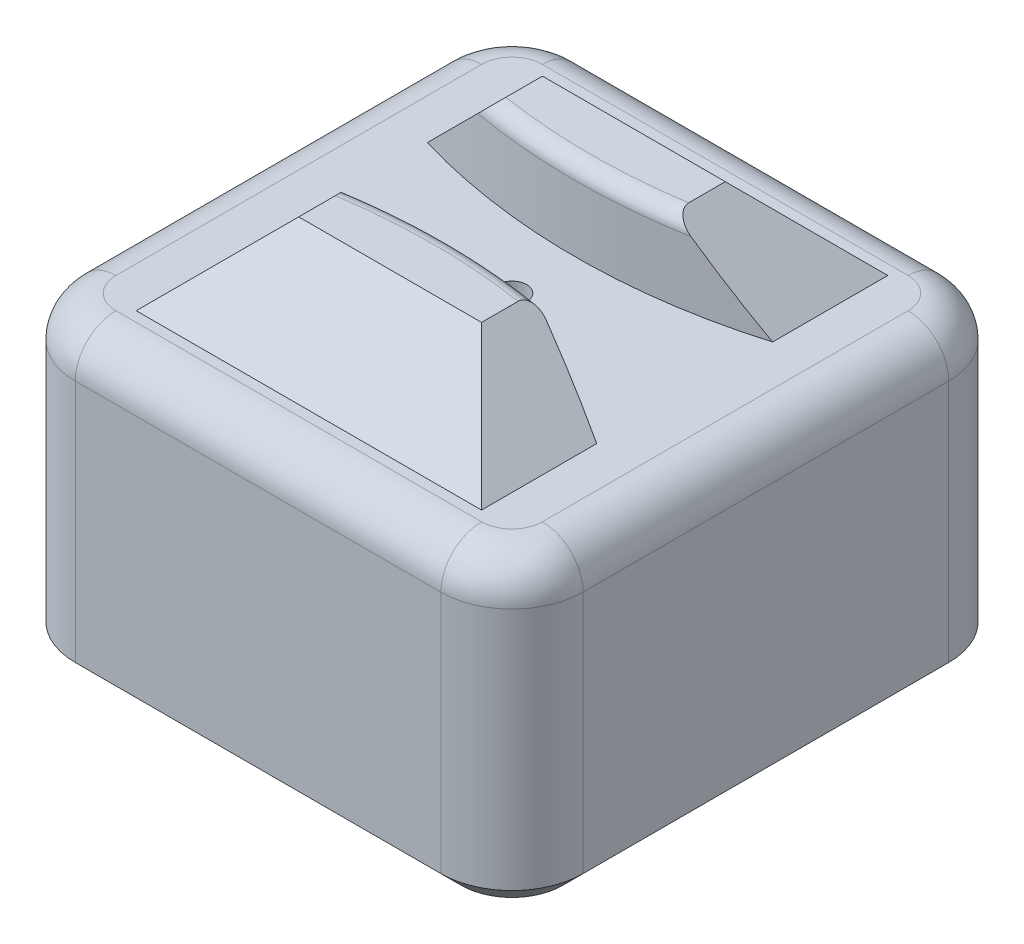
ISO-10303-21;
HEADER;
FILE_DESCRIPTION(('STEP AP214'),'2;1');
FILE_NAME('part.step','',(''),(''),'','','');
FILE_SCHEMA(('AUTOMOTIVE_DESIGN { 1 0 10303 214 1 1 1 1 }'));
ENDSEC;
DATA;
#1=APPLICATION_CONTEXT('core data for automotive mechanical design processes');
#2=APPLICATION_PROTOCOL_DEFINITION('international standard','automotive_design',2000,#1);
#3=PRODUCT_CONTEXT('',#1,'mechanical');
#4=PRODUCT('Part','Part','',(#3));
#5=PRODUCT_RELATED_PRODUCT_CATEGORY('part','',(#4));
#6=PRODUCT_DEFINITION_FORMATION('','',#4);
#7=PRODUCT_DEFINITION_CONTEXT('part definition',#1,'design');
#8=PRODUCT_DEFINITION('design','',#6,#7);
#9=PRODUCT_DEFINITION_SHAPE('','',#8);
#10=(LENGTH_UNIT() NAMED_UNIT(*) SI_UNIT(.MILLI.,.METRE.));
#11=(NAMED_UNIT(*) PLANE_ANGLE_UNIT() SI_UNIT($,.RADIAN.));
#12=(NAMED_UNIT(*) SI_UNIT($,.STERADIAN.) SOLID_ANGLE_UNIT());
#13=UNCERTAINTY_MEASURE_WITH_UNIT(LENGTH_MEASURE(1.E-05),#10,'distance_accuracy_value','');
#14=(GEOMETRIC_REPRESENTATION_CONTEXT(3) GLOBAL_UNCERTAINTY_ASSIGNED_CONTEXT((#13)) GLOBAL_UNIT_ASSIGNED_CONTEXT((#10,
#11,#12)) REPRESENTATION_CONTEXT('',''));
#15=CARTESIAN_POINT('',(0.,0.,0.));
#16=DIRECTION('',(0.,0.,1.));
#17=DIRECTION('',(1.,0.,0.));
#18=AXIS2_PLACEMENT_3D('',#15,#16,#17);
#19=CARTESIAN_POINT('',(0.,10.,0.));
#20=DIRECTION('',(0.,1.,0.));
#21=DIRECTION('',(0.,0.,1.));
#22=AXIS2_PLACEMENT_3D('',#19,#20,#21);
#23=PLANE('',#22);
#24=DIRECTION('',(-1.,0.,0.));
#25=VECTOR('',#24,1.);
#26=CARTESIAN_POINT('',(0.,10.,-21.));
#27=LINE('',#26,#25);
#28=CARTESIAN_POINT('',(18.,10.,-21.));
#29=VERTEX_POINT('',#28);
#30=CARTESIAN_POINT('',(-18.,10.,-21.));
#31=VERTEX_POINT('',#30);
#32=EDGE_CURVE('E1614',#29,#31,#27,.T.);
#33=ORIENTED_EDGE('',*,*,#32,.T.);
#34=CARTESIAN_POINT('',(-18.,10.,-18.));
#35=DIRECTION('',(0.,1.,0.));
#36=DIRECTION('',(0.,0.,1.));
#37=AXIS2_PLACEMENT_3D('',#34,#35,#36);
#38=CIRCLE('',#37,3.);
#39=CARTESIAN_POINT('',(-21.,10.,-18.));
#40=VERTEX_POINT('',#39);
#41=EDGE_CURVE('E1616',#31,#40,#38,.T.);
#42=ORIENTED_EDGE('',*,*,#41,.T.);
#43=DIRECTION('',(0.,0.,1.));
#44=VECTOR('',#43,1.);
#45=CARTESIAN_POINT('',(-21.,10.,0.));
#46=LINE('',#45,#44);
#47=CARTESIAN_POINT('',(-21.,10.,18.));
#48=VERTEX_POINT('',#47);
#49=EDGE_CURVE('E1487',#40,#48,#46,.T.);
#50=ORIENTED_EDGE('',*,*,#49,.T.);
#51=CARTESIAN_POINT('',(-18.,10.,18.));
#52=DIRECTION('',(0.,1.,0.));
#53=DIRECTION('',(0.,0.,1.));
#54=AXIS2_PLACEMENT_3D('',#51,#52,#53);
#55=CIRCLE('',#54,3.);
#56=CARTESIAN_POINT('',(-18.,10.,21.));
#57=VERTEX_POINT('',#56);
#58=EDGE_CURVE('E1605',#48,#57,#55,.T.);
#59=ORIENTED_EDGE('',*,*,#58,.T.);
#60=DIRECTION('',(1.,0.,0.));
#61=VECTOR('',#60,1.);
#62=CARTESIAN_POINT('',(0.,10.,21.));
#63=LINE('',#62,#61);
#64=CARTESIAN_POINT('',(18.,10.,21.));
#65=VERTEX_POINT('',#64);
#66=EDGE_CURVE('E1607',#57,#65,#63,.T.);
#67=ORIENTED_EDGE('',*,*,#66,.T.);
#68=CARTESIAN_POINT('',(18.,10.,18.));
#69=DIRECTION('',(0.,1.,0.));
#70=DIRECTION('',(0.,0.,1.));
#71=AXIS2_PLACEMENT_3D('',#68,#69,#70);
#72=CIRCLE('',#71,3.);
#73=CARTESIAN_POINT('',(21.,10.,18.));
#74=VERTEX_POINT('',#73);
#75=EDGE_CURVE('E993',#65,#74,#72,.T.);
#76=ORIENTED_EDGE('',*,*,#75,.T.);
#77=DIRECTION('',(0.,0.,-1.));
#78=VECTOR('',#77,1.);
#79=CARTESIAN_POINT('',(21.,10.,0.));
#80=LINE('',#79,#78);
#81=CARTESIAN_POINT('',(21.,10.,-18.));
#82=VERTEX_POINT('',#81);
#83=EDGE_CURVE('E1610',#74,#82,#80,.T.);
#84=ORIENTED_EDGE('',*,*,#83,.T.);
#85=CARTESIAN_POINT('',(18.,10.,-18.));
#86=DIRECTION('',(0.,1.,0.));
#87=DIRECTION('',(0.,0.,1.));
#88=AXIS2_PLACEMENT_3D('',#85,#86,#87);
#89=CIRCLE('',#88,3.);
#90=EDGE_CURVE('E1612',#82,#29,#89,.T.);
#91=ORIENTED_EDGE('',*,*,#90,.T.);
#92=EDGE_LOOP('',(#33,#42,#50,#59,#67,#76,#84,#91));
#93=FACE_BOUND('',#92,.T.);
#94=CARTESIAN_POINT('',(0.,10.,0.));
#95=DIRECTION('',(0.,1.,0.));
#96=DIRECTION('',(0.,0.,1.));
#97=AXIS2_PLACEMENT_3D('',#94,#95,#96);
#98=CIRCLE('',#97,1.45);
#99=CARTESIAN_POINT('',(0.,10.,1.45));
#100=VERTEX_POINT('',#99);
#101=EDGE_CURVE('E1145',#100,#100,#98,.T.);
#102=ORIENTED_EDGE('',*,*,#101,.F.);
#103=EDGE_LOOP('',(#102));
#104=FACE_BOUND('',#103,.T.);
#105=DIRECTION('',(0.,0.,1.));
#106=VECTOR('',#105,1.);
#107=CARTESIAN_POINT('',(-17.,10.,8.65871047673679));
#108=LINE('',#107,#106);
#109=CARTESIAN_POINT('',(-17.,10.,8.65871047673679));
#110=VERTEX_POINT('',#109);
#111=CARTESIAN_POINT('',(-17.,10.,20.));
#112=VERTEX_POINT('',#111);
#113=EDGE_CURVE('E1044',#110,#112,#108,.T.);
#114=ORIENTED_EDGE('',*,*,#113,.F.);
#115=CARTESIAN_POINT('',(0.,10.,66.2));
#116=DIRECTION('',(0.,1.,0.));
#117=DIRECTION('',(0.,0.,-1.));
#118=AXIS2_PLACEMENT_3D('',#115,#116,#117);
#119=CIRCLE('',#118,60.);
#120=CARTESIAN_POINT('',(17.,10.,8.65871047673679));
#121=VERTEX_POINT('',#120);
#122=EDGE_CURVE('E1042',#121,#110,#119,.T.);
#123=ORIENTED_EDGE('',*,*,#122,.F.);
#124=DIRECTION('',(0.,0.,-1.));
#125=VECTOR('',#124,1.);
#126=CARTESIAN_POINT('',(17.,10.,20.));
#127=LINE('',#126,#125);
#128=CARTESIAN_POINT('',(17.,10.,20.));
#129=VERTEX_POINT('',#128);
#130=EDGE_CURVE('E1018',#129,#121,#127,.T.);
#131=ORIENTED_EDGE('',*,*,#130,.F.);
#132=DIRECTION('',(1.,0.,0.));
#133=VECTOR('',#132,1.);
#134=CARTESIAN_POINT('',(-17.,10.,20.));
#135=LINE('',#134,#133);
#136=EDGE_CURVE('E1050',#112,#129,#135,.T.);
#137=ORIENTED_EDGE('',*,*,#136,.F.);
#138=EDGE_LOOP('',(#114,#123,#131,#137));
#139=FACE_BOUND('',#138,.T.);
#140=DIRECTION('',(0.,0.,-1.));
#141=VECTOR('',#140,1.);
#142=CARTESIAN_POINT('',(17.,10.,-20.));
#143=LINE('',#142,#141);
#144=CARTESIAN_POINT('',(17.,10.,-8.65871047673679));
#145=VERTEX_POINT('',#144);
#146=CARTESIAN_POINT('',(17.,10.,-20.));
#147=VERTEX_POINT('',#146);
#148=EDGE_CURVE('E558',#145,#147,#143,.T.);
#149=ORIENTED_EDGE('',*,*,#148,.F.);
#150=CARTESIAN_POINT('',(0.,10.,-66.2));
#151=DIRECTION('',(0.,1.,0.));
#152=DIRECTION('',(0.,0.,1.));
#153=AXIS2_PLACEMENT_3D('',#150,#151,#152);
#154=CIRCLE('',#153,60.);
#155=CARTESIAN_POINT('',(-17.,10.,-8.65871047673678));
#156=VERTEX_POINT('',#155);
#157=EDGE_CURVE('E548',#156,#145,#154,.T.);
#158=ORIENTED_EDGE('',*,*,#157,.F.);
#159=DIRECTION('',(0.,0.,1.));
#160=VECTOR('',#159,1.);
#161=CARTESIAN_POINT('',(-17.,10.,-8.65871047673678));
#162=LINE('',#161,#160);
#163=CARTESIAN_POINT('',(-17.,10.,-20.));
#164=VERTEX_POINT('',#163);
#165=EDGE_CURVE('E1040',#164,#156,#162,.T.);
#166=ORIENTED_EDGE('',*,*,#165,.F.);
#167=DIRECTION('',(-1.,0.,0.));
#168=VECTOR('',#167,1.);
#169=CARTESIAN_POINT('',(-17.,10.,-20.));
#170=LINE('',#169,#168);
#171=EDGE_CURVE('E563',#147,#164,#170,.T.);
#172=ORIENTED_EDGE('',*,*,#171,.F.);
#173=EDGE_LOOP('',(#149,#158,#166,#172));
#174=FACE_BOUND('',#173,.T.);
#175=ADVANCED_FACE('F35',(#93,#104,#139,#174),#23,.T.);
#176=CARTESIAN_POINT('',(0.,-20.,0.));
#177=DIRECTION('',(0.,1.,0.));
#178=DIRECTION('',(0.,0.,1.));
#179=AXIS2_PLACEMENT_3D('',#176,#177,#178);
#180=CYLINDRICAL_SURFACE('',#179,1.45);
#181=ORIENTED_EDGE('',*,*,#101,.T.);
#182=EDGE_LOOP('',(#181));
#183=FACE_BOUND('',#182,.T.);
#184=CARTESIAN_POINT('',(0.,0.,0.));
#185=DIRECTION('',(0.,-1.,0.));
#186=DIRECTION('',(0.,0.,-1.));
#187=AXIS2_PLACEMENT_3D('',#184,#185,#186);
#188=CIRCLE('',#187,1.45);
#189=CARTESIAN_POINT('',(0.,0.,-1.45));
#190=VERTEX_POINT('',#189);
#191=EDGE_CURVE('E1131',#190,#190,#188,.F.);
#192=ORIENTED_EDGE('',*,*,#191,.F.);
#193=EDGE_LOOP('',(#192));
#194=FACE_BOUND('',#193,.T.);
#195=ADVANCED_FACE('F644',(#183,#194),#180,.F.);
#196=CARTESIAN_POINT('',(-25.,-20.,-25.));
#197=DIRECTION('',(0.,0.,-1.));
#198=DIRECTION('',(-1.,0.,0.));
#199=AXIS2_PLACEMENT_3D('',#196,#197,#198);
#200=PLANE('',#199);
#201=DIRECTION('',(0.,1.,0.));
#202=VECTOR('',#201,1.);
#203=CARTESIAN_POINT('',(-18.,-20.,-25.));
#204=LINE('',#203,#202);
#205=CARTESIAN_POINT('',(-18.,-18.,-25.));
#206=VERTEX_POINT('',#205);
#207=CARTESIAN_POINT('',(-18.,6.,-25.));
#208=VERTEX_POINT('',#207);
#209=EDGE_CURVE('E1155',#206,#208,#204,.T.);
#210=ORIENTED_EDGE('',*,*,#209,.T.);
#211=DIRECTION('',(-1.,0.,0.));
#212=VECTOR('',#211,1.);
#213=CARTESIAN_POINT('',(-25.,6.,-25.));
#214=LINE('',#213,#212);
#215=CARTESIAN_POINT('',(18.,6.,-25.));
#216=VERTEX_POINT('',#215);
#217=EDGE_CURVE('E1622',#208,#216,#214,.F.);
#218=ORIENTED_EDGE('',*,*,#217,.T.);
#219=DIRECTION('',(0.,1.,0.));
#220=VECTOR('',#219,1.);
#221=CARTESIAN_POINT('',(18.,-20.,-25.));
#222=LINE('',#221,#220);
#223=CARTESIAN_POINT('',(18.,-18.,-25.));
#224=VERTEX_POINT('',#223);
#225=EDGE_CURVE('E1158',#216,#224,#222,.F.);
#226=ORIENTED_EDGE('',*,*,#225,.T.);
#227=DIRECTION('',(-1.,0.,0.));
#228=VECTOR('',#227,1.);
#229=CARTESIAN_POINT('',(-18.,-18.,-25.));
#230=LINE('',#229,#228);
#231=EDGE_CURVE('E1309',#224,#206,#230,.T.);
#232=ORIENTED_EDGE('',*,*,#231,.T.);
#233=EDGE_LOOP('',(#210,#218,#226,#232));
#234=FACE_BOUND('',#233,.T.);
#235=ADVANCED_FACE('F650',(#234),#200,.T.);
#236=CARTESIAN_POINT('',(25.,-20.,25.));
#237=DIRECTION('',(1.,0.,0.));
#238=DIRECTION('',(0.,0.,-1.));
#239=AXIS2_PLACEMENT_3D('',#236,#237,#238);
#240=PLANE('',#239);
#241=DIRECTION('',(0.,1.,0.));
#242=VECTOR('',#241,1.);
#243=CARTESIAN_POINT('',(25.,-20.,-18.));
#244=LINE('',#243,#242);
#245=CARTESIAN_POINT('',(25.,-18.,-18.));
#246=VERTEX_POINT('',#245);
#247=CARTESIAN_POINT('',(25.,6.,-18.));
#248=VERTEX_POINT('',#247);
#249=EDGE_CURVE('E1152',#246,#248,#244,.T.);
#250=ORIENTED_EDGE('',*,*,#249,.T.);
#251=DIRECTION('',(0.,0.,-1.));
#252=VECTOR('',#251,1.);
#253=CARTESIAN_POINT('',(25.,6.,25.));
#254=LINE('',#253,#252);
#255=CARTESIAN_POINT('',(25.,6.,18.));
#256=VERTEX_POINT('',#255);
#257=EDGE_CURVE('E1009',#248,#256,#254,.F.);
#258=ORIENTED_EDGE('',*,*,#257,.T.);
#259=DIRECTION('',(0.,1.,0.));
#260=VECTOR('',#259,1.);
#261=CARTESIAN_POINT('',(25.,-20.,18.));
#262=LINE('',#261,#260);
#263=CARTESIAN_POINT('',(25.,-18.,18.));
#264=VERTEX_POINT('',#263);
#265=EDGE_CURVE('E1148',#256,#264,#262,.F.);
#266=ORIENTED_EDGE('',*,*,#265,.T.);
#267=DIRECTION('',(0.,0.,-1.));
#268=VECTOR('',#267,1.);
#269=CARTESIAN_POINT('',(25.,-18.,-18.));
#270=LINE('',#269,#268);
#271=EDGE_CURVE('E1317',#264,#246,#270,.T.);
#272=ORIENTED_EDGE('',*,*,#271,.T.);
#273=EDGE_LOOP('',(#250,#258,#266,#272));
#274=FACE_BOUND('',#273,.T.);
#275=ADVANCED_FACE('F664',(#274),#240,.T.);
#276=CARTESIAN_POINT('',(-25.,-20.,25.));
#277=DIRECTION('',(0.,0.,1.));
#278=DIRECTION('',(1.,0.,0.));
#279=AXIS2_PLACEMENT_3D('',#276,#277,#278);
#280=PLANE('',#279);
#281=DIRECTION('',(0.,1.,0.));
#282=VECTOR('',#281,1.);
#283=CARTESIAN_POINT('',(18.,-20.,25.));
#284=LINE('',#283,#282);
#285=CARTESIAN_POINT('',(18.,-18.,25.));
#286=VERTEX_POINT('',#285);
#287=CARTESIAN_POINT('',(18.,6.,25.));
#288=VERTEX_POINT('',#287);
#289=EDGE_CURVE('E1165',#286,#288,#284,.T.);
#290=ORIENTED_EDGE('',*,*,#289,.T.);
#291=DIRECTION('',(1.,0.,0.));
#292=VECTOR('',#291,1.);
#293=CARTESIAN_POINT('',(-25.,6.,25.));
#294=LINE('',#293,#292);
#295=CARTESIAN_POINT('',(-18.,6.,25.));
#296=VERTEX_POINT('',#295);
#297=EDGE_CURVE('E999',#288,#296,#294,.F.);
#298=ORIENTED_EDGE('',*,*,#297,.T.);
#299=DIRECTION('',(0.,1.,0.));
#300=VECTOR('',#299,1.);
#301=CARTESIAN_POINT('',(-18.,-20.,25.));
#302=LINE('',#301,#300);
#303=CARTESIAN_POINT('',(-18.,-18.,25.));
#304=VERTEX_POINT('',#303);
#305=EDGE_CURVE('E1167',#296,#304,#302,.F.);
#306=ORIENTED_EDGE('',*,*,#305,.T.);
#307=DIRECTION('',(1.,0.,0.));
#308=VECTOR('',#307,1.);
#309=CARTESIAN_POINT('',(18.,-18.,25.));
#310=LINE('',#309,#308);
#311=EDGE_CURVE('E1307',#304,#286,#310,.T.);
#312=ORIENTED_EDGE('',*,*,#311,.T.);
#313=EDGE_LOOP('',(#290,#298,#306,#312));
#314=FACE_BOUND('',#313,.T.);
#315=ADVANCED_FACE('F667',(#314),#280,.T.);
#316=CARTESIAN_POINT('',(-25.,-20.,25.));
#317=DIRECTION('',(-1.,0.,0.));
#318=DIRECTION('',(0.,0.,1.));
#319=AXIS2_PLACEMENT_3D('',#316,#317,#318);
#320=PLANE('',#319);
#321=DIRECTION('',(0.,1.,0.));
#322=VECTOR('',#321,1.);
#323=CARTESIAN_POINT('',(-25.,-20.,18.));
#324=LINE('',#323,#322);
#325=CARTESIAN_POINT('',(-25.,-18.,18.));
#326=VERTEX_POINT('',#325);
#327=CARTESIAN_POINT('',(-25.,6.,18.));
#328=VERTEX_POINT('',#327);
#329=EDGE_CURVE('E1160',#326,#328,#324,.T.);
#330=ORIENTED_EDGE('',*,*,#329,.T.);
#331=DIRECTION('',(0.,0.,1.));
#332=VECTOR('',#331,1.);
#333=CARTESIAN_POINT('',(-25.,6.,25.));
#334=LINE('',#333,#332);
#335=CARTESIAN_POINT('',(-25.,6.,-18.));
#336=VERTEX_POINT('',#335);
#337=EDGE_CURVE('E1007',#328,#336,#334,.F.);
#338=ORIENTED_EDGE('',*,*,#337,.T.);
#339=DIRECTION('',(0.,1.,0.));
#340=VECTOR('',#339,1.);
#341=CARTESIAN_POINT('',(-25.,-20.,-18.));
#342=LINE('',#341,#340);
#343=CARTESIAN_POINT('',(-25.,-18.,-18.));
#344=VERTEX_POINT('',#343);
#345=EDGE_CURVE('E1163',#336,#344,#342,.F.);
#346=ORIENTED_EDGE('',*,*,#345,.T.);
#347=DIRECTION('',(0.,0.,1.));
#348=VECTOR('',#347,1.);
#349=CARTESIAN_POINT('',(-25.,-18.,18.));
#350=LINE('',#349,#348);
#351=EDGE_CURVE('E1281',#344,#326,#350,.T.);
#352=ORIENTED_EDGE('',*,*,#351,.T.);
#353=EDGE_LOOP('',(#330,#338,#346,#352));
#354=FACE_BOUND('',#353,.T.);
#355=ADVANCED_FACE('F662',(#354),#320,.T.);
#356=CARTESIAN_POINT('',(0.,-20.,0.));
#357=DIRECTION('',(0.,1.,0.));
#358=DIRECTION('',(0.,0.,1.));
#359=AXIS2_PLACEMENT_3D('',#356,#357,#358);
#360=PLANE('',#359);
#361=CARTESIAN_POINT('',(-18.9999999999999,-20.,5.05));
#362=DIRECTION('',(0.,1.,0.));
#363=DIRECTION('',(0.,0.,1.));
#364=AXIS2_PLACEMENT_3D('',#361,#362,#363);
#365=CIRCLE('',#364,2.);
#366=CARTESIAN_POINT('',(-18.9999999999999,-20.,3.05));
#367=VERTEX_POINT('',#366);
#368=CARTESIAN_POINT('',(-21.,-20.,5.05));
#369=VERTEX_POINT('',#368);
#370=EDGE_CURVE('E1399',#367,#369,#365,.T.);
#371=ORIENTED_EDGE('',*,*,#370,.T.);
#372=DIRECTION('',(0.,0.,1.));
#373=VECTOR('',#372,1.);
#374=CARTESIAN_POINT('',(-21.,-20.,0.));
#375=LINE('',#374,#373);
#376=CARTESIAN_POINT('',(-21.,-20.,16.));
#377=VERTEX_POINT('',#376);
#378=EDGE_CURVE('E1403',#369,#377,#375,.T.);
#379=ORIENTED_EDGE('',*,*,#378,.T.);
#380=CARTESIAN_POINT('',(-16.,-20.,16.));
#381=DIRECTION('',(0.,1.,0.));
#382=DIRECTION('',(0.,0.,1.));
#383=AXIS2_PLACEMENT_3D('',#380,#381,#382);
#384=CIRCLE('',#383,4.99999999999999);
#385=CARTESIAN_POINT('',(-16.,-20.,21.));
#386=VERTEX_POINT('',#385);
#387=EDGE_CURVE('E1401',#377,#386,#384,.T.);
#388=ORIENTED_EDGE('',*,*,#387,.T.);
#389=DIRECTION('',(1.,0.,0.));
#390=VECTOR('',#389,1.);
#391=CARTESIAN_POINT('',(0.,-20.,21.));
#392=LINE('',#391,#390);
#393=CARTESIAN_POINT('',(-5.04999999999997,-20.,21.));
#394=VERTEX_POINT('',#393);
#395=EDGE_CURVE('E1397',#386,#394,#392,.T.);
#396=ORIENTED_EDGE('',*,*,#395,.T.);
#397=CARTESIAN_POINT('',(-5.04999999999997,-20.,19.));
#398=DIRECTION('',(0.,1.,0.));
#399=DIRECTION('',(0.,0.,1.));
#400=AXIS2_PLACEMENT_3D('',#397,#398,#399);
#401=CIRCLE('',#400,2.);
#402=CARTESIAN_POINT('',(-3.04999999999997,-20.,19.));
#403=VERTEX_POINT('',#402);
#404=EDGE_CURVE('E1393',#394,#403,#401,.T.);
#405=ORIENTED_EDGE('',*,*,#404,.T.);
#406=DIRECTION('',(0.,0.,-1.));
#407=VECTOR('',#406,1.);
#408=CARTESIAN_POINT('',(-3.04999999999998,-20.,0.));
#409=LINE('',#408,#407);
#410=CARTESIAN_POINT('',(-3.04999999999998,-20.,16.));
#411=VERTEX_POINT('',#410);
#412=EDGE_CURVE('E1391',#403,#411,#409,.T.);
#413=ORIENTED_EDGE('',*,*,#412,.T.);
#414=DIRECTION('',(1.,0.,0.));
#415=VECTOR('',#414,1.);
#416=CARTESIAN_POINT('',(0.,-20.,16.));
#417=LINE('',#416,#415);
#418=CARTESIAN_POINT('',(3.05000000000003,-20.,16.));
#419=VERTEX_POINT('',#418);
#420=EDGE_CURVE('E1387',#411,#419,#417,.T.);
#421=ORIENTED_EDGE('',*,*,#420,.T.);
#422=DIRECTION('',(0.,0.,1.));
#423=VECTOR('',#422,1.);
#424=CARTESIAN_POINT('',(3.05000000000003,-20.,0.));
#425=LINE('',#424,#423);
#426=CARTESIAN_POINT('',(3.05000000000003,-20.,19.));
#427=VERTEX_POINT('',#426);
#428=EDGE_CURVE('E1381',#419,#427,#425,.T.);
#429=ORIENTED_EDGE('',*,*,#428,.T.);
#430=CARTESIAN_POINT('',(5.05000000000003,-20.,19.));
#431=DIRECTION('',(0.,1.,0.));
#432=DIRECTION('',(0.,0.,1.));
#433=AXIS2_PLACEMENT_3D('',#430,#431,#432);
#434=CIRCLE('',#433,2.);
#435=CARTESIAN_POINT('',(5.05000000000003,-20.,21.));
#436=VERTEX_POINT('',#435);
#437=EDGE_CURVE('E1377',#427,#436,#434,.T.);
#438=ORIENTED_EDGE('',*,*,#437,.T.);
#439=DIRECTION('',(1.,0.,0.));
#440=VECTOR('',#439,1.);
#441=CARTESIAN_POINT('',(0.,-20.,21.));
#442=LINE('',#441,#440);
#443=CARTESIAN_POINT('',(16.,-20.,21.));
#444=VERTEX_POINT('',#443);
#445=EDGE_CURVE('E1373',#436,#444,#442,.T.);
#446=ORIENTED_EDGE('',*,*,#445,.T.);
#447=CARTESIAN_POINT('',(16.,-20.,16.));
#448=DIRECTION('',(0.,1.,0.));
#449=DIRECTION('',(0.,0.,1.));
#450=AXIS2_PLACEMENT_3D('',#447,#448,#449);
#451=CIRCLE('',#450,5.);
#452=CARTESIAN_POINT('',(21.,-20.,16.));
#453=VERTEX_POINT('',#452);
#454=EDGE_CURVE('E1369',#444,#453,#451,.T.);
#455=ORIENTED_EDGE('',*,*,#454,.T.);
#456=DIRECTION('',(0.,0.,-1.));
#457=VECTOR('',#456,1.);
#458=CARTESIAN_POINT('',(21.,-20.,0.));
#459=LINE('',#458,#457);
#460=CARTESIAN_POINT('',(21.,-20.,5.05));
#461=VERTEX_POINT('',#460);
#462=EDGE_CURVE('E1365',#453,#461,#459,.T.);
#463=ORIENTED_EDGE('',*,*,#462,.T.);
#464=CARTESIAN_POINT('',(19.,-20.,5.05));
#465=DIRECTION('',(0.,1.,0.));
#466=DIRECTION('',(0.,0.,1.));
#467=AXIS2_PLACEMENT_3D('',#464,#465,#466);
#468=CIRCLE('',#467,2.);
#469=CARTESIAN_POINT('',(19.,-20.,3.04999999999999));
#470=VERTEX_POINT('',#469);
#471=EDGE_CURVE('E1361',#461,#470,#468,.T.);
#472=ORIENTED_EDGE('',*,*,#471,.T.);
#473=DIRECTION('',(-1.,0.,0.));
#474=VECTOR('',#473,1.);
#475=CARTESIAN_POINT('',(0.,-20.,3.04999999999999));
#476=LINE('',#475,#474);
#477=CARTESIAN_POINT('',(16.,-20.,3.05));
#478=VERTEX_POINT('',#477);
#479=EDGE_CURVE('E1359',#470,#478,#476,.T.);
#480=ORIENTED_EDGE('',*,*,#479,.T.);
#481=DIRECTION('',(0.,0.,-1.));
#482=VECTOR('',#481,1.);
#483=CARTESIAN_POINT('',(16.,-20.,0.));
#484=LINE('',#483,#482);
#485=CARTESIAN_POINT('',(16.,-20.,-3.04999999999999));
#486=VERTEX_POINT('',#485);
#487=EDGE_CURVE('E1355',#478,#486,#484,.T.);
#488=ORIENTED_EDGE('',*,*,#487,.T.);
#489=DIRECTION('',(1.,0.,0.));
#490=VECTOR('',#489,1.);
#491=CARTESIAN_POINT('',(0.,-20.,-3.04999999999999));
#492=LINE('',#491,#490);
#493=CARTESIAN_POINT('',(19.,-20.,-3.04999999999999));
#494=VERTEX_POINT('',#493);
#495=EDGE_CURVE('E1349',#486,#494,#492,.T.);
#496=ORIENTED_EDGE('',*,*,#495,.T.);
#497=CARTESIAN_POINT('',(19.,-20.,-5.05));
#498=DIRECTION('',(0.,1.,0.));
#499=DIRECTION('',(0.,0.,1.));
#500=AXIS2_PLACEMENT_3D('',#497,#498,#499);
#501=CIRCLE('',#500,2.);
#502=CARTESIAN_POINT('',(21.,-20.,-5.05));
#503=VERTEX_POINT('',#502);
#504=EDGE_CURVE('E1345',#494,#503,#501,.T.);
#505=ORIENTED_EDGE('',*,*,#504,.T.);
#506=DIRECTION('',(0.,0.,-1.));
#507=VECTOR('',#506,1.);
#508=CARTESIAN_POINT('',(21.,-20.,0.));
#509=LINE('',#508,#507);
#510=CARTESIAN_POINT('',(21.,-20.,-16.));
#511=VERTEX_POINT('',#510);
#512=EDGE_CURVE('E1319',#503,#511,#509,.T.);
#513=ORIENTED_EDGE('',*,*,#512,.T.);
#514=CARTESIAN_POINT('',(16.,-20.,-16.));
#515=DIRECTION('',(0.,1.,0.));
#516=DIRECTION('',(0.,0.,1.));
#517=AXIS2_PLACEMENT_3D('',#514,#515,#516);
#518=CIRCLE('',#517,5.);
#519=CARTESIAN_POINT('',(16.,-20.,-21.));
#520=VERTEX_POINT('',#519);
#521=EDGE_CURVE('E1343',#511,#520,#518,.T.);
#522=ORIENTED_EDGE('',*,*,#521,.T.);
#523=DIRECTION('',(-1.,0.,0.));
#524=VECTOR('',#523,1.);
#525=CARTESIAN_POINT('',(0.,-20.,-21.));
#526=LINE('',#525,#524);
#527=CARTESIAN_POINT('',(5.05,-20.,-21.));
#528=VERTEX_POINT('',#527);
#529=EDGE_CURVE('E1347',#520,#528,#526,.T.);
#530=ORIENTED_EDGE('',*,*,#529,.T.);
#531=CARTESIAN_POINT('',(5.05,-20.,-19.));
#532=DIRECTION('',(0.,1.,0.));
#533=DIRECTION('',(0.,0.,1.));
#534=AXIS2_PLACEMENT_3D('',#531,#532,#533);
#535=CIRCLE('',#534,2.);
#536=CARTESIAN_POINT('',(3.05,-20.,-19.));
#537=VERTEX_POINT('',#536);
#538=EDGE_CURVE('E1351',#528,#537,#535,.T.);
#539=ORIENTED_EDGE('',*,*,#538,.T.);
#540=DIRECTION('',(0.,0.,1.));
#541=VECTOR('',#540,1.);
#542=CARTESIAN_POINT('',(3.05000000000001,-20.,0.));
#543=LINE('',#542,#541);
#544=CARTESIAN_POINT('',(3.05,-20.,-16.));
#545=VERTEX_POINT('',#544);
#546=EDGE_CURVE('E1353',#537,#545,#543,.T.);
#547=ORIENTED_EDGE('',*,*,#546,.T.);
#548=DIRECTION('',(-1.,0.,0.));
#549=VECTOR('',#548,1.);
#550=CARTESIAN_POINT('',(0.,-20.,-16.));
#551=LINE('',#550,#549);
#552=CARTESIAN_POINT('',(-3.05,-20.,-16.));
#553=VERTEX_POINT('',#552);
#554=EDGE_CURVE('E1357',#545,#553,#551,.T.);
#555=ORIENTED_EDGE('',*,*,#554,.T.);
#556=DIRECTION('',(0.,0.,-1.));
#557=VECTOR('',#556,1.);
#558=CARTESIAN_POINT('',(-3.05000000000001,-20.,0.));
#559=LINE('',#558,#557);
#560=CARTESIAN_POINT('',(-3.05,-20.,-19.));
#561=VERTEX_POINT('',#560);
#562=EDGE_CURVE('E1363',#553,#561,#559,.T.);
#563=ORIENTED_EDGE('',*,*,#562,.T.);
#564=CARTESIAN_POINT('',(-5.05,-20.,-19.));
#565=DIRECTION('',(0.,1.,0.));
#566=DIRECTION('',(0.,0.,1.));
#567=AXIS2_PLACEMENT_3D('',#564,#565,#566);
#568=CIRCLE('',#567,2.);
#569=CARTESIAN_POINT('',(-5.05,-20.,-21.));
#570=VERTEX_POINT('',#569);
#571=EDGE_CURVE('E1367',#561,#570,#568,.T.);
#572=ORIENTED_EDGE('',*,*,#571,.T.);
#573=DIRECTION('',(-1.,0.,0.));
#574=VECTOR('',#573,1.);
#575=CARTESIAN_POINT('',(0.,-20.,-21.));
#576=LINE('',#575,#574);
#577=CARTESIAN_POINT('',(-16.,-20.,-21.));
#578=VERTEX_POINT('',#577);
#579=EDGE_CURVE('E1371',#570,#578,#576,.T.);
#580=ORIENTED_EDGE('',*,*,#579,.T.);
#581=CARTESIAN_POINT('',(-16.,-20.,-16.));
#582=DIRECTION('',(0.,1.,0.));
#583=DIRECTION('',(0.,0.,1.));
#584=AXIS2_PLACEMENT_3D('',#581,#582,#583);
#585=CIRCLE('',#584,5.);
#586=CARTESIAN_POINT('',(-21.,-20.,-16.));
#587=VERTEX_POINT('',#586);
#588=EDGE_CURVE('E1375',#578,#587,#585,.T.);
#589=ORIENTED_EDGE('',*,*,#588,.T.);
#590=DIRECTION('',(0.,0.,1.));
#591=VECTOR('',#590,1.);
#592=CARTESIAN_POINT('',(-21.,-20.,0.));
#593=LINE('',#592,#591);
#594=CARTESIAN_POINT('',(-21.,-20.,-5.05));
#595=VERTEX_POINT('',#594);
#596=EDGE_CURVE('E1379',#587,#595,#593,.T.);
#597=ORIENTED_EDGE('',*,*,#596,.T.);
#598=CARTESIAN_POINT('',(-19.,-20.,-5.05));
#599=DIRECTION('',(0.,1.,0.));
#600=DIRECTION('',(0.,0.,1.));
#601=AXIS2_PLACEMENT_3D('',#598,#599,#600);
#602=CIRCLE('',#601,2.);
#603=CARTESIAN_POINT('',(-19.,-20.,-3.04999999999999));
#604=VERTEX_POINT('',#603);
#605=EDGE_CURVE('E1383',#595,#604,#602,.T.);
#606=ORIENTED_EDGE('',*,*,#605,.T.);
#607=DIRECTION('',(1.,0.,0.));
#608=VECTOR('',#607,1.);
#609=CARTESIAN_POINT('',(0.,-20.,-3.04999999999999));
#610=LINE('',#609,#608);
#611=CARTESIAN_POINT('',(-16.,-20.,-3.04999999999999));
#612=VERTEX_POINT('',#611);
#613=EDGE_CURVE('E1385',#604,#612,#610,.T.);
#614=ORIENTED_EDGE('',*,*,#613,.T.);
#615=DIRECTION('',(0.,0.,1.));
#616=VECTOR('',#615,1.);
#617=CARTESIAN_POINT('',(-16.,-20.,0.));
#618=LINE('',#617,#616);
#619=CARTESIAN_POINT('',(-16.,-20.,3.05));
#620=VERTEX_POINT('',#619);
#621=EDGE_CURVE('E1389',#612,#620,#618,.T.);
#622=ORIENTED_EDGE('',*,*,#621,.T.);
#623=DIRECTION('',(-1.,0.,0.));
#624=VECTOR('',#623,1.);
#625=CARTESIAN_POINT('',(0.,-20.,3.04999999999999));
#626=LINE('',#625,#624);
#627=EDGE_CURVE('E1395',#620,#367,#626,.T.);
#628=ORIENTED_EDGE('',*,*,#627,.T.);
#629=EDGE_LOOP('',(#371,#379,#388,#396,#405,#413,#421,#429,#438,#446,#455,#463,#472,#480,#488,
#496,#505,#513,#522,#530,#539,#547,#555,#563,#572,#580,#589,#597,#606,#614,#622,#628));
#630=FACE_BOUND('',#629,.T.);
#631=CARTESIAN_POINT('',(-18.,-20.,18.));
#632=DIRECTION('',(0.,1.,0.));
#633=DIRECTION('',(0.,0.,1.));
#634=AXIS2_PLACEMENT_3D('',#631,#632,#633);
#635=CIRCLE('',#634,4.99999999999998);
#636=CARTESIAN_POINT('',(-18.,-20.,23.));
#637=VERTEX_POINT('',#636);
#638=CARTESIAN_POINT('',(-23.,-20.,18.));
#639=VERTEX_POINT('',#638);
#640=EDGE_CURVE('E1296',#637,#639,#635,.F.);
#641=ORIENTED_EDGE('',*,*,#640,.T.);
#642=DIRECTION('',(0.,0.,-1.));
#643=VECTOR('',#642,1.);
#644=CARTESIAN_POINT('',(-23.,-20.,-18.));
#645=LINE('',#644,#643);
#646=CARTESIAN_POINT('',(-23.,-20.,-18.));
#647=VERTEX_POINT('',#646);
#648=EDGE_CURVE('E1298',#639,#647,#645,.T.);
#649=ORIENTED_EDGE('',*,*,#648,.T.);
#650=CARTESIAN_POINT('',(-18.,-20.,-18.));
#651=DIRECTION('',(0.,1.,0.));
#652=DIRECTION('',(0.,0.,1.));
#653=AXIS2_PLACEMENT_3D('',#650,#651,#652);
#654=CIRCLE('',#653,4.99999999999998);
#655=CARTESIAN_POINT('',(-18.,-20.,-23.));
#656=VERTEX_POINT('',#655);
#657=EDGE_CURVE('E1294',#647,#656,#654,.F.);
#658=ORIENTED_EDGE('',*,*,#657,.T.);
#659=DIRECTION('',(1.,0.,0.));
#660=VECTOR('',#659,1.);
#661=CARTESIAN_POINT('',(18.,-20.,-23.));
#662=LINE('',#661,#660);
#663=CARTESIAN_POINT('',(18.,-20.,-23.));
#664=VERTEX_POINT('',#663);
#665=EDGE_CURVE('E1290',#656,#664,#662,.T.);
#666=ORIENTED_EDGE('',*,*,#665,.T.);
#667=CARTESIAN_POINT('',(18.,-20.,-18.));
#668=DIRECTION('',(0.,1.,0.));
#669=DIRECTION('',(0.,0.,1.));
#670=AXIS2_PLACEMENT_3D('',#667,#668,#669);
#671=CIRCLE('',#670,4.99999999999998);
#672=CARTESIAN_POINT('',(23.,-20.,-18.));
#673=VERTEX_POINT('',#672);
#674=EDGE_CURVE('E1286',#664,#673,#671,.F.);
#675=ORIENTED_EDGE('',*,*,#674,.T.);
#676=DIRECTION('',(0.,0.,1.));
#677=VECTOR('',#676,1.);
#678=CARTESIAN_POINT('',(23.,-20.,18.));
#679=LINE('',#678,#677);
#680=CARTESIAN_POINT('',(23.,-20.,18.));
#681=VERTEX_POINT('',#680);
#682=EDGE_CURVE('E1284',#673,#681,#679,.T.);
#683=ORIENTED_EDGE('',*,*,#682,.T.);
#684=CARTESIAN_POINT('',(18.,-20.,18.));
#685=DIRECTION('',(0.,1.,0.));
#686=DIRECTION('',(0.,0.,1.));
#687=AXIS2_PLACEMENT_3D('',#684,#685,#686);
#688=CIRCLE('',#687,4.99999999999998);
#689=CARTESIAN_POINT('',(18.,-20.,23.));
#690=VERTEX_POINT('',#689);
#691=EDGE_CURVE('E1288',#681,#690,#688,.F.);
#692=ORIENTED_EDGE('',*,*,#691,.T.);
#693=DIRECTION('',(-1.,0.,0.));
#694=VECTOR('',#693,1.);
#695=CARTESIAN_POINT('',(-18.,-20.,23.));
#696=LINE('',#695,#694);
#697=EDGE_CURVE('E1292',#690,#637,#696,.T.);
#698=ORIENTED_EDGE('',*,*,#697,.T.);
#699=EDGE_LOOP('',(#641,#649,#658,#666,#675,#683,#692,#698));
#700=FACE_BOUND('',#699,.T.);
#701=ADVANCED_FACE('F658',(#630,#700),#360,.F.);
#702=CARTESIAN_POINT('',(16.,0.,16.));
#703=DIRECTION('',(0.,-1.,0.));
#704=DIRECTION('',(0.,0.,-1.));
#705=AXIS2_PLACEMENT_3D('',#702,#703,#704);
#706=PLANE('',#705);
#707=DIRECTION('',(0.,0.,1.));
#708=VECTOR('',#707,1.);
#709=CARTESIAN_POINT('',(-19.9999999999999,0.,4.05));
#710=LINE('',#709,#708);
#711=CARTESIAN_POINT('',(-19.9999999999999,0.,5.05));
#712=VERTEX_POINT('',#711);
#713=CARTESIAN_POINT('',(-19.9999999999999,0.,16.));
#714=VERTEX_POINT('',#713);
#715=EDGE_CURVE('E1095',#712,#714,#710,.T.);
#716=ORIENTED_EDGE('',*,*,#715,.F.);
#717=CARTESIAN_POINT('',(-18.9999999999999,0.,5.05));
#718=DIRECTION('',(0.,-1.,0.));
#719=DIRECTION('',(0.,0.,-1.));
#720=AXIS2_PLACEMENT_3D('',#717,#718,#719);
#721=CIRCLE('',#720,1.);
#722=CARTESIAN_POINT('',(-18.9999999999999,0.,4.05));
#723=VERTEX_POINT('',#722);
#724=EDGE_CURVE('E1185',#712,#723,#721,.T.);
#725=ORIENTED_EDGE('',*,*,#724,.T.);
#726=DIRECTION('',(-1.,0.,0.));
#727=VECTOR('',#726,1.);
#728=CARTESIAN_POINT('',(-19.9999999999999,0.,4.05));
#729=LINE('',#728,#727);
#730=CARTESIAN_POINT('',(-16.,0.,4.05));
#731=VERTEX_POINT('',#730);
#732=EDGE_CURVE('E1092',#731,#723,#729,.T.);
#733=ORIENTED_EDGE('',*,*,#732,.F.);
#734=CARTESIAN_POINT('',(-16.,0.,3.05));
#735=DIRECTION('',(0.,-1.,0.));
#736=DIRECTION('',(0.,0.,-1.));
#737=AXIS2_PLACEMENT_3D('',#734,#735,#736);
#738=CIRCLE('',#737,1.);
#739=CARTESIAN_POINT('',(-15.,0.,3.04999999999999));
#740=VERTEX_POINT('',#739);
#741=EDGE_CURVE('E1265',#731,#740,#738,.F.);
#742=ORIENTED_EDGE('',*,*,#741,.T.);
#743=DIRECTION('',(0.,0.,1.));
#744=VECTOR('',#743,1.);
#745=CARTESIAN_POINT('',(-15.,0.,-4.05));
#746=LINE('',#745,#744);
#747=CARTESIAN_POINT('',(-15.,0.,-3.05));
#748=VERTEX_POINT('',#747);
#749=EDGE_CURVE('E1089',#748,#740,#746,.T.);
#750=ORIENTED_EDGE('',*,*,#749,.F.);
#751=CARTESIAN_POINT('',(-16.,0.,-3.05));
#752=DIRECTION('',(0.,-1.,0.));
#753=DIRECTION('',(0.,0.,-1.));
#754=AXIS2_PLACEMENT_3D('',#751,#752,#753);
#755=CIRCLE('',#754,1.);
#756=CARTESIAN_POINT('',(-16.,0.,-4.05));
#757=VERTEX_POINT('',#756);
#758=EDGE_CURVE('E1267',#748,#757,#755,.F.);
#759=ORIENTED_EDGE('',*,*,#758,.T.);
#760=DIRECTION('',(1.,0.,0.));
#761=VECTOR('',#760,1.);
#762=CARTESIAN_POINT('',(-20.,0.,-4.05));
#763=LINE('',#762,#761);
#764=CARTESIAN_POINT('',(-19.,0.,-4.05));
#765=VERTEX_POINT('',#764);
#766=EDGE_CURVE('E1086',#765,#757,#763,.T.);
#767=ORIENTED_EDGE('',*,*,#766,.F.);
#768=CARTESIAN_POINT('',(-19.,0.,-5.05));
#769=DIRECTION('',(0.,-1.,0.));
#770=DIRECTION('',(0.,0.,-1.));
#771=AXIS2_PLACEMENT_3D('',#768,#769,#770);
#772=CIRCLE('',#771,1.);
#773=CARTESIAN_POINT('',(-20.,0.,-5.05));
#774=VERTEX_POINT('',#773);
#775=EDGE_CURVE('E1183',#765,#774,#772,.T.);
#776=ORIENTED_EDGE('',*,*,#775,.T.);
#777=DIRECTION('',(0.,0.,1.));
#778=VECTOR('',#777,1.);
#779=CARTESIAN_POINT('',(-20.,0.,-4.05));
#780=LINE('',#779,#778);
#781=CARTESIAN_POINT('',(-20.,0.,-16.));
#782=VERTEX_POINT('',#781);
#783=EDGE_CURVE('E1083',#782,#774,#780,.T.);
#784=ORIENTED_EDGE('',*,*,#783,.F.);
#785=CARTESIAN_POINT('',(-16.,0.,-16.));
#786=DIRECTION('',(0.,1.,0.));
#787=DIRECTION('',(0.,0.,-1.));
#788=AXIS2_PLACEMENT_3D('',#785,#786,#787);
#789=CIRCLE('',#788,4.);
#790=CARTESIAN_POINT('',(-16.,0.,-20.));
#791=VERTEX_POINT('',#790);
#792=EDGE_CURVE('E1080',#791,#782,#789,.T.);
#793=ORIENTED_EDGE('',*,*,#792,.F.);
#794=DIRECTION('',(-1.,0.,0.));
#795=VECTOR('',#794,1.);
#796=CARTESIAN_POINT('',(-16.,0.,-20.));
#797=LINE('',#796,#795);
#798=CARTESIAN_POINT('',(-5.05,0.,-20.));
#799=VERTEX_POINT('',#798);
#800=EDGE_CURVE('E1077',#799,#791,#797,.T.);
#801=ORIENTED_EDGE('',*,*,#800,.F.);
#802=CARTESIAN_POINT('',(-5.05,0.,-19.));
#803=DIRECTION('',(0.,-1.,0.));
#804=DIRECTION('',(0.,0.,-1.));
#805=AXIS2_PLACEMENT_3D('',#802,#803,#804);
#806=CIRCLE('',#805,1.);
#807=CARTESIAN_POINT('',(-4.05,0.,-19.));
#808=VERTEX_POINT('',#807);
#809=EDGE_CURVE('E1181',#799,#808,#806,.T.);
#810=ORIENTED_EDGE('',*,*,#809,.T.);
#811=DIRECTION('',(0.,0.,-1.));
#812=VECTOR('',#811,1.);
#813=CARTESIAN_POINT('',(-4.05,0.,-20.));
#814=LINE('',#813,#812);
#815=CARTESIAN_POINT('',(-4.05,0.,-16.));
#816=VERTEX_POINT('',#815);
#817=EDGE_CURVE('E1074',#816,#808,#814,.T.);
#818=ORIENTED_EDGE('',*,*,#817,.F.);
#819=CARTESIAN_POINT('',(-3.05,0.,-16.));
#820=DIRECTION('',(0.,-1.,0.));
#821=DIRECTION('',(0.,0.,-1.));
#822=AXIS2_PLACEMENT_3D('',#819,#820,#821);
#823=CIRCLE('',#822,1.);
#824=CARTESIAN_POINT('',(-3.05,0.,-15.));
#825=VERTEX_POINT('',#824);
#826=EDGE_CURVE('E1269',#816,#825,#823,.F.);
#827=ORIENTED_EDGE('',*,*,#826,.T.);
#828=DIRECTION('',(-1.,0.,0.));
#829=VECTOR('',#828,1.);
#830=CARTESIAN_POINT('',(4.05,0.,-15.));
#831=LINE('',#830,#829);
#832=CARTESIAN_POINT('',(3.05,0.,-15.));
#833=VERTEX_POINT('',#832);
#834=EDGE_CURVE('E1071',#833,#825,#831,.T.);
#835=ORIENTED_EDGE('',*,*,#834,.F.);
#836=CARTESIAN_POINT('',(3.05,0.,-16.));
#837=DIRECTION('',(0.,-1.,0.));
#838=DIRECTION('',(0.,0.,-1.));
#839=AXIS2_PLACEMENT_3D('',#836,#837,#838);
#840=CIRCLE('',#839,1.);
#841=CARTESIAN_POINT('',(4.05,0.,-16.));
#842=VERTEX_POINT('',#841);
#843=EDGE_CURVE('E1271',#833,#842,#840,.F.);
#844=ORIENTED_EDGE('',*,*,#843,.T.);
#845=DIRECTION('',(0.,0.,1.));
#846=VECTOR('',#845,1.);
#847=CARTESIAN_POINT('',(4.05,0.,-20.));
#848=LINE('',#847,#846);
#849=CARTESIAN_POINT('',(4.05,0.,-19.));
#850=VERTEX_POINT('',#849);
#851=EDGE_CURVE('E1068',#850,#842,#848,.T.);
#852=ORIENTED_EDGE('',*,*,#851,.F.);
#853=CARTESIAN_POINT('',(5.05,0.,-19.));
#854=DIRECTION('',(0.,-1.,0.));
#855=DIRECTION('',(0.,0.,-1.));
#856=AXIS2_PLACEMENT_3D('',#853,#854,#855);
#857=CIRCLE('',#856,1.);
#858=CARTESIAN_POINT('',(5.05,0.,-20.));
#859=VERTEX_POINT('',#858);
#860=EDGE_CURVE('E1179',#850,#859,#857,.T.);
#861=ORIENTED_EDGE('',*,*,#860,.T.);
#862=DIRECTION('',(-1.,0.,0.));
#863=VECTOR('',#862,1.);
#864=CARTESIAN_POINT('',(16.,0.,-20.));
#865=LINE('',#864,#863);
#866=CARTESIAN_POINT('',(16.,0.,-20.));
#867=VERTEX_POINT('',#866);
#868=EDGE_CURVE('E1065',#867,#859,#865,.T.);
#869=ORIENTED_EDGE('',*,*,#868,.F.);
#870=CARTESIAN_POINT('',(16.,0.,-16.));
#871=DIRECTION('',(0.,1.,0.));
#872=DIRECTION('',(0.,0.,1.));
#873=AXIS2_PLACEMENT_3D('',#870,#871,#872);
#874=CIRCLE('',#873,4.);
#875=CARTESIAN_POINT('',(20.,0.,-16.));
#876=VERTEX_POINT('',#875);
#877=EDGE_CURVE('E1062',#876,#867,#874,.T.);
#878=ORIENTED_EDGE('',*,*,#877,.F.);
#879=DIRECTION('',(0.,0.,-1.));
#880=VECTOR('',#879,1.);
#881=CARTESIAN_POINT('',(20.,0.,-4.05));
#882=LINE('',#881,#880);
#883=CARTESIAN_POINT('',(20.,0.,-5.05));
#884=VERTEX_POINT('',#883);
#885=EDGE_CURVE('E1058',#884,#876,#882,.T.);
#886=ORIENTED_EDGE('',*,*,#885,.F.);
#887=CARTESIAN_POINT('',(19.,0.,-5.05));
#888=DIRECTION('',(0.,-1.,0.));
#889=DIRECTION('',(0.,0.,-1.));
#890=AXIS2_PLACEMENT_3D('',#887,#888,#889);
#891=CIRCLE('',#890,1.);
#892=CARTESIAN_POINT('',(19.,0.,-4.05));
#893=VERTEX_POINT('',#892);
#894=EDGE_CURVE('E1177',#884,#893,#891,.T.);
#895=ORIENTED_EDGE('',*,*,#894,.T.);
#896=DIRECTION('',(1.,0.,0.));
#897=VECTOR('',#896,1.);
#898=CARTESIAN_POINT('',(20.,0.,-4.05));
#899=LINE('',#898,#897);
#900=CARTESIAN_POINT('',(16.,0.,-4.05));
#901=VERTEX_POINT('',#900);
#902=EDGE_CURVE('E1055',#901,#893,#899,.T.);
#903=ORIENTED_EDGE('',*,*,#902,.F.);
#904=CARTESIAN_POINT('',(16.,0.,-3.05));
#905=DIRECTION('',(0.,-1.,0.));
#906=DIRECTION('',(0.,0.,-1.));
#907=AXIS2_PLACEMENT_3D('',#904,#905,#906);
#908=CIRCLE('',#907,1.);
#909=CARTESIAN_POINT('',(15.,0.,-3.04999999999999));
#910=VERTEX_POINT('',#909);
#911=EDGE_CURVE('E1273',#901,#910,#908,.F.);
#912=ORIENTED_EDGE('',*,*,#911,.T.);
#913=DIRECTION('',(0.,0.,-1.));
#914=VECTOR('',#913,1.);
#915=CARTESIAN_POINT('',(15.,0.,-4.05));
#916=LINE('',#915,#914);
#917=CARTESIAN_POINT('',(15.,0.,3.05));
#918=VERTEX_POINT('',#917);
#919=EDGE_CURVE('E1125',#918,#910,#916,.T.);
#920=ORIENTED_EDGE('',*,*,#919,.F.);
#921=CARTESIAN_POINT('',(16.,0.,3.05));
#922=DIRECTION('',(0.,-1.,0.));
#923=DIRECTION('',(0.,0.,-1.));
#924=AXIS2_PLACEMENT_3D('',#921,#922,#923);
#925=CIRCLE('',#924,1.);
#926=CARTESIAN_POINT('',(16.,0.,4.05));
#927=VERTEX_POINT('',#926);
#928=EDGE_CURVE('E1275',#918,#927,#925,.F.);
#929=ORIENTED_EDGE('',*,*,#928,.T.);
#930=DIRECTION('',(-1.,0.,0.));
#931=VECTOR('',#930,1.);
#932=CARTESIAN_POINT('',(20.,0.,4.05));
#933=LINE('',#932,#931);
#934=CARTESIAN_POINT('',(19.,0.,4.05));
#935=VERTEX_POINT('',#934);
#936=EDGE_CURVE('E1122',#935,#927,#933,.T.);
#937=ORIENTED_EDGE('',*,*,#936,.F.);
#938=CARTESIAN_POINT('',(19.,0.,5.05));
#939=DIRECTION('',(0.,-1.,0.));
#940=DIRECTION('',(0.,0.,-1.));
#941=AXIS2_PLACEMENT_3D('',#938,#939,#940);
#942=CIRCLE('',#941,1.);
#943=CARTESIAN_POINT('',(20.,0.,5.05));
#944=VERTEX_POINT('',#943);
#945=EDGE_CURVE('E1175',#935,#944,#942,.T.);
#946=ORIENTED_EDGE('',*,*,#945,.T.);
#947=DIRECTION('',(0.,0.,-1.));
#948=VECTOR('',#947,1.);
#949=CARTESIAN_POINT('',(20.,0.,4.05));
#950=LINE('',#949,#948);
#951=CARTESIAN_POINT('',(20.,0.,16.));
#952=VERTEX_POINT('',#951);
#953=EDGE_CURVE('E1119',#952,#944,#950,.T.);
#954=ORIENTED_EDGE('',*,*,#953,.F.);
#955=CARTESIAN_POINT('',(16.,0.,16.));
#956=DIRECTION('',(0.,1.,0.));
#957=DIRECTION('',(0.,0.,-1.));
#958=AXIS2_PLACEMENT_3D('',#955,#956,#957);
#959=CIRCLE('',#958,4.);
#960=CARTESIAN_POINT('',(16.,0.,20.));
#961=VERTEX_POINT('',#960);
#962=EDGE_CURVE('E1116',#961,#952,#959,.T.);
#963=ORIENTED_EDGE('',*,*,#962,.F.);
#964=DIRECTION('',(1.,0.,0.));
#965=VECTOR('',#964,1.);
#966=CARTESIAN_POINT('',(16.,0.,20.));
#967=LINE('',#966,#965);
#968=CARTESIAN_POINT('',(5.05000000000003,0.,20.));
#969=VERTEX_POINT('',#968);
#970=EDGE_CURVE('E1113',#969,#961,#967,.T.);
#971=ORIENTED_EDGE('',*,*,#970,.F.);
#972=CARTESIAN_POINT('',(5.05000000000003,0.,19.));
#973=DIRECTION('',(0.,-1.,0.));
#974=DIRECTION('',(0.,0.,-1.));
#975=AXIS2_PLACEMENT_3D('',#972,#973,#974);
#976=CIRCLE('',#975,1.);
#977=CARTESIAN_POINT('',(4.05000000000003,0.,19.));
#978=VERTEX_POINT('',#977);
#979=EDGE_CURVE('E1173',#969,#978,#976,.T.);
#980=ORIENTED_EDGE('',*,*,#979,.T.);
#981=DIRECTION('',(0.,0.,1.));
#982=VECTOR('',#981,1.);
#983=CARTESIAN_POINT('',(4.05000000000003,0.,20.));
#984=LINE('',#983,#982);
#985=CARTESIAN_POINT('',(4.05000000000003,0.,16.));
#986=VERTEX_POINT('',#985);
#987=EDGE_CURVE('E1110',#986,#978,#984,.T.);
#988=ORIENTED_EDGE('',*,*,#987,.F.);
#989=CARTESIAN_POINT('',(3.05000000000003,0.,16.));
#990=DIRECTION('',(0.,-1.,0.));
#991=DIRECTION('',(0.,0.,-1.));
#992=AXIS2_PLACEMENT_3D('',#989,#990,#991);
#993=CIRCLE('',#992,1.);
#994=CARTESIAN_POINT('',(3.05000000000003,0.,15.));
#995=VERTEX_POINT('',#994);
#996=EDGE_CURVE('E1277',#986,#995,#993,.F.);
#997=ORIENTED_EDGE('',*,*,#996,.T.);
#998=DIRECTION('',(1.,0.,0.));
#999=VECTOR('',#998,1.);
#1000=CARTESIAN_POINT('',(4.05000000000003,0.,15.));
#1001=LINE('',#1000,#999);
#1002=CARTESIAN_POINT('',(-3.04999999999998,0.,15.));
#1003=VERTEX_POINT('',#1002);
#1004=EDGE_CURVE('E1107',#1003,#995,#1001,.T.);
#1005=ORIENTED_EDGE('',*,*,#1004,.F.);
#1006=CARTESIAN_POINT('',(-3.04999999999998,0.,16.));
#1007=DIRECTION('',(0.,-1.,0.));
#1008=DIRECTION('',(0.,0.,-1.));
#1009=AXIS2_PLACEMENT_3D('',#1006,#1007,#1008);
#1010=CIRCLE('',#1009,1.);
#1011=CARTESIAN_POINT('',(-4.04999999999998,0.,16.));
#1012=VERTEX_POINT('',#1011);
#1013=EDGE_CURVE('E1279',#1003,#1012,#1010,.F.);
#1014=ORIENTED_EDGE('',*,*,#1013,.T.);
#1015=DIRECTION('',(0.,0.,-1.));
#1016=VECTOR('',#1015,1.);
#1017=CARTESIAN_POINT('',(-4.04999999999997,0.,20.));
#1018=LINE('',#1017,#1016);
#1019=CARTESIAN_POINT('',(-4.04999999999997,0.,19.));
#1020=VERTEX_POINT('',#1019);
#1021=EDGE_CURVE('E1104',#1020,#1012,#1018,.T.);
#1022=ORIENTED_EDGE('',*,*,#1021,.F.);
#1023=CARTESIAN_POINT('',(-5.04999999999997,0.,19.));
#1024=DIRECTION('',(0.,-1.,0.));
#1025=DIRECTION('',(0.,0.,-1.));
#1026=AXIS2_PLACEMENT_3D('',#1023,#1024,#1025);
#1027=CIRCLE('',#1026,1.);
#1028=CARTESIAN_POINT('',(-5.04999999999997,0.,20.));
#1029=VERTEX_POINT('',#1028);
#1030=EDGE_CURVE('E1171',#1020,#1029,#1027,.T.);
#1031=ORIENTED_EDGE('',*,*,#1030,.T.);
#1032=DIRECTION('',(1.,0.,0.));
#1033=VECTOR('',#1032,1.);
#1034=CARTESIAN_POINT('',(-15.9999999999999,0.,20.));
#1035=LINE('',#1034,#1033);
#1036=CARTESIAN_POINT('',(-16.,0.,20.));
#1037=VERTEX_POINT('',#1036);
#1038=EDGE_CURVE('E1101',#1037,#1029,#1035,.T.);
#1039=ORIENTED_EDGE('',*,*,#1038,.F.);
#1040=CARTESIAN_POINT('',(-16.,0.,16.));
#1041=DIRECTION('',(0.,1.,0.));
#1042=DIRECTION('',(0.,0.,1.));
#1043=AXIS2_PLACEMENT_3D('',#1040,#1041,#1042);
#1044=CIRCLE('',#1043,3.99999999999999);
#1045=EDGE_CURVE('E1098',#714,#1037,#1044,.T.);
#1046=ORIENTED_EDGE('',*,*,#1045,.F.);
#1047=EDGE_LOOP('',(#716,#725,#733,#742,#750,#759,#767,#776,#784,#793,#801,#810,#818,#827,#835,
#844,#852,#861,#869,#878,#886,#895,#903,#912,#920,#929,#937,#946,#954,#963,#971,#980,#988,#997,
#1005,#1014,#1022,#1031,#1039,#1046));
#1048=FACE_BOUND('',#1047,.T.);
#1049=ORIENTED_EDGE('',*,*,#191,.T.);
#1050=EDGE_LOOP('',(#1049));
#1051=FACE_BOUND('',#1050,.T.);
#1052=ADVANCED_FACE('F661',(#1048,#1051),#706,.T.);
#1053=CARTESIAN_POINT('',(20.,-20.,-4.05));
#1054=DIRECTION('',(0.,0.,1.));
#1055=DIRECTION('',(1.,0.,0.));
#1056=AXIS2_PLACEMENT_3D('',#1053,#1054,#1055);
#1057=PLANE('',#1056);
#1058=DIRECTION('',(0.,1.,0.));
#1059=VECTOR('',#1058,1.);
#1060=CARTESIAN_POINT('',(19.,-20.,-4.05));
#1061=LINE('',#1060,#1059);
#1062=CARTESIAN_POINT('',(19.,-19.,-4.05));
#1063=VERTEX_POINT('',#1062);
#1064=EDGE_CURVE('E1229',#893,#1063,#1061,.F.);
#1065=ORIENTED_EDGE('',*,*,#1064,.T.);
#1066=DIRECTION('',(-1.,0.,0.));
#1067=VECTOR('',#1066,1.);
#1068=CARTESIAN_POINT('',(20.,-19.,-4.05));
#1069=LINE('',#1068,#1067);
#1070=CARTESIAN_POINT('',(16.,-19.,-4.05));
#1071=VERTEX_POINT('',#1070);
#1072=EDGE_CURVE('E1477',#1063,#1071,#1069,.T.);
#1073=ORIENTED_EDGE('',*,*,#1072,.T.);
#1074=DIRECTION('',(0.,1.,0.));
#1075=VECTOR('',#1074,1.);
#1076=CARTESIAN_POINT('',(16.,-20.,-4.05));
#1077=LINE('',#1076,#1075);
#1078=EDGE_CURVE('E1227',#1071,#901,#1077,.T.);
#1079=ORIENTED_EDGE('',*,*,#1078,.T.);
#1080=ORIENTED_EDGE('',*,*,#902,.T.);
#1081=EDGE_LOOP('',(#1065,#1073,#1079,#1080));
#1082=FACE_BOUND('',#1081,.T.);
#1083=ADVANCED_FACE('F655',(#1082),#1057,.F.);
#1084=CARTESIAN_POINT('',(15.,-20.,-4.05));
#1085=DIRECTION('',(1.,0.,0.));
#1086=DIRECTION('',(0.,0.,-1.));
#1087=AXIS2_PLACEMENT_3D('',#1084,#1085,#1086);
#1088=PLANE('',#1087);
#1089=DIRECTION('',(0.,1.,0.));
#1090=VECTOR('',#1089,1.);
#1091=CARTESIAN_POINT('',(15.,-20.,-3.04999999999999));
#1092=LINE('',#1091,#1090);
#1093=CARTESIAN_POINT('',(15.,-19.,-3.04999999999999));
#1094=VERTEX_POINT('',#1093);
#1095=EDGE_CURVE('E1234',#910,#1094,#1092,.F.);
#1096=ORIENTED_EDGE('',*,*,#1095,.T.);
#1097=DIRECTION('',(0.,0.,1.));
#1098=VECTOR('',#1097,1.);
#1099=CARTESIAN_POINT('',(15.,-19.,-4.05));
#1100=LINE('',#1099,#1098);
#1101=CARTESIAN_POINT('',(15.,-19.,3.05));
#1102=VERTEX_POINT('',#1101);
#1103=EDGE_CURVE('E1469',#1094,#1102,#1100,.T.);
#1104=ORIENTED_EDGE('',*,*,#1103,.T.);
#1105=DIRECTION('',(0.,1.,0.));
#1106=VECTOR('',#1105,1.);
#1107=CARTESIAN_POINT('',(15.,-20.,3.05));
#1108=LINE('',#1107,#1106);
#1109=EDGE_CURVE('E1232',#1102,#918,#1108,.T.);
#1110=ORIENTED_EDGE('',*,*,#1109,.T.);
#1111=ORIENTED_EDGE('',*,*,#919,.T.);
#1112=EDGE_LOOP('',(#1096,#1104,#1110,#1111));
#1113=FACE_BOUND('',#1112,.T.);
#1114=ADVANCED_FACE('F1719',(#1113),#1088,.F.);
#1115=CARTESIAN_POINT('',(20.,-20.,4.05));
#1116=DIRECTION('',(0.,0.,-1.));
#1117=DIRECTION('',(-1.,0.,0.));
#1118=AXIS2_PLACEMENT_3D('',#1115,#1116,#1117);
#1119=PLANE('',#1118);
#1120=DIRECTION('',(0.,1.,0.));
#1121=VECTOR('',#1120,1.);
#1122=CARTESIAN_POINT('',(16.,-20.,4.05));
#1123=LINE('',#1122,#1121);
#1124=CARTESIAN_POINT('',(16.,-19.,4.05));
#1125=VERTEX_POINT('',#1124);
#1126=EDGE_CURVE('E1237',#927,#1125,#1123,.F.);
#1127=ORIENTED_EDGE('',*,*,#1126,.T.);
#1128=DIRECTION('',(1.,0.,0.));
#1129=VECTOR('',#1128,1.);
#1130=CARTESIAN_POINT('',(20.,-19.,4.05));
#1131=LINE('',#1130,#1129);
#1132=CARTESIAN_POINT('',(19.,-19.,4.05));
#1133=VERTEX_POINT('',#1132);
#1134=EDGE_CURVE('E1461',#1125,#1133,#1131,.T.);
#1135=ORIENTED_EDGE('',*,*,#1134,.T.);
#1136=DIRECTION('',(0.,1.,0.));
#1137=VECTOR('',#1136,1.);
#1138=CARTESIAN_POINT('',(19.,0.,4.05));
#1139=LINE('',#1138,#1137);
#1140=EDGE_CURVE('E1240',#1133,#935,#1139,.T.);
#1141=ORIENTED_EDGE('',*,*,#1140,.T.);
#1142=ORIENTED_EDGE('',*,*,#936,.T.);
#1143=EDGE_LOOP('',(#1127,#1135,#1141,#1142));
#1144=FACE_BOUND('',#1143,.T.);
#1145=ADVANCED_FACE('F1728',(#1144),#1119,.F.);
#1146=CARTESIAN_POINT('',(20.,-20.,4.05));
#1147=DIRECTION('',(1.,0.,0.));
#1148=DIRECTION('',(0.,0.,-1.));
#1149=AXIS2_PLACEMENT_3D('',#1146,#1147,#1148);
#1150=PLANE('',#1149);
#1151=DIRECTION('',(0.,1.,0.));
#1152=VECTOR('',#1151,1.);
#1153=CARTESIAN_POINT('',(20.,-20.,5.05));
#1154=LINE('',#1153,#1152);
#1155=CARTESIAN_POINT('',(20.,-19.,5.05));
#1156=VERTEX_POINT('',#1155);
#1157=EDGE_CURVE('E1242',#944,#1156,#1154,.F.);
#1158=ORIENTED_EDGE('',*,*,#1157,.T.);
#1159=DIRECTION('',(0.,0.,1.));
#1160=VECTOR('',#1159,1.);
#1161=CARTESIAN_POINT('',(20.,-19.,4.05));
#1162=LINE('',#1161,#1160);
#1163=CARTESIAN_POINT('',(20.,-19.,16.));
#1164=VERTEX_POINT('',#1163);
#1165=EDGE_CURVE('E1453',#1156,#1164,#1162,.T.);
#1166=ORIENTED_EDGE('',*,*,#1165,.T.);
#1167=DIRECTION('',(0.,1.,0.));
#1168=VECTOR('',#1167,1.);
#1169=CARTESIAN_POINT('',(20.,-20.,16.));
#1170=LINE('',#1169,#1168);
#1171=EDGE_CURVE('E1129',#1164,#952,#1170,.T.);
#1172=ORIENTED_EDGE('',*,*,#1171,.T.);
#1173=ORIENTED_EDGE('',*,*,#953,.T.);
#1174=EDGE_LOOP('',(#1158,#1166,#1172,#1173));
#1175=FACE_BOUND('',#1174,.T.);
#1176=ADVANCED_FACE('F1738',(#1175),#1150,.F.);
#1177=CARTESIAN_POINT('',(16.,-20.,16.));
#1178=DIRECTION('',(0.,1.,0.));
#1179=DIRECTION('',(0.,0.,1.));
#1180=AXIS2_PLACEMENT_3D('',#1177,#1178,#1179);
#1181=CYLINDRICAL_SURFACE('',#1180,4.);
#1182=ORIENTED_EDGE('',*,*,#1171,.F.);
#1183=CARTESIAN_POINT('',(16.,-19.,16.));
#1184=DIRECTION('',(0.,1.,0.));
#1185=DIRECTION('',(0.,0.,1.));
#1186=AXIS2_PLACEMENT_3D('',#1183,#1184,#1185);
#1187=CIRCLE('',#1186,4.);
#1188=CARTESIAN_POINT('',(16.,-19.,20.));
#1189=VERTEX_POINT('',#1188);
#1190=EDGE_CURVE('E1449',#1164,#1189,#1187,.F.);
#1191=ORIENTED_EDGE('',*,*,#1190,.T.);
#1192=DIRECTION('',(0.,1.,0.));
#1193=VECTOR('',#1192,1.);
#1194=CARTESIAN_POINT('',(16.,-20.,20.));
#1195=LINE('',#1194,#1193);
#1196=EDGE_CURVE('E1132',#1189,#961,#1195,.T.);
#1197=ORIENTED_EDGE('',*,*,#1196,.T.);
#1198=ORIENTED_EDGE('',*,*,#962,.T.);
#1199=EDGE_LOOP('',(#1182,#1191,#1197,#1198));
#1200=FACE_BOUND('',#1199,.T.);
#1201=ADVANCED_FACE('F1744',(#1200),#1181,.F.);
#1202=CARTESIAN_POINT('',(16.,-20.,20.));
#1203=DIRECTION('',(0.,0.,1.));
#1204=DIRECTION('',(1.,0.,0.));
#1205=AXIS2_PLACEMENT_3D('',#1202,#1203,#1204);
#1206=PLANE('',#1205);
#1207=ORIENTED_EDGE('',*,*,#1196,.F.);
#1208=DIRECTION('',(-1.,0.,0.));
#1209=VECTOR('',#1208,1.);
#1210=CARTESIAN_POINT('',(16.,-19.,20.));
#1211=LINE('',#1210,#1209);
#1212=CARTESIAN_POINT('',(5.05000000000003,-19.,20.));
#1213=VERTEX_POINT('',#1212);
#1214=EDGE_CURVE('E1445',#1189,#1213,#1211,.T.);
#1215=ORIENTED_EDGE('',*,*,#1214,.T.);
#1216=DIRECTION('',(0.,1.,0.));
#1217=VECTOR('',#1216,1.);
#1218=CARTESIAN_POINT('',(5.05000000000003,0.,20.));
#1219=LINE('',#1218,#1217);
#1220=EDGE_CURVE('E1245',#1213,#969,#1219,.T.);
#1221=ORIENTED_EDGE('',*,*,#1220,.T.);
#1222=ORIENTED_EDGE('',*,*,#970,.T.);
#1223=EDGE_LOOP('',(#1207,#1215,#1221,#1222));
#1224=FACE_BOUND('',#1223,.T.);
#1225=ADVANCED_FACE('F1756',(#1224),#1206,.F.);
#1226=CARTESIAN_POINT('',(4.05000000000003,-20.,20.));
#1227=DIRECTION('',(-1.,0.,0.));
#1228=DIRECTION('',(0.,0.,1.));
#1229=AXIS2_PLACEMENT_3D('',#1226,#1227,#1228);
#1230=PLANE('',#1229);
#1231=DIRECTION('',(0.,1.,0.));
#1232=VECTOR('',#1231,1.);
#1233=CARTESIAN_POINT('',(4.05000000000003,-20.,19.));
#1234=LINE('',#1233,#1232);
#1235=CARTESIAN_POINT('',(4.05000000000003,-19.,19.));
#1236=VERTEX_POINT('',#1235);
#1237=EDGE_CURVE('E1249',#978,#1236,#1234,.F.);
#1238=ORIENTED_EDGE('',*,*,#1237,.T.);
#1239=DIRECTION('',(0.,0.,-1.));
#1240=VECTOR('',#1239,1.);
#1241=CARTESIAN_POINT('',(4.05000000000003,-19.,20.));
#1242=LINE('',#1241,#1240);
#1243=CARTESIAN_POINT('',(4.05000000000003,-19.,16.));
#1244=VERTEX_POINT('',#1243);
#1245=EDGE_CURVE('E1437',#1236,#1244,#1242,.T.);
#1246=ORIENTED_EDGE('',*,*,#1245,.T.);
#1247=DIRECTION('',(0.,1.,0.));
#1248=VECTOR('',#1247,1.);
#1249=CARTESIAN_POINT('',(4.05000000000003,-20.,16.));
#1250=LINE('',#1249,#1248);
#1251=EDGE_CURVE('E1247',#1244,#986,#1250,.T.);
#1252=ORIENTED_EDGE('',*,*,#1251,.T.);
#1253=ORIENTED_EDGE('',*,*,#987,.T.);
#1254=EDGE_LOOP('',(#1238,#1246,#1252,#1253));
#1255=FACE_BOUND('',#1254,.T.);
#1256=ADVANCED_FACE('F1762',(#1255),#1230,.F.);
#1257=CARTESIAN_POINT('',(4.05000000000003,-20.,15.));
#1258=DIRECTION('',(0.,0.,1.));
#1259=DIRECTION('',(1.,0.,0.));
#1260=AXIS2_PLACEMENT_3D('',#1257,#1258,#1259);
#1261=PLANE('',#1260);
#1262=DIRECTION('',(0.,1.,0.));
#1263=VECTOR('',#1262,1.);
#1264=CARTESIAN_POINT('',(3.05000000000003,-20.,15.));
#1265=LINE('',#1264,#1263);
#1266=CARTESIAN_POINT('',(3.05000000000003,-19.,15.));
#1267=VERTEX_POINT('',#1266);
#1268=EDGE_CURVE('E1254',#995,#1267,#1265,.F.);
#1269=ORIENTED_EDGE('',*,*,#1268,.T.);
#1270=DIRECTION('',(-1.,0.,0.));
#1271=VECTOR('',#1270,1.);
#1272=CARTESIAN_POINT('',(4.05000000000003,-19.,15.));
#1273=LINE('',#1272,#1271);
#1274=CARTESIAN_POINT('',(-3.04999999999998,-19.,15.));
#1275=VERTEX_POINT('',#1274);
#1276=EDGE_CURVE('E1429',#1267,#1275,#1273,.T.);
#1277=ORIENTED_EDGE('',*,*,#1276,.T.);
#1278=DIRECTION('',(0.,1.,0.));
#1279=VECTOR('',#1278,1.);
#1280=CARTESIAN_POINT('',(-3.04999999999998,-20.,15.));
#1281=LINE('',#1280,#1279);
#1282=EDGE_CURVE('E1252',#1275,#1003,#1281,.T.);
#1283=ORIENTED_EDGE('',*,*,#1282,.T.);
#1284=ORIENTED_EDGE('',*,*,#1004,.T.);
#1285=EDGE_LOOP('',(#1269,#1277,#1283,#1284));
#1286=FACE_BOUND('',#1285,.T.);
#1287=ADVANCED_FACE('F1771',(#1286),#1261,.F.);
#1288=CARTESIAN_POINT('',(-4.04999999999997,-20.,20.));
#1289=DIRECTION('',(1.,0.,0.));
#1290=DIRECTION('',(0.,0.,-1.));
#1291=AXIS2_PLACEMENT_3D('',#1288,#1289,#1290);
#1292=PLANE('',#1291);
#1293=DIRECTION('',(0.,1.,0.));
#1294=VECTOR('',#1293,1.);
#1295=CARTESIAN_POINT('',(-4.04999999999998,-20.,16.));
#1296=LINE('',#1295,#1294);
#1297=CARTESIAN_POINT('',(-4.04999999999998,-19.,16.));
#1298=VERTEX_POINT('',#1297);
#1299=EDGE_CURVE('E1259',#1012,#1298,#1296,.F.);
#1300=ORIENTED_EDGE('',*,*,#1299,.T.);
#1301=DIRECTION('',(0.,0.,1.));
#1302=VECTOR('',#1301,1.);
#1303=CARTESIAN_POINT('',(-4.04999999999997,-19.,20.));
#1304=LINE('',#1303,#1302);
#1305=CARTESIAN_POINT('',(-4.04999999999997,-19.,19.));
#1306=VERTEX_POINT('',#1305);
#1307=EDGE_CURVE('E1421',#1298,#1306,#1304,.T.);
#1308=ORIENTED_EDGE('',*,*,#1307,.T.);
#1309=DIRECTION('',(0.,1.,0.));
#1310=VECTOR('',#1309,1.);
#1311=CARTESIAN_POINT('',(-4.04999999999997,0.,19.));
#1312=LINE('',#1311,#1310);
#1313=EDGE_CURVE('E1257',#1306,#1020,#1312,.T.);
#1314=ORIENTED_EDGE('',*,*,#1313,.T.);
#1315=ORIENTED_EDGE('',*,*,#1021,.T.);
#1316=EDGE_LOOP('',(#1300,#1308,#1314,#1315));
#1317=FACE_BOUND('',#1316,.T.);
#1318=ADVANCED_FACE('F1780',(#1317),#1292,.F.);
#1319=CARTESIAN_POINT('',(-15.9999999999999,-20.,20.));
#1320=DIRECTION('',(0.,0.,1.));
#1321=DIRECTION('',(1.,0.,0.));
#1322=AXIS2_PLACEMENT_3D('',#1319,#1320,#1321);
#1323=PLANE('',#1322);
#1324=DIRECTION('',(0.,1.,0.));
#1325=VECTOR('',#1324,1.);
#1326=CARTESIAN_POINT('',(-5.04999999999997,-20.,20.));
#1327=LINE('',#1326,#1325);
#1328=CARTESIAN_POINT('',(-5.04999999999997,-19.,20.));
#1329=VERTEX_POINT('',#1328);
#1330=EDGE_CURVE('E1262',#1029,#1329,#1327,.F.);
#1331=ORIENTED_EDGE('',*,*,#1330,.T.);
#1332=DIRECTION('',(-1.,0.,0.));
#1333=VECTOR('',#1332,1.);
#1334=CARTESIAN_POINT('',(-15.9999999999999,-19.,20.));
#1335=LINE('',#1334,#1333);
#1336=CARTESIAN_POINT('',(-16.,-19.,20.));
#1337=VERTEX_POINT('',#1336);
#1338=EDGE_CURVE('E1413',#1329,#1337,#1335,.T.);
#1339=ORIENTED_EDGE('',*,*,#1338,.T.);
#1340=DIRECTION('',(0.,1.,0.));
#1341=VECTOR('',#1340,1.);
#1342=CARTESIAN_POINT('',(-16.,-20.,20.));
#1343=LINE('',#1342,#1341);
#1344=EDGE_CURVE('E1134',#1337,#1037,#1343,.T.);
#1345=ORIENTED_EDGE('',*,*,#1344,.T.);
#1346=ORIENTED_EDGE('',*,*,#1038,.T.);
#1347=EDGE_LOOP('',(#1331,#1339,#1345,#1346));
#1348=FACE_BOUND('',#1347,.T.);
#1349=ADVANCED_FACE('F1790',(#1348),#1323,.F.);
#1350=CARTESIAN_POINT('',(-16.,-20.,16.));
#1351=DIRECTION('',(0.,1.,0.));
#1352=DIRECTION('',(0.,0.,1.));
#1353=AXIS2_PLACEMENT_3D('',#1350,#1351,#1352);
#1354=CYLINDRICAL_SURFACE('',#1353,3.99999999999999);
#1355=ORIENTED_EDGE('',*,*,#1344,.F.);
#1356=CARTESIAN_POINT('',(-16.,-19.,16.));
#1357=DIRECTION('',(0.,1.,0.));
#1358=DIRECTION('',(0.,0.,1.));
#1359=AXIS2_PLACEMENT_3D('',#1356,#1357,#1358);
#1360=CIRCLE('',#1359,3.99999999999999);
#1361=CARTESIAN_POINT('',(-19.9999999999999,-19.,16.));
#1362=VERTEX_POINT('',#1361);
#1363=EDGE_CURVE('E1409',#1337,#1362,#1360,.F.);
#1364=ORIENTED_EDGE('',*,*,#1363,.T.);
#1365=DIRECTION('',(0.,1.,0.));
#1366=VECTOR('',#1365,1.);
#1367=CARTESIAN_POINT('',(-19.9999999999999,-20.,16.));
#1368=LINE('',#1367,#1366);
#1369=EDGE_CURVE('E1136',#1362,#714,#1368,.T.);
#1370=ORIENTED_EDGE('',*,*,#1369,.T.);
#1371=ORIENTED_EDGE('',*,*,#1045,.T.);
#1372=EDGE_LOOP('',(#1355,#1364,#1370,#1371));
#1373=FACE_BOUND('',#1372,.T.);
#1374=ADVANCED_FACE('F1796',(#1373),#1354,.F.);
#1375=CARTESIAN_POINT('',(-19.9999999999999,-20.,4.05));
#1376=DIRECTION('',(-1.,0.,0.));
#1377=DIRECTION('',(0.,0.,1.));
#1378=AXIS2_PLACEMENT_3D('',#1375,#1376,#1377);
#1379=PLANE('',#1378);
#1380=ORIENTED_EDGE('',*,*,#1369,.F.);
#1381=DIRECTION('',(0.,0.,-1.));
#1382=VECTOR('',#1381,1.);
#1383=CARTESIAN_POINT('',(-19.9999999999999,-19.,4.05));
#1384=LINE('',#1383,#1382);
#1385=CARTESIAN_POINT('',(-19.9999999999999,-19.,5.05));
#1386=VERTEX_POINT('',#1385);
#1387=EDGE_CURVE('E1406',#1362,#1386,#1384,.T.);
#1388=ORIENTED_EDGE('',*,*,#1387,.T.);
#1389=DIRECTION('',(0.,1.,0.));
#1390=VECTOR('',#1389,1.);
#1391=CARTESIAN_POINT('',(-19.9999999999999,0.,5.05));
#1392=LINE('',#1391,#1390);
#1393=EDGE_CURVE('E1169',#1386,#712,#1392,.T.);
#1394=ORIENTED_EDGE('',*,*,#1393,.T.);
#1395=ORIENTED_EDGE('',*,*,#715,.T.);
#1396=EDGE_LOOP('',(#1380,#1388,#1394,#1395));
#1397=FACE_BOUND('',#1396,.T.);
#1398=ADVANCED_FACE('F1808',(#1397),#1379,.F.);
#1399=CARTESIAN_POINT('',(-19.9999999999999,-20.,4.05));
#1400=DIRECTION('',(0.,0.,-1.));
#1401=DIRECTION('',(-1.,0.,0.));
#1402=AXIS2_PLACEMENT_3D('',#1399,#1400,#1401);
#1403=PLANE('',#1402);
#1404=DIRECTION('',(0.,1.,0.));
#1405=VECTOR('',#1404,1.);
#1406=CARTESIAN_POINT('',(-18.9999999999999,-20.,4.05));
#1407=LINE('',#1406,#1405);
#1408=CARTESIAN_POINT('',(-18.9999999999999,-19.,4.05));
#1409=VERTEX_POINT('',#1408);
#1410=EDGE_CURVE('E1189',#723,#1409,#1407,.F.);
#1411=ORIENTED_EDGE('',*,*,#1410,.T.);
#1412=DIRECTION('',(1.,0.,0.));
#1413=VECTOR('',#1412,1.);
#1414=CARTESIAN_POINT('',(-19.9999999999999,-19.,4.05));
#1415=LINE('',#1414,#1413);
#1416=CARTESIAN_POINT('',(-16.,-19.,4.05));
#1417=VERTEX_POINT('',#1416);
#1418=EDGE_CURVE('E1415',#1409,#1417,#1415,.T.);
#1419=ORIENTED_EDGE('',*,*,#1418,.T.);
#1420=DIRECTION('',(0.,1.,0.));
#1421=VECTOR('',#1420,1.);
#1422=CARTESIAN_POINT('',(-16.,-20.,4.05));
#1423=LINE('',#1422,#1421);
#1424=EDGE_CURVE('E1187',#1417,#731,#1423,.T.);
#1425=ORIENTED_EDGE('',*,*,#1424,.T.);
#1426=ORIENTED_EDGE('',*,*,#732,.T.);
#1427=EDGE_LOOP('',(#1411,#1419,#1425,#1426));
#1428=FACE_BOUND('',#1427,.T.);
#1429=ADVANCED_FACE('F1813',(#1428),#1403,.F.);
#1430=CARTESIAN_POINT('',(-15.,-20.,-4.05));
#1431=DIRECTION('',(-1.,0.,0.));
#1432=DIRECTION('',(0.,0.,1.));
#1433=AXIS2_PLACEMENT_3D('',#1430,#1431,#1432);
#1434=PLANE('',#1433);
#1435=DIRECTION('',(0.,1.,0.));
#1436=VECTOR('',#1435,1.);
#1437=CARTESIAN_POINT('',(-15.,-20.,3.04999999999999));
#1438=LINE('',#1437,#1436);
#1439=CARTESIAN_POINT('',(-15.,-19.,3.04999999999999));
#1440=VERTEX_POINT('',#1439);
#1441=EDGE_CURVE('E1194',#740,#1440,#1438,.F.);
#1442=ORIENTED_EDGE('',*,*,#1441,.T.);
#1443=DIRECTION('',(0.,0.,-1.));
#1444=VECTOR('',#1443,1.);
#1445=CARTESIAN_POINT('',(-15.,-19.,-4.05));
#1446=LINE('',#1445,#1444);
#1447=CARTESIAN_POINT('',(-15.,-19.,-3.05));
#1448=VERTEX_POINT('',#1447);
#1449=EDGE_CURVE('E1423',#1440,#1448,#1446,.T.);
#1450=ORIENTED_EDGE('',*,*,#1449,.T.);
#1451=DIRECTION('',(0.,1.,0.));
#1452=VECTOR('',#1451,1.);
#1453=CARTESIAN_POINT('',(-15.,-20.,-3.05));
#1454=LINE('',#1453,#1452);
#1455=EDGE_CURVE('E1192',#1448,#748,#1454,.T.);
#1456=ORIENTED_EDGE('',*,*,#1455,.T.);
#1457=ORIENTED_EDGE('',*,*,#749,.T.);
#1458=EDGE_LOOP('',(#1442,#1450,#1456,#1457));
#1459=FACE_BOUND('',#1458,.T.);
#1460=ADVANCED_FACE('F1821',(#1459),#1434,.F.);
#1461=CARTESIAN_POINT('',(-20.,-20.,-4.05));
#1462=DIRECTION('',(0.,0.,1.));
#1463=DIRECTION('',(1.,0.,0.));
#1464=AXIS2_PLACEMENT_3D('',#1461,#1462,#1463);
#1465=PLANE('',#1464);
#1466=DIRECTION('',(0.,1.,0.));
#1467=VECTOR('',#1466,1.);
#1468=CARTESIAN_POINT('',(-16.,-20.,-4.05));
#1469=LINE('',#1468,#1467);
#1470=CARTESIAN_POINT('',(-16.,-19.,-4.05));
#1471=VERTEX_POINT('',#1470);
#1472=EDGE_CURVE('E1199',#757,#1471,#1469,.F.);
#1473=ORIENTED_EDGE('',*,*,#1472,.T.);
#1474=DIRECTION('',(-1.,0.,0.));
#1475=VECTOR('',#1474,1.);
#1476=CARTESIAN_POINT('',(-20.,-19.,-4.05));
#1477=LINE('',#1476,#1475);
#1478=CARTESIAN_POINT('',(-19.,-19.,-4.05));
#1479=VERTEX_POINT('',#1478);
#1480=EDGE_CURVE('E1431',#1471,#1479,#1477,.T.);
#1481=ORIENTED_EDGE('',*,*,#1480,.T.);
#1482=DIRECTION('',(0.,1.,0.));
#1483=VECTOR('',#1482,1.);
#1484=CARTESIAN_POINT('',(-19.,0.,-4.05));
#1485=LINE('',#1484,#1483);
#1486=EDGE_CURVE('E1197',#1479,#765,#1485,.T.);
#1487=ORIENTED_EDGE('',*,*,#1486,.T.);
#1488=ORIENTED_EDGE('',*,*,#766,.T.);
#1489=EDGE_LOOP('',(#1473,#1481,#1487,#1488));
#1490=FACE_BOUND('',#1489,.T.);
#1491=ADVANCED_FACE('F1829',(#1490),#1465,.F.);
#1492=CARTESIAN_POINT('',(-20.,-20.,-4.05));
#1493=DIRECTION('',(-1.,0.,0.));
#1494=DIRECTION('',(0.,0.,1.));
#1495=AXIS2_PLACEMENT_3D('',#1492,#1493,#1494);
#1496=PLANE('',#1495);
#1497=DIRECTION('',(0.,1.,0.));
#1498=VECTOR('',#1497,1.);
#1499=CARTESIAN_POINT('',(-20.,-20.,-5.05));
#1500=LINE('',#1499,#1498);
#1501=CARTESIAN_POINT('',(-20.,-19.,-5.05));
#1502=VERTEX_POINT('',#1501);
#1503=EDGE_CURVE('E1202',#774,#1502,#1500,.F.);
#1504=ORIENTED_EDGE('',*,*,#1503,.T.);
#1505=DIRECTION('',(0.,0.,-1.));
#1506=VECTOR('',#1505,1.);
#1507=CARTESIAN_POINT('',(-20.,-19.,-4.05));
#1508=LINE('',#1507,#1506);
#1509=CARTESIAN_POINT('',(-20.,-19.,-16.));
#1510=VERTEX_POINT('',#1509);
#1511=EDGE_CURVE('E1439',#1502,#1510,#1508,.T.);
#1512=ORIENTED_EDGE('',*,*,#1511,.T.);
#1513=DIRECTION('',(0.,1.,0.));
#1514=VECTOR('',#1513,1.);
#1515=CARTESIAN_POINT('',(-20.,-20.,-16.));
#1516=LINE('',#1515,#1514);
#1517=EDGE_CURVE('E1138',#1510,#782,#1516,.T.);
#1518=ORIENTED_EDGE('',*,*,#1517,.T.);
#1519=ORIENTED_EDGE('',*,*,#783,.T.);
#1520=EDGE_LOOP('',(#1504,#1512,#1518,#1519));
#1521=FACE_BOUND('',#1520,.T.);
#1522=ADVANCED_FACE('F1838',(#1521),#1496,.F.);
#1523=CARTESIAN_POINT('',(-16.,-20.,-16.));
#1524=DIRECTION('',(0.,1.,0.));
#1525=DIRECTION('',(0.,0.,1.));
#1526=AXIS2_PLACEMENT_3D('',#1523,#1524,#1525);
#1527=CYLINDRICAL_SURFACE('',#1526,4.);
#1528=ORIENTED_EDGE('',*,*,#1517,.F.);
#1529=CARTESIAN_POINT('',(-16.,-19.,-16.));
#1530=DIRECTION('',(0.,1.,0.));
#1531=DIRECTION('',(0.,0.,1.));
#1532=AXIS2_PLACEMENT_3D('',#1529,#1530,#1531);
#1533=CIRCLE('',#1532,4.);
#1534=CARTESIAN_POINT('',(-16.,-19.,-20.));
#1535=VERTEX_POINT('',#1534);
#1536=EDGE_CURVE('E1443',#1510,#1535,#1533,.F.);
#1537=ORIENTED_EDGE('',*,*,#1536,.T.);
#1538=DIRECTION('',(0.,1.,0.));
#1539=VECTOR('',#1538,1.);
#1540=CARTESIAN_POINT('',(-16.,-20.,-20.));
#1541=LINE('',#1540,#1539);
#1542=EDGE_CURVE('E1140',#1535,#791,#1541,.T.);
#1543=ORIENTED_EDGE('',*,*,#1542,.T.);
#1544=ORIENTED_EDGE('',*,*,#792,.T.);
#1545=EDGE_LOOP('',(#1528,#1537,#1543,#1544));
#1546=FACE_BOUND('',#1545,.T.);
#1547=ADVANCED_FACE('F1843',(#1546),#1527,.F.);
#1548=CARTESIAN_POINT('',(-16.,-20.,-20.));
#1549=DIRECTION('',(0.,0.,-1.));
#1550=DIRECTION('',(-1.,0.,0.));
#1551=AXIS2_PLACEMENT_3D('',#1548,#1549,#1550);
#1552=PLANE('',#1551);
#1553=ORIENTED_EDGE('',*,*,#1542,.F.);
#1554=DIRECTION('',(1.,0.,0.));
#1555=VECTOR('',#1554,1.);
#1556=CARTESIAN_POINT('',(-16.,-19.,-20.));
#1557=LINE('',#1556,#1555);
#1558=CARTESIAN_POINT('',(-5.05,-19.,-20.));
#1559=VERTEX_POINT('',#1558);
#1560=EDGE_CURVE('E1447',#1535,#1559,#1557,.T.);
#1561=ORIENTED_EDGE('',*,*,#1560,.T.);
#1562=DIRECTION('',(0.,1.,0.));
#1563=VECTOR('',#1562,1.);
#1564=CARTESIAN_POINT('',(-5.05,0.,-20.));
#1565=LINE('',#1564,#1563);
#1566=EDGE_CURVE('E1205',#1559,#799,#1565,.T.);
#1567=ORIENTED_EDGE('',*,*,#1566,.T.);
#1568=ORIENTED_EDGE('',*,*,#800,.T.);
#1569=EDGE_LOOP('',(#1553,#1561,#1567,#1568));
#1570=FACE_BOUND('',#1569,.T.);
#1571=ADVANCED_FACE('F1858',(#1570),#1552,.F.);
#1572=CARTESIAN_POINT('',(-4.05,-20.,-20.));
#1573=DIRECTION('',(1.,0.,0.));
#1574=DIRECTION('',(0.,0.,-1.));
#1575=AXIS2_PLACEMENT_3D('',#1572,#1573,#1574);
#1576=PLANE('',#1575);
#1577=DIRECTION('',(0.,1.,0.));
#1578=VECTOR('',#1577,1.);
#1579=CARTESIAN_POINT('',(-4.05,-20.,-19.));
#1580=LINE('',#1579,#1578);
#1581=CARTESIAN_POINT('',(-4.05,-19.,-19.));
#1582=VERTEX_POINT('',#1581);
#1583=EDGE_CURVE('E1209',#808,#1582,#1580,.F.);
#1584=ORIENTED_EDGE('',*,*,#1583,.T.);
#1585=DIRECTION('',(0.,0.,1.));
#1586=VECTOR('',#1585,1.);
#1587=CARTESIAN_POINT('',(-4.05,-19.,-20.));
#1588=LINE('',#1587,#1586);
#1589=CARTESIAN_POINT('',(-4.05,-19.,-16.));
#1590=VERTEX_POINT('',#1589);
#1591=EDGE_CURVE('E1455',#1582,#1590,#1588,.T.);
#1592=ORIENTED_EDGE('',*,*,#1591,.T.);
#1593=DIRECTION('',(0.,1.,0.));
#1594=VECTOR('',#1593,1.);
#1595=CARTESIAN_POINT('',(-4.05,-20.,-16.));
#1596=LINE('',#1595,#1594);
#1597=EDGE_CURVE('E1207',#1590,#816,#1596,.T.);
#1598=ORIENTED_EDGE('',*,*,#1597,.T.);
#1599=ORIENTED_EDGE('',*,*,#817,.T.);
#1600=EDGE_LOOP('',(#1584,#1592,#1598,#1599));
#1601=FACE_BOUND('',#1600,.T.);
#1602=ADVANCED_FACE('F1869',(#1601),#1576,.F.);
#1603=CARTESIAN_POINT('',(4.05,-20.,-15.));
#1604=DIRECTION('',(0.,0.,-1.));
#1605=DIRECTION('',(-1.,0.,0.));
#1606=AXIS2_PLACEMENT_3D('',#1603,#1604,#1605);
#1607=PLANE('',#1606);
#1608=DIRECTION('',(0.,1.,0.));
#1609=VECTOR('',#1608,1.);
#1610=CARTESIAN_POINT('',(-3.05,-20.,-15.));
#1611=LINE('',#1610,#1609);
#1612=CARTESIAN_POINT('',(-3.05,-19.,-15.));
#1613=VERTEX_POINT('',#1612);
#1614=EDGE_CURVE('E1214',#825,#1613,#1611,.F.);
#1615=ORIENTED_EDGE('',*,*,#1614,.T.);
#1616=DIRECTION('',(1.,0.,0.));
#1617=VECTOR('',#1616,1.);
#1618=CARTESIAN_POINT('',(4.05,-19.,-15.));
#1619=LINE('',#1618,#1617);
#1620=CARTESIAN_POINT('',(3.05,-19.,-15.));
#1621=VERTEX_POINT('',#1620);
#1622=EDGE_CURVE('E1463',#1613,#1621,#1619,.T.);
#1623=ORIENTED_EDGE('',*,*,#1622,.T.);
#1624=DIRECTION('',(0.,1.,0.));
#1625=VECTOR('',#1624,1.);
#1626=CARTESIAN_POINT('',(3.05,-20.,-15.));
#1627=LINE('',#1626,#1625);
#1628=EDGE_CURVE('E1212',#1621,#833,#1627,.T.);
#1629=ORIENTED_EDGE('',*,*,#1628,.T.);
#1630=ORIENTED_EDGE('',*,*,#834,.T.);
#1631=EDGE_LOOP('',(#1615,#1623,#1629,#1630));
#1632=FACE_BOUND('',#1631,.T.);
#1633=ADVANCED_FACE('F1880',(#1632),#1607,.F.);
#1634=CARTESIAN_POINT('',(4.05,-20.,-20.));
#1635=DIRECTION('',(-1.,0.,0.));
#1636=DIRECTION('',(0.,0.,1.));
#1637=AXIS2_PLACEMENT_3D('',#1634,#1635,#1636);
#1638=PLANE('',#1637);
#1639=DIRECTION('',(0.,1.,0.));
#1640=VECTOR('',#1639,1.);
#1641=CARTESIAN_POINT('',(4.05,-20.,-16.));
#1642=LINE('',#1641,#1640);
#1643=CARTESIAN_POINT('',(4.05,-19.,-16.));
#1644=VERTEX_POINT('',#1643);
#1645=EDGE_CURVE('E1217',#842,#1644,#1642,.F.);
#1646=ORIENTED_EDGE('',*,*,#1645,.T.);
#1647=DIRECTION('',(0.,0.,-1.));
#1648=VECTOR('',#1647,1.);
#1649=CARTESIAN_POINT('',(4.05,-19.,-20.));
#1650=LINE('',#1649,#1648);
#1651=CARTESIAN_POINT('',(4.05,-19.,-19.));
#1652=VERTEX_POINT('',#1651);
#1653=EDGE_CURVE('E1471',#1644,#1652,#1650,.T.);
#1654=ORIENTED_EDGE('',*,*,#1653,.T.);
#1655=DIRECTION('',(0.,1.,0.));
#1656=VECTOR('',#1655,1.);
#1657=CARTESIAN_POINT('',(4.05,0.,-19.));
#1658=LINE('',#1657,#1656);
#1659=EDGE_CURVE('E1220',#1652,#850,#1658,.T.);
#1660=ORIENTED_EDGE('',*,*,#1659,.T.);
#1661=ORIENTED_EDGE('',*,*,#851,.T.);
#1662=EDGE_LOOP('',(#1646,#1654,#1660,#1661));
#1663=FACE_BOUND('',#1662,.T.);
#1664=ADVANCED_FACE('F1888',(#1663),#1638,.F.);
#1665=CARTESIAN_POINT('',(16.,-20.,-20.));
#1666=DIRECTION('',(0.,0.,-1.));
#1667=DIRECTION('',(-1.,0.,0.));
#1668=AXIS2_PLACEMENT_3D('',#1665,#1666,#1667);
#1669=PLANE('',#1668);
#1670=DIRECTION('',(0.,1.,0.));
#1671=VECTOR('',#1670,1.);
#1672=CARTESIAN_POINT('',(5.05,-20.,-20.));
#1673=LINE('',#1672,#1671);
#1674=CARTESIAN_POINT('',(5.05,-19.,-20.));
#1675=VERTEX_POINT('',#1674);
#1676=EDGE_CURVE('E1222',#859,#1675,#1673,.F.);
#1677=ORIENTED_EDGE('',*,*,#1676,.T.);
#1678=DIRECTION('',(1.,0.,0.));
#1679=VECTOR('',#1678,1.);
#1680=CARTESIAN_POINT('',(16.,-19.,-20.));
#1681=LINE('',#1680,#1679);
#1682=CARTESIAN_POINT('',(16.,-19.,-20.));
#1683=VERTEX_POINT('',#1682);
#1684=EDGE_CURVE('E1479',#1675,#1683,#1681,.T.);
#1685=ORIENTED_EDGE('',*,*,#1684,.T.);
#1686=DIRECTION('',(0.,1.,0.));
#1687=VECTOR('',#1686,1.);
#1688=CARTESIAN_POINT('',(16.,-20.,-20.));
#1689=LINE('',#1688,#1687);
#1690=EDGE_CURVE('E1142',#1683,#867,#1689,.T.);
#1691=ORIENTED_EDGE('',*,*,#1690,.T.);
#1692=ORIENTED_EDGE('',*,*,#868,.T.);
#1693=EDGE_LOOP('',(#1677,#1685,#1691,#1692));
#1694=FACE_BOUND('',#1693,.T.);
#1695=ADVANCED_FACE('F1697',(#1694),#1669,.F.);
#1696=CARTESIAN_POINT('',(16.,-20.,-16.));
#1697=DIRECTION('',(0.,1.,0.));
#1698=DIRECTION('',(0.,0.,1.));
#1699=AXIS2_PLACEMENT_3D('',#1696,#1697,#1698);
#1700=CYLINDRICAL_SURFACE('',#1699,4.);
#1701=ORIENTED_EDGE('',*,*,#1690,.F.);
#1702=CARTESIAN_POINT('',(16.,-19.,-16.));
#1703=DIRECTION('',(0.,1.,0.));
#1704=DIRECTION('',(0.,0.,1.));
#1705=AXIS2_PLACEMENT_3D('',#1702,#1703,#1704);
#1706=CIRCLE('',#1705,4.);
#1707=CARTESIAN_POINT('',(20.,-19.,-16.));
#1708=VERTEX_POINT('',#1707);
#1709=EDGE_CURVE('E1483',#1683,#1708,#1706,.F.);
#1710=ORIENTED_EDGE('',*,*,#1709,.T.);
#1711=DIRECTION('',(0.,1.,0.));
#1712=VECTOR('',#1711,1.);
#1713=CARTESIAN_POINT('',(20.,-20.,-16.));
#1714=LINE('',#1713,#1712);
#1715=EDGE_CURVE('E1128',#1708,#876,#1714,.T.);
#1716=ORIENTED_EDGE('',*,*,#1715,.T.);
#1717=ORIENTED_EDGE('',*,*,#877,.T.);
#1718=EDGE_LOOP('',(#1701,#1710,#1716,#1717));
#1719=FACE_BOUND('',#1718,.T.);
#1720=ADVANCED_FACE('F1695',(#1719),#1700,.F.);
#1721=CARTESIAN_POINT('',(20.,-20.,-4.05));
#1722=DIRECTION('',(1.,0.,0.));
#1723=DIRECTION('',(0.,0.,-1.));
#1724=AXIS2_PLACEMENT_3D('',#1721,#1722,#1723);
#1725=PLANE('',#1724);
#1726=ORIENTED_EDGE('',*,*,#1715,.F.);
#1727=DIRECTION('',(0.,0.,1.));
#1728=VECTOR('',#1727,1.);
#1729=CARTESIAN_POINT('',(20.,-19.,-4.05));
#1730=LINE('',#1729,#1728);
#1731=CARTESIAN_POINT('',(20.,-19.,-5.05));
#1732=VERTEX_POINT('',#1731);
#1733=EDGE_CURVE('E1485',#1708,#1732,#1730,.T.);
#1734=ORIENTED_EDGE('',*,*,#1733,.T.);
#1735=DIRECTION('',(0.,1.,0.));
#1736=VECTOR('',#1735,1.);
#1737=CARTESIAN_POINT('',(20.,0.,-5.05));
#1738=LINE('',#1737,#1736);
#1739=EDGE_CURVE('E1225',#1732,#884,#1738,.T.);
#1740=ORIENTED_EDGE('',*,*,#1739,.T.);
#1741=ORIENTED_EDGE('',*,*,#885,.T.);
#1742=EDGE_LOOP('',(#1726,#1734,#1740,#1741));
#1743=FACE_BOUND('',#1742,.T.);
#1744=ADVANCED_FACE('F682',(#1743),#1725,.F.);
#1745=CARTESIAN_POINT('',(18.,-20.,-18.));
#1746=DIRECTION('',(0.,1.,0.));
#1747=DIRECTION('',(0.,0.,1.));
#1748=AXIS2_PLACEMENT_3D('',#1745,#1746,#1747);
#1749=CYLINDRICAL_SURFACE('',#1748,7.);
#1750=ORIENTED_EDGE('',*,*,#225,.F.);
#1751=CARTESIAN_POINT('',(18.,6.,-18.));
#1752=DIRECTION('',(0.,1.,0.));
#1753=DIRECTION('',(0.,0.,1.));
#1754=AXIS2_PLACEMENT_3D('',#1751,#1752,#1753);
#1755=CIRCLE('',#1754,7.);
#1756=EDGE_CURVE('E1624',#216,#248,#1755,.F.);
#1757=ORIENTED_EDGE('',*,*,#1756,.T.);
#1758=ORIENTED_EDGE('',*,*,#249,.F.);
#1759=CARTESIAN_POINT('',(18.,-18.,-18.));
#1760=DIRECTION('',(0.,1.,0.));
#1761=DIRECTION('',(0.,0.,1.));
#1762=AXIS2_PLACEMENT_3D('',#1759,#1760,#1761);
#1763=CIRCLE('',#1762,7.);
#1764=EDGE_CURVE('E1314',#246,#224,#1763,.T.);
#1765=ORIENTED_EDGE('',*,*,#1764,.T.);
#1766=EDGE_LOOP('',(#1750,#1757,#1758,#1765));
#1767=FACE_BOUND('',#1766,.T.);
#1768=ADVANCED_FACE('F678',(#1767),#1749,.T.);
#1769=CARTESIAN_POINT('',(-18.,-20.,-18.));
#1770=DIRECTION('',(0.,1.,0.));
#1771=DIRECTION('',(0.,0.,1.));
#1772=AXIS2_PLACEMENT_3D('',#1769,#1770,#1771);
#1773=CYLINDRICAL_SURFACE('',#1772,7.);
#1774=ORIENTED_EDGE('',*,*,#345,.F.);
#1775=CARTESIAN_POINT('',(-18.,6.,-18.));
#1776=DIRECTION('',(0.,1.,0.));
#1777=DIRECTION('',(0.,0.,1.));
#1778=AXIS2_PLACEMENT_3D('',#1775,#1776,#1777);
#1779=CIRCLE('',#1778,7.);
#1780=EDGE_CURVE('E1619',#336,#208,#1779,.F.);
#1781=ORIENTED_EDGE('',*,*,#1780,.T.);
#1782=ORIENTED_EDGE('',*,*,#209,.F.);
#1783=CARTESIAN_POINT('',(-18.,-18.,-18.));
#1784=DIRECTION('',(0.,1.,0.));
#1785=DIRECTION('',(0.,0.,1.));
#1786=AXIS2_PLACEMENT_3D('',#1783,#1784,#1785);
#1787=CIRCLE('',#1786,7.);
#1788=EDGE_CURVE('E1304',#206,#344,#1787,.T.);
#1789=ORIENTED_EDGE('',*,*,#1788,.T.);
#1790=EDGE_LOOP('',(#1774,#1781,#1782,#1789));
#1791=FACE_BOUND('',#1790,.T.);
#1792=ADVANCED_FACE('F681',(#1791),#1773,.T.);
#1793=CARTESIAN_POINT('',(-18.,-20.,18.));
#1794=DIRECTION('',(0.,1.,0.));
#1795=DIRECTION('',(0.,0.,1.));
#1796=AXIS2_PLACEMENT_3D('',#1793,#1794,#1795);
#1797=CYLINDRICAL_SURFACE('',#1796,7.);
#1798=ORIENTED_EDGE('',*,*,#305,.F.);
#1799=CARTESIAN_POINT('',(-18.,6.,18.));
#1800=DIRECTION('',(0.,1.,0.));
#1801=DIRECTION('',(0.,0.,1.));
#1802=AXIS2_PLACEMENT_3D('',#1799,#1800,#1801);
#1803=CIRCLE('',#1802,7.);
#1804=EDGE_CURVE('E1005',#296,#328,#1803,.F.);
#1805=ORIENTED_EDGE('',*,*,#1804,.T.);
#1806=ORIENTED_EDGE('',*,*,#329,.F.);
#1807=CARTESIAN_POINT('',(-18.,-18.,18.));
#1808=DIRECTION('',(0.,1.,0.));
#1809=DIRECTION('',(0.,0.,1.));
#1810=AXIS2_PLACEMENT_3D('',#1807,#1808,#1809);
#1811=CIRCLE('',#1810,7.);
#1812=EDGE_CURVE('E1301',#326,#304,#1811,.T.);
#1813=ORIENTED_EDGE('',*,*,#1812,.T.);
#1814=EDGE_LOOP('',(#1798,#1805,#1806,#1813));
#1815=FACE_BOUND('',#1814,.T.);
#1816=ADVANCED_FACE('F686',(#1815),#1797,.T.);
#1817=CARTESIAN_POINT('',(18.,-20.,18.));
#1818=DIRECTION('',(0.,1.,0.));
#1819=DIRECTION('',(0.,0.,1.));
#1820=AXIS2_PLACEMENT_3D('',#1817,#1818,#1819);
#1821=CYLINDRICAL_SURFACE('',#1820,7.);
#1822=ORIENTED_EDGE('',*,*,#265,.F.);
#1823=CARTESIAN_POINT('',(18.,6.,18.));
#1824=DIRECTION('',(0.,1.,0.));
#1825=DIRECTION('',(0.,0.,1.));
#1826=AXIS2_PLACEMENT_3D('',#1823,#1824,#1825);
#1827=CIRCLE('',#1826,7.);
#1828=EDGE_CURVE('E991',#256,#288,#1827,.F.);
#1829=ORIENTED_EDGE('',*,*,#1828,.T.);
#1830=ORIENTED_EDGE('',*,*,#289,.F.);
#1831=CARTESIAN_POINT('',(18.,-18.,18.));
#1832=DIRECTION('',(0.,1.,0.));
#1833=DIRECTION('',(0.,0.,1.));
#1834=AXIS2_PLACEMENT_3D('',#1831,#1832,#1833);
#1835=CIRCLE('',#1834,7.);
#1836=EDGE_CURVE('E1311',#286,#264,#1835,.T.);
#1837=ORIENTED_EDGE('',*,*,#1836,.T.);
#1838=EDGE_LOOP('',(#1822,#1829,#1830,#1837));
#1839=FACE_BOUND('',#1838,.T.);
#1840=ADVANCED_FACE('F690',(#1839),#1821,.T.);
#1841=CARTESIAN_POINT('',(-18.9999999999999,-20.,5.05));
#1842=DIRECTION('',(0.,-1.,0.));
#1843=DIRECTION('',(0.,0.,-1.));
#1844=AXIS2_PLACEMENT_3D('',#1841,#1842,#1843);
#1845=CYLINDRICAL_SURFACE('',#1844,1.);
#1846=ORIENTED_EDGE('',*,*,#1393,.F.);
#1847=CARTESIAN_POINT('',(-18.9999999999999,-19.,5.05));
#1848=DIRECTION('',(0.,1.,0.));
#1849=DIRECTION('',(0.,0.,1.));
#1850=AXIS2_PLACEMENT_3D('',#1847,#1848,#1849);
#1851=CIRCLE('',#1850,1.);
#1852=EDGE_CURVE('E1411',#1386,#1409,#1851,.F.);
#1853=ORIENTED_EDGE('',*,*,#1852,.T.);
#1854=ORIENTED_EDGE('',*,*,#1410,.F.);
#1855=ORIENTED_EDGE('',*,*,#724,.F.);
#1856=EDGE_LOOP('',(#1846,#1853,#1854,#1855));
#1857=FACE_BOUND('',#1856,.T.);
#1858=ADVANCED_FACE('F694',(#1857),#1845,.F.);
#1859=CARTESIAN_POINT('',(-16.,-20.,3.05));
#1860=DIRECTION('',(0.,1.,0.));
#1861=DIRECTION('',(0.,0.,1.));
#1862=AXIS2_PLACEMENT_3D('',#1859,#1860,#1861);
#1863=CYLINDRICAL_SURFACE('',#1862,1.);
#1864=ORIENTED_EDGE('',*,*,#1424,.F.);
#1865=CARTESIAN_POINT('',(-16.,-19.,3.05));
#1866=DIRECTION('',(0.,1.,0.));
#1867=DIRECTION('',(0.,0.,1.));
#1868=AXIS2_PLACEMENT_3D('',#1865,#1866,#1867);
#1869=CIRCLE('',#1868,1.);
#1870=EDGE_CURVE('E1419',#1417,#1440,#1869,.T.);
#1871=ORIENTED_EDGE('',*,*,#1870,.T.);
#1872=ORIENTED_EDGE('',*,*,#1441,.F.);
#1873=ORIENTED_EDGE('',*,*,#741,.F.);
#1874=EDGE_LOOP('',(#1864,#1871,#1872,#1873));
#1875=FACE_BOUND('',#1874,.T.);
#1876=ADVANCED_FACE('F698',(#1875),#1863,.T.);
#1877=CARTESIAN_POINT('',(-16.,-20.,-3.05));
#1878=DIRECTION('',(0.,1.,0.));
#1879=DIRECTION('',(0.,0.,1.));
#1880=AXIS2_PLACEMENT_3D('',#1877,#1878,#1879);
#1881=CYLINDRICAL_SURFACE('',#1880,1.);
#1882=ORIENTED_EDGE('',*,*,#1455,.F.);
#1883=CARTESIAN_POINT('',(-16.,-19.,-3.05));
#1884=DIRECTION('',(0.,1.,0.));
#1885=DIRECTION('',(0.,0.,1.));
#1886=AXIS2_PLACEMENT_3D('',#1883,#1884,#1885);
#1887=CIRCLE('',#1886,1.);
#1888=EDGE_CURVE('E1427',#1448,#1471,#1887,.T.);
#1889=ORIENTED_EDGE('',*,*,#1888,.T.);
#1890=ORIENTED_EDGE('',*,*,#1472,.F.);
#1891=ORIENTED_EDGE('',*,*,#758,.F.);
#1892=EDGE_LOOP('',(#1882,#1889,#1890,#1891));
#1893=FACE_BOUND('',#1892,.T.);
#1894=ADVANCED_FACE('F702',(#1893),#1881,.T.);
#1895=CARTESIAN_POINT('',(-19.,-20.,-5.05));
#1896=DIRECTION('',(0.,-1.,0.));
#1897=DIRECTION('',(0.,0.,-1.));
#1898=AXIS2_PLACEMENT_3D('',#1895,#1896,#1897);
#1899=CYLINDRICAL_SURFACE('',#1898,1.);
#1900=ORIENTED_EDGE('',*,*,#1486,.F.);
#1901=CARTESIAN_POINT('',(-19.,-19.,-5.05));
#1902=DIRECTION('',(0.,1.,0.));
#1903=DIRECTION('',(0.,0.,1.));
#1904=AXIS2_PLACEMENT_3D('',#1901,#1902,#1903);
#1905=CIRCLE('',#1904,1.);
#1906=EDGE_CURVE('E1435',#1479,#1502,#1905,.F.);
#1907=ORIENTED_EDGE('',*,*,#1906,.T.);
#1908=ORIENTED_EDGE('',*,*,#1503,.F.);
#1909=ORIENTED_EDGE('',*,*,#775,.F.);
#1910=EDGE_LOOP('',(#1900,#1907,#1908,#1909));
#1911=FACE_BOUND('',#1910,.T.);
#1912=ADVANCED_FACE('F706',(#1911),#1899,.F.);
#1913=CARTESIAN_POINT('',(-5.05,-20.,-19.));
#1914=DIRECTION('',(0.,-1.,0.));
#1915=DIRECTION('',(0.,0.,-1.));
#1916=AXIS2_PLACEMENT_3D('',#1913,#1914,#1915);
#1917=CYLINDRICAL_SURFACE('',#1916,1.);
#1918=ORIENTED_EDGE('',*,*,#1566,.F.);
#1919=CARTESIAN_POINT('',(-5.05,-19.,-19.));
#1920=DIRECTION('',(0.,1.,0.));
#1921=DIRECTION('',(0.,0.,1.));
#1922=AXIS2_PLACEMENT_3D('',#1919,#1920,#1921);
#1923=CIRCLE('',#1922,1.);
#1924=EDGE_CURVE('E1451',#1559,#1582,#1923,.F.);
#1925=ORIENTED_EDGE('',*,*,#1924,.T.);
#1926=ORIENTED_EDGE('',*,*,#1583,.F.);
#1927=ORIENTED_EDGE('',*,*,#809,.F.);
#1928=EDGE_LOOP('',(#1918,#1925,#1926,#1927));
#1929=FACE_BOUND('',#1928,.T.);
#1930=ADVANCED_FACE('F710',(#1929),#1917,.F.);
#1931=CARTESIAN_POINT('',(-3.05,-20.,-16.));
#1932=DIRECTION('',(0.,1.,0.));
#1933=DIRECTION('',(0.,0.,1.));
#1934=AXIS2_PLACEMENT_3D('',#1931,#1932,#1933);
#1935=CYLINDRICAL_SURFACE('',#1934,1.);
#1936=ORIENTED_EDGE('',*,*,#1597,.F.);
#1937=CARTESIAN_POINT('',(-3.05,-19.,-16.));
#1938=DIRECTION('',(0.,1.,0.));
#1939=DIRECTION('',(0.,0.,1.));
#1940=AXIS2_PLACEMENT_3D('',#1937,#1938,#1939);
#1941=CIRCLE('',#1940,1.);
#1942=EDGE_CURVE('E1459',#1590,#1613,#1941,.T.);
#1943=ORIENTED_EDGE('',*,*,#1942,.T.);
#1944=ORIENTED_EDGE('',*,*,#1614,.F.);
#1945=ORIENTED_EDGE('',*,*,#826,.F.);
#1946=EDGE_LOOP('',(#1936,#1943,#1944,#1945));
#1947=FACE_BOUND('',#1946,.T.);
#1948=ADVANCED_FACE('F714',(#1947),#1935,.T.);
#1949=CARTESIAN_POINT('',(5.05,-20.,-19.));
#1950=DIRECTION('',(0.,-1.,0.));
#1951=DIRECTION('',(0.,0.,-1.));
#1952=AXIS2_PLACEMENT_3D('',#1949,#1950,#1951);
#1953=CYLINDRICAL_SURFACE('',#1952,1.);
#1954=ORIENTED_EDGE('',*,*,#1659,.F.);
#1955=CARTESIAN_POINT('',(5.05,-19.,-19.));
#1956=DIRECTION('',(0.,1.,0.));
#1957=DIRECTION('',(0.,0.,1.));
#1958=AXIS2_PLACEMENT_3D('',#1955,#1956,#1957);
#1959=CIRCLE('',#1958,1.);
#1960=EDGE_CURVE('E1475',#1652,#1675,#1959,.F.);
#1961=ORIENTED_EDGE('',*,*,#1960,.T.);
#1962=ORIENTED_EDGE('',*,*,#1676,.F.);
#1963=ORIENTED_EDGE('',*,*,#860,.F.);
#1964=EDGE_LOOP('',(#1954,#1961,#1962,#1963));
#1965=FACE_BOUND('',#1964,.T.);
#1966=ADVANCED_FACE('F718',(#1965),#1953,.F.);
#1967=CARTESIAN_POINT('',(3.05,-20.,-16.));
#1968=DIRECTION('',(0.,1.,0.));
#1969=DIRECTION('',(0.,0.,1.));
#1970=AXIS2_PLACEMENT_3D('',#1967,#1968,#1969);
#1971=CYLINDRICAL_SURFACE('',#1970,1.);
#1972=ORIENTED_EDGE('',*,*,#1628,.F.);
#1973=CARTESIAN_POINT('',(3.05,-19.,-16.));
#1974=DIRECTION('',(0.,1.,0.));
#1975=DIRECTION('',(0.,0.,1.));
#1976=AXIS2_PLACEMENT_3D('',#1973,#1974,#1975);
#1977=CIRCLE('',#1976,1.);
#1978=EDGE_CURVE('E1467',#1621,#1644,#1977,.T.);
#1979=ORIENTED_EDGE('',*,*,#1978,.T.);
#1980=ORIENTED_EDGE('',*,*,#1645,.F.);
#1981=ORIENTED_EDGE('',*,*,#843,.F.);
#1982=EDGE_LOOP('',(#1972,#1979,#1980,#1981));
#1983=FACE_BOUND('',#1982,.T.);
#1984=ADVANCED_FACE('F722',(#1983),#1971,.T.);
#1985=CARTESIAN_POINT('',(19.,-20.,-5.05));
#1986=DIRECTION('',(0.,-1.,0.));
#1987=DIRECTION('',(0.,0.,-1.));
#1988=AXIS2_PLACEMENT_3D('',#1985,#1986,#1987);
#1989=CYLINDRICAL_SURFACE('',#1988,1.);
#1990=ORIENTED_EDGE('',*,*,#1739,.F.);
#1991=CARTESIAN_POINT('',(19.,-19.,-5.05));
#1992=DIRECTION('',(0.,1.,0.));
#1993=DIRECTION('',(0.,0.,1.));
#1994=AXIS2_PLACEMENT_3D('',#1991,#1992,#1993);
#1995=CIRCLE('',#1994,1.);
#1996=EDGE_CURVE('E1481',#1732,#1063,#1995,.F.);
#1997=ORIENTED_EDGE('',*,*,#1996,.T.);
#1998=ORIENTED_EDGE('',*,*,#1064,.F.);
#1999=ORIENTED_EDGE('',*,*,#894,.F.);
#2000=EDGE_LOOP('',(#1990,#1997,#1998,#1999));
#2001=FACE_BOUND('',#2000,.T.);
#2002=ADVANCED_FACE('F726',(#2001),#1989,.F.);
#2003=CARTESIAN_POINT('',(16.,-20.,-3.05));
#2004=DIRECTION('',(0.,1.,0.));
#2005=DIRECTION('',(0.,0.,1.));
#2006=AXIS2_PLACEMENT_3D('',#2003,#2004,#2005);
#2007=CYLINDRICAL_SURFACE('',#2006,1.);
#2008=ORIENTED_EDGE('',*,*,#1078,.F.);
#2009=CARTESIAN_POINT('',(16.,-19.,-3.05));
#2010=DIRECTION('',(0.,1.,0.));
#2011=DIRECTION('',(0.,0.,1.));
#2012=AXIS2_PLACEMENT_3D('',#2009,#2010,#2011);
#2013=CIRCLE('',#2012,1.);
#2014=EDGE_CURVE('E1473',#1071,#1094,#2013,.T.);
#2015=ORIENTED_EDGE('',*,*,#2014,.T.);
#2016=ORIENTED_EDGE('',*,*,#1095,.F.);
#2017=ORIENTED_EDGE('',*,*,#911,.F.);
#2018=EDGE_LOOP('',(#2008,#2015,#2016,#2017));
#2019=FACE_BOUND('',#2018,.T.);
#2020=ADVANCED_FACE('F730',(#2019),#2007,.T.);
#2021=CARTESIAN_POINT('',(19.,-20.,5.05));
#2022=DIRECTION('',(0.,-1.,0.));
#2023=DIRECTION('',(0.,0.,-1.));
#2024=AXIS2_PLACEMENT_3D('',#2021,#2022,#2023);
#2025=CYLINDRICAL_SURFACE('',#2024,1.);
#2026=ORIENTED_EDGE('',*,*,#1140,.F.);
#2027=CARTESIAN_POINT('',(19.,-19.,5.05));
#2028=DIRECTION('',(0.,1.,0.));
#2029=DIRECTION('',(0.,0.,1.));
#2030=AXIS2_PLACEMENT_3D('',#2027,#2028,#2029);
#2031=CIRCLE('',#2030,1.);
#2032=EDGE_CURVE('E1457',#1133,#1156,#2031,.F.);
#2033=ORIENTED_EDGE('',*,*,#2032,.T.);
#2034=ORIENTED_EDGE('',*,*,#1157,.F.);
#2035=ORIENTED_EDGE('',*,*,#945,.F.);
#2036=EDGE_LOOP('',(#2026,#2033,#2034,#2035));
#2037=FACE_BOUND('',#2036,.T.);
#2038=ADVANCED_FACE('F734',(#2037),#2025,.F.);
#2039=CARTESIAN_POINT('',(16.,-20.,3.05));
#2040=DIRECTION('',(0.,1.,0.));
#2041=DIRECTION('',(0.,0.,1.));
#2042=AXIS2_PLACEMENT_3D('',#2039,#2040,#2041);
#2043=CYLINDRICAL_SURFACE('',#2042,1.);
#2044=ORIENTED_EDGE('',*,*,#1109,.F.);
#2045=CARTESIAN_POINT('',(16.,-19.,3.05));
#2046=DIRECTION('',(0.,1.,0.));
#2047=DIRECTION('',(0.,0.,1.));
#2048=AXIS2_PLACEMENT_3D('',#2045,#2046,#2047);
#2049=CIRCLE('',#2048,1.);
#2050=EDGE_CURVE('E1465',#1102,#1125,#2049,.T.);
#2051=ORIENTED_EDGE('',*,*,#2050,.T.);
#2052=ORIENTED_EDGE('',*,*,#1126,.F.);
#2053=ORIENTED_EDGE('',*,*,#928,.F.);
#2054=EDGE_LOOP('',(#2044,#2051,#2052,#2053));
#2055=FACE_BOUND('',#2054,.T.);
#2056=ADVANCED_FACE('F738',(#2055),#2043,.T.);
#2057=CARTESIAN_POINT('',(5.05000000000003,-20.,19.));
#2058=DIRECTION('',(0.,-1.,0.));
#2059=DIRECTION('',(0.,0.,-1.));
#2060=AXIS2_PLACEMENT_3D('',#2057,#2058,#2059);
#2061=CYLINDRICAL_SURFACE('',#2060,1.);
#2062=ORIENTED_EDGE('',*,*,#1220,.F.);
#2063=CARTESIAN_POINT('',(5.05000000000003,-19.,19.));
#2064=DIRECTION('',(0.,1.,0.));
#2065=DIRECTION('',(0.,0.,1.));
#2066=AXIS2_PLACEMENT_3D('',#2063,#2064,#2065);
#2067=CIRCLE('',#2066,1.);
#2068=EDGE_CURVE('E1441',#1213,#1236,#2067,.F.);
#2069=ORIENTED_EDGE('',*,*,#2068,.T.);
#2070=ORIENTED_EDGE('',*,*,#1237,.F.);
#2071=ORIENTED_EDGE('',*,*,#979,.F.);
#2072=EDGE_LOOP('',(#2062,#2069,#2070,#2071));
#2073=FACE_BOUND('',#2072,.T.);
#2074=ADVANCED_FACE('F742',(#2073),#2061,.F.);
#2075=CARTESIAN_POINT('',(3.05000000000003,-20.,16.));
#2076=DIRECTION('',(0.,1.,0.));
#2077=DIRECTION('',(0.,0.,1.));
#2078=AXIS2_PLACEMENT_3D('',#2075,#2076,#2077);
#2079=CYLINDRICAL_SURFACE('',#2078,1.);
#2080=ORIENTED_EDGE('',*,*,#1251,.F.);
#2081=CARTESIAN_POINT('',(3.05000000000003,-19.,16.));
#2082=DIRECTION('',(0.,1.,0.));
#2083=DIRECTION('',(0.,0.,1.));
#2084=AXIS2_PLACEMENT_3D('',#2081,#2082,#2083);
#2085=CIRCLE('',#2084,1.);
#2086=EDGE_CURVE('E1433',#1244,#1267,#2085,.T.);
#2087=ORIENTED_EDGE('',*,*,#2086,.T.);
#2088=ORIENTED_EDGE('',*,*,#1268,.F.);
#2089=ORIENTED_EDGE('',*,*,#996,.F.);
#2090=EDGE_LOOP('',(#2080,#2087,#2088,#2089));
#2091=FACE_BOUND('',#2090,.T.);
#2092=ADVANCED_FACE('F746',(#2091),#2079,.T.);
#2093=CARTESIAN_POINT('',(-3.04999999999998,-20.,16.));
#2094=DIRECTION('',(0.,1.,0.));
#2095=DIRECTION('',(0.,0.,1.));
#2096=AXIS2_PLACEMENT_3D('',#2093,#2094,#2095);
#2097=CYLINDRICAL_SURFACE('',#2096,1.);
#2098=ORIENTED_EDGE('',*,*,#1282,.F.);
#2099=CARTESIAN_POINT('',(-3.04999999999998,-19.,16.));
#2100=DIRECTION('',(0.,1.,0.));
#2101=DIRECTION('',(0.,0.,1.));
#2102=AXIS2_PLACEMENT_3D('',#2099,#2100,#2101);
#2103=CIRCLE('',#2102,1.);
#2104=EDGE_CURVE('E1425',#1275,#1298,#2103,.T.);
#2105=ORIENTED_EDGE('',*,*,#2104,.T.);
#2106=ORIENTED_EDGE('',*,*,#1299,.F.);
#2107=ORIENTED_EDGE('',*,*,#1013,.F.);
#2108=EDGE_LOOP('',(#2098,#2105,#2106,#2107));
#2109=FACE_BOUND('',#2108,.T.);
#2110=ADVANCED_FACE('F750',(#2109),#2097,.T.);
#2111=CARTESIAN_POINT('',(-5.04999999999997,-20.,19.));
#2112=DIRECTION('',(0.,-1.,0.));
#2113=DIRECTION('',(0.,0.,-1.));
#2114=AXIS2_PLACEMENT_3D('',#2111,#2112,#2113);
#2115=CYLINDRICAL_SURFACE('',#2114,1.);
#2116=ORIENTED_EDGE('',*,*,#1313,.F.);
#2117=CARTESIAN_POINT('',(-5.04999999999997,-19.,19.));
#2118=DIRECTION('',(0.,1.,0.));
#2119=DIRECTION('',(0.,0.,1.));
#2120=AXIS2_PLACEMENT_3D('',#2117,#2118,#2119);
#2121=CIRCLE('',#2120,1.);
#2122=EDGE_CURVE('E1417',#1306,#1329,#2121,.F.);
#2123=ORIENTED_EDGE('',*,*,#2122,.T.);
#2124=ORIENTED_EDGE('',*,*,#1330,.F.);
#2125=ORIENTED_EDGE('',*,*,#1030,.F.);
#2126=EDGE_LOOP('',(#2116,#2123,#2124,#2125));
#2127=FACE_BOUND('',#2126,.T.);
#2128=ADVANCED_FACE('F754',(#2127),#2115,.F.);
#2129=CARTESIAN_POINT('',(25.,-18.,25.));
#2130=DIRECTION('',(0.707106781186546,-0.707106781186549,0.));
#2131=DIRECTION('',(0.,0.,1.));
#2132=AXIS2_PLACEMENT_3D('',#2129,#2130,#2131);
#2133=PLANE('',#2132);
#2134=DIRECTION('',(0.707106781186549,0.707106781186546,0.));
#2135=VECTOR('',#2134,1.);
#2136=CARTESIAN_POINT('',(23.,-20.,18.));
#2137=LINE('',#2136,#2135);
#2138=EDGE_CURVE('E1337',#681,#264,#2137,.T.);
#2139=ORIENTED_EDGE('',*,*,#2138,.F.);
#2140=ORIENTED_EDGE('',*,*,#682,.F.);
#2141=DIRECTION('',(-0.707106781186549,-0.707106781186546,0.));
#2142=VECTOR('',#2141,1.);
#2143=CARTESIAN_POINT('',(25.,-18.,-18.));
#2144=LINE('',#2143,#2142);
#2145=EDGE_CURVE('E1059',#246,#673,#2144,.T.);
#2146=ORIENTED_EDGE('',*,*,#2145,.F.);
#2147=ORIENTED_EDGE('',*,*,#271,.F.);
#2148=EDGE_LOOP('',(#2139,#2140,#2146,#2147));
#2149=FACE_BOUND('',#2148,.T.);
#2150=ADVANCED_FACE('F758',(#2149),#2133,.T.);
#2151=CARTESIAN_POINT('',(18.,-20.,-18.));
#2152=DIRECTION('',(0.,1.,0.));
#2153=DIRECTION('',(0.,0.,1.));
#2154=AXIS2_PLACEMENT_3D('',#2151,#2152,#2153);
#2155=CONICAL_SURFACE('',#2154,4.99999999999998,0.78539816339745);
#2156=ORIENTED_EDGE('',*,*,#2145,.T.);
#2157=ORIENTED_EDGE('',*,*,#674,.F.);
#2158=DIRECTION('',(0.,-0.707106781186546,0.707106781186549));
#2159=VECTOR('',#2158,1.);
#2160=CARTESIAN_POINT('',(18.,-18.,-25.));
#2161=LINE('',#2160,#2159);
#2162=EDGE_CURVE('E1334',#224,#664,#2161,.T.);
#2163=ORIENTED_EDGE('',*,*,#2162,.F.);
#2164=ORIENTED_EDGE('',*,*,#1764,.F.);
#2165=EDGE_LOOP('',(#2156,#2157,#2163,#2164));
#2166=FACE_BOUND('',#2165,.T.);
#2167=ADVANCED_FACE('F784',(#2166),#2155,.T.);
#2168=CARTESIAN_POINT('',(18.,-20.,18.));
#2169=DIRECTION('',(0.,1.,0.));
#2170=DIRECTION('',(0.,0.,1.));
#2171=AXIS2_PLACEMENT_3D('',#2168,#2169,#2170);
#2172=CONICAL_SURFACE('',#2171,4.99999999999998,0.78539816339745);
#2173=ORIENTED_EDGE('',*,*,#2138,.T.);
#2174=ORIENTED_EDGE('',*,*,#1836,.F.);
#2175=DIRECTION('',(0.,0.707106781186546,0.707106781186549));
#2176=VECTOR('',#2175,1.);
#2177=CARTESIAN_POINT('',(18.,-20.,23.));
#2178=LINE('',#2177,#2176);
#2179=EDGE_CURVE('E1331',#690,#286,#2178,.T.);
#2180=ORIENTED_EDGE('',*,*,#2179,.F.);
#2181=ORIENTED_EDGE('',*,*,#691,.F.);
#2182=EDGE_LOOP('',(#2173,#2174,#2180,#2181));
#2183=FACE_BOUND('',#2182,.T.);
#2184=ADVANCED_FACE('F780',(#2183),#2172,.T.);
#2185=CARTESIAN_POINT('',(-25.,-18.,-25.));
#2186=DIRECTION('',(0.,-0.707106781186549,-0.707106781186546));
#2187=DIRECTION('',(1.,0.,0.));
#2188=AXIS2_PLACEMENT_3D('',#2185,#2186,#2187);
#2189=PLANE('',#2188);
#2190=ORIENTED_EDGE('',*,*,#2162,.T.);
#2191=ORIENTED_EDGE('',*,*,#665,.F.);
#2192=DIRECTION('',(0.,-0.707106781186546,0.707106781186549));
#2193=VECTOR('',#2192,1.);
#2194=CARTESIAN_POINT('',(-18.,-18.,-25.));
#2195=LINE('',#2194,#2193);
#2196=EDGE_CURVE('E1328',#206,#656,#2195,.T.);
#2197=ORIENTED_EDGE('',*,*,#2196,.F.);
#2198=ORIENTED_EDGE('',*,*,#231,.F.);
#2199=EDGE_LOOP('',(#2190,#2191,#2197,#2198));
#2200=FACE_BOUND('',#2199,.T.);
#2201=ADVANCED_FACE('F776',(#2200),#2189,.T.);
#2202=CARTESIAN_POINT('',(-25.,-18.,25.));
#2203=DIRECTION('',(0.,-0.707106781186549,0.707106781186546));
#2204=DIRECTION('',(-1.,0.,0.));
#2205=AXIS2_PLACEMENT_3D('',#2202,#2203,#2204);
#2206=PLANE('',#2205);
#2207=ORIENTED_EDGE('',*,*,#2179,.T.);
#2208=ORIENTED_EDGE('',*,*,#311,.F.);
#2209=DIRECTION('',(0.,0.707106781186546,0.707106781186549));
#2210=VECTOR('',#2209,1.);
#2211=CARTESIAN_POINT('',(-18.,-20.,23.));
#2212=LINE('',#2211,#2210);
#2213=EDGE_CURVE('E1325',#637,#304,#2212,.T.);
#2214=ORIENTED_EDGE('',*,*,#2213,.F.);
#2215=ORIENTED_EDGE('',*,*,#697,.F.);
#2216=EDGE_LOOP('',(#2207,#2208,#2214,#2215));
#2217=FACE_BOUND('',#2216,.T.);
#2218=ADVANCED_FACE('F772',(#2217),#2206,.T.);
#2219=CARTESIAN_POINT('',(-18.,-20.,-18.));
#2220=DIRECTION('',(0.,1.,0.));
#2221=DIRECTION('',(0.,0.,1.));
#2222=AXIS2_PLACEMENT_3D('',#2219,#2220,#2221);
#2223=CONICAL_SURFACE('',#2222,4.99999999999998,0.78539816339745);
#2224=ORIENTED_EDGE('',*,*,#2196,.T.);
#2225=ORIENTED_EDGE('',*,*,#657,.F.);
#2226=DIRECTION('',(0.707106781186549,-0.707106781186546,0.));
#2227=VECTOR('',#2226,1.);
#2228=CARTESIAN_POINT('',(-25.,-18.,-18.));
#2229=LINE('',#2228,#2227);
#2230=EDGE_CURVE('E1322',#344,#647,#2229,.T.);
#2231=ORIENTED_EDGE('',*,*,#2230,.F.);
#2232=ORIENTED_EDGE('',*,*,#1788,.F.);
#2233=EDGE_LOOP('',(#2224,#2225,#2231,#2232));
#2234=FACE_BOUND('',#2233,.T.);
#2235=ADVANCED_FACE('F768',(#2234),#2223,.T.);
#2236=CARTESIAN_POINT('',(-18.,-20.,18.));
#2237=DIRECTION('',(0.,1.,0.));
#2238=DIRECTION('',(0.,0.,1.));
#2239=AXIS2_PLACEMENT_3D('',#2236,#2237,#2238);
#2240=CONICAL_SURFACE('',#2239,4.99999999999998,0.78539816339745);
#2241=ORIENTED_EDGE('',*,*,#2213,.T.);
#2242=ORIENTED_EDGE('',*,*,#1812,.F.);
#2243=DIRECTION('',(-0.707106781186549,0.707106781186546,0.));
#2244=VECTOR('',#2243,1.);
#2245=CARTESIAN_POINT('',(-23.,-20.,18.));
#2246=LINE('',#2245,#2244);
#2247=EDGE_CURVE('E1320',#639,#326,#2246,.T.);
#2248=ORIENTED_EDGE('',*,*,#2247,.F.);
#2249=ORIENTED_EDGE('',*,*,#640,.F.);
#2250=EDGE_LOOP('',(#2241,#2242,#2248,#2249));
#2251=FACE_BOUND('',#2250,.T.);
#2252=ADVANCED_FACE('F764',(#2251),#2240,.T.);
#2253=CARTESIAN_POINT('',(-25.,-18.,25.));
#2254=DIRECTION('',(-0.707106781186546,-0.707106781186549,0.));
#2255=DIRECTION('',(0.,0.,-1.));
#2256=AXIS2_PLACEMENT_3D('',#2253,#2254,#2255);
#2257=PLANE('',#2256);
#2258=ORIENTED_EDGE('',*,*,#2230,.T.);
#2259=ORIENTED_EDGE('',*,*,#648,.F.);
#2260=ORIENTED_EDGE('',*,*,#2247,.T.);
#2261=ORIENTED_EDGE('',*,*,#351,.F.);
#2262=EDGE_LOOP('',(#2258,#2259,#2260,#2261));
#2263=FACE_BOUND('',#2262,.T.);
#2264=ADVANCED_FACE('F760',(#2263),#2257,.T.);
#2265=CARTESIAN_POINT('',(21.,-20.,0.));
#2266=DIRECTION('',(0.70710678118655,0.707106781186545,0.));
#2267=DIRECTION('',(0.,0.,-1.));
#2268=AXIS2_PLACEMENT_3D('',#2265,#2266,#2267);
#2269=PLANE('',#2268);
#2270=DIRECTION('',(0.707106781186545,-0.70710678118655,0.));
#2271=VECTOR('',#2270,1.);
#2272=CARTESIAN_POINT('',(20.,-19.,-5.05));
#2273=LINE('',#2272,#2271);
#2274=EDGE_CURVE('E1599',#1732,#503,#2273,.T.);
#2275=ORIENTED_EDGE('',*,*,#2274,.F.);
#2276=ORIENTED_EDGE('',*,*,#1733,.F.);
#2277=DIRECTION('',(-0.707106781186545,0.70710678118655,0.));
#2278=VECTOR('',#2277,1.);
#2279=CARTESIAN_POINT('',(21.,-20.,-16.));
#2280=LINE('',#2279,#2278);
#2281=EDGE_CURVE('E1323',#511,#1708,#2280,.T.);
#2282=ORIENTED_EDGE('',*,*,#2281,.F.);
#2283=ORIENTED_EDGE('',*,*,#512,.F.);
#2284=EDGE_LOOP('',(#2275,#2276,#2282,#2283));
#2285=FACE_BOUND('',#2284,.T.);
#2286=ADVANCED_FACE('F763',(#2285),#2269,.F.);
#2287=CARTESIAN_POINT('',(16.,-20.,-16.));
#2288=DIRECTION('',(0.,-1.,0.));
#2289=DIRECTION('',(0.,0.,-1.));
#2290=AXIS2_PLACEMENT_3D('',#2287,#2288,#2289);
#2291=CONICAL_SURFACE('',#2290,5.,0.785398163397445);
#2292=ORIENTED_EDGE('',*,*,#2281,.T.);
#2293=ORIENTED_EDGE('',*,*,#1709,.F.);
#2294=DIRECTION('',(0.,0.70710678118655,0.707106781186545));
#2295=VECTOR('',#2294,1.);
#2296=CARTESIAN_POINT('',(16.,-20.,-21.));
#2297=LINE('',#2296,#2295);
#2298=EDGE_CURVE('E1596',#520,#1683,#2297,.T.);
#2299=ORIENTED_EDGE('',*,*,#2298,.F.);
#2300=ORIENTED_EDGE('',*,*,#521,.F.);
#2301=EDGE_LOOP('',(#2292,#2293,#2299,#2300));
#2302=FACE_BOUND('',#2301,.T.);
#2303=ADVANCED_FACE('F944',(#2302),#2291,.F.);
#2304=CARTESIAN_POINT('',(19.,-20.,-5.05));
#2305=DIRECTION('',(0.,-1.,0.));
#2306=DIRECTION('',(0.,0.,-1.));
#2307=AXIS2_PLACEMENT_3D('',#2304,#2305,#2306);
#2308=CONICAL_SURFACE('',#2307,2.,0.785398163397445);
#2309=ORIENTED_EDGE('',*,*,#2274,.T.);
#2310=ORIENTED_EDGE('',*,*,#504,.F.);
#2311=DIRECTION('',(0.,-0.70710678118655,0.707106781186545));
#2312=VECTOR('',#2311,1.);
#2313=CARTESIAN_POINT('',(19.,-19.,-4.05));
#2314=LINE('',#2313,#2312);
#2315=EDGE_CURVE('E1593',#1063,#494,#2314,.T.);
#2316=ORIENTED_EDGE('',*,*,#2315,.F.);
#2317=ORIENTED_EDGE('',*,*,#1996,.F.);
#2318=EDGE_LOOP('',(#2309,#2310,#2316,#2317));
#2319=FACE_BOUND('',#2318,.T.);
#2320=ADVANCED_FACE('F940',(#2319),#2308,.F.);
#2321=CARTESIAN_POINT('',(0.,-20.,-21.));
#2322=DIRECTION('',(0.,0.707106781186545,-0.70710678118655));
#2323=DIRECTION('',(-1.,0.,0.));
#2324=AXIS2_PLACEMENT_3D('',#2321,#2322,#2323);
#2325=PLANE('',#2324);
#2326=ORIENTED_EDGE('',*,*,#2298,.T.);
#2327=ORIENTED_EDGE('',*,*,#1684,.F.);
#2328=DIRECTION('',(0.,0.70710678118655,0.707106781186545));
#2329=VECTOR('',#2328,1.);
#2330=CARTESIAN_POINT('',(5.05,-20.,-21.));
#2331=LINE('',#2330,#2329);
#2332=EDGE_CURVE('E1590',#528,#1675,#2331,.T.);
#2333=ORIENTED_EDGE('',*,*,#2332,.F.);
#2334=ORIENTED_EDGE('',*,*,#529,.F.);
#2335=EDGE_LOOP('',(#2326,#2327,#2333,#2334));
#2336=FACE_BOUND('',#2335,.T.);
#2337=ADVANCED_FACE('F936',(#2336),#2325,.F.);
#2338=CARTESIAN_POINT('',(0.,-20.,-3.04999999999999));
#2339=DIRECTION('',(0.,0.707106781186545,0.70710678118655));
#2340=DIRECTION('',(1.,0.,0.));
#2341=AXIS2_PLACEMENT_3D('',#2338,#2339,#2340);
#2342=PLANE('',#2341);
#2343=ORIENTED_EDGE('',*,*,#2315,.T.);
#2344=ORIENTED_EDGE('',*,*,#495,.F.);
#2345=DIRECTION('',(0.,-0.70710678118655,0.707106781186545));
#2346=VECTOR('',#2345,1.);
#2347=CARTESIAN_POINT('',(16.,-19.,-4.05));
#2348=LINE('',#2347,#2346);
#2349=EDGE_CURVE('E1587',#1071,#486,#2348,.T.);
#2350=ORIENTED_EDGE('',*,*,#2349,.F.);
#2351=ORIENTED_EDGE('',*,*,#1072,.F.);
#2352=EDGE_LOOP('',(#2343,#2344,#2350,#2351));
#2353=FACE_BOUND('',#2352,.T.);
#2354=ADVANCED_FACE('F932',(#2353),#2342,.F.);
#2355=CARTESIAN_POINT('',(5.05,-20.,-19.));
#2356=DIRECTION('',(0.,-1.,0.));
#2357=DIRECTION('',(0.,0.,-1.));
#2358=AXIS2_PLACEMENT_3D('',#2355,#2356,#2357);
#2359=CONICAL_SURFACE('',#2358,2.,0.785398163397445);
#2360=ORIENTED_EDGE('',*,*,#2332,.T.);
#2361=ORIENTED_EDGE('',*,*,#1960,.F.);
#2362=DIRECTION('',(0.707106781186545,0.70710678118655,0.));
#2363=VECTOR('',#2362,1.);
#2364=CARTESIAN_POINT('',(3.05,-20.,-19.));
#2365=LINE('',#2364,#2363);
#2366=EDGE_CURVE('E1584',#537,#1652,#2365,.T.);
#2367=ORIENTED_EDGE('',*,*,#2366,.F.);
#2368=ORIENTED_EDGE('',*,*,#538,.F.);
#2369=EDGE_LOOP('',(#2360,#2361,#2367,#2368));
#2370=FACE_BOUND('',#2369,.T.);
#2371=ADVANCED_FACE('F928',(#2370),#2359,.F.);
#2372=CARTESIAN_POINT('',(16.,-19.,-3.05));
#2373=DIRECTION('',(0.,1.,0.));
#2374=DIRECTION('',(0.,0.,1.));
#2375=AXIS2_PLACEMENT_3D('',#2372,#2373,#2374);
#2376=CONICAL_SURFACE('',#2375,1.,0.785398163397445);
#2377=ORIENTED_EDGE('',*,*,#2014,.F.);
#2378=ORIENTED_EDGE('',*,*,#2349,.T.);
#2379=DIRECTION('',(0.707106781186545,-0.70710678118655,0.));
#2380=VECTOR('',#2379,1.);
#2381=CARTESIAN_POINT('',(15.,-19.,-3.04999999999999));
#2382=LINE('',#2381,#2380);
#2383=EDGE_CURVE('E1581',#1094,#486,#2382,.T.);
#2384=ORIENTED_EDGE('',*,*,#2383,.F.);
#2385=EDGE_LOOP('',(#2377,#2378,#2384));
#2386=FACE_BOUND('',#2385,.T.);
#2387=ADVANCED_FACE('F924',(#2386),#2376,.T.);
#2388=CARTESIAN_POINT('',(3.05000000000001,-20.,0.));
#2389=DIRECTION('',(-0.70710678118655,0.707106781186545,0.));
#2390=DIRECTION('',(0.,0.,1.));
#2391=AXIS2_PLACEMENT_3D('',#2388,#2389,#2390);
#2392=PLANE('',#2391);
#2393=ORIENTED_EDGE('',*,*,#2366,.T.);
#2394=ORIENTED_EDGE('',*,*,#1653,.F.);
#2395=DIRECTION('',(0.707106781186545,0.70710678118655,0.));
#2396=VECTOR('',#2395,1.);
#2397=CARTESIAN_POINT('',(3.05,-20.,-16.));
#2398=LINE('',#2397,#2396);
#2399=EDGE_CURVE('E1578',#545,#1644,#2398,.T.);
#2400=ORIENTED_EDGE('',*,*,#2399,.F.);
#2401=ORIENTED_EDGE('',*,*,#546,.F.);
#2402=EDGE_LOOP('',(#2393,#2394,#2400,#2401));
#2403=FACE_BOUND('',#2402,.T.);
#2404=ADVANCED_FACE('F920',(#2403),#2392,.F.);
#2405=CARTESIAN_POINT('',(16.,-20.,0.));
#2406=DIRECTION('',(0.707106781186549,0.707106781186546,0.));
#2407=DIRECTION('',(0.,0.,-1.));
#2408=AXIS2_PLACEMENT_3D('',#2405,#2406,#2407);
#2409=PLANE('',#2408);
#2410=ORIENTED_EDGE('',*,*,#2383,.T.);
#2411=ORIENTED_EDGE('',*,*,#487,.F.);
#2412=DIRECTION('',(0.707106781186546,-0.707106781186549,0.));
#2413=VECTOR('',#2412,1.);
#2414=CARTESIAN_POINT('',(15.,-19.,3.05));
#2415=LINE('',#2414,#2413);
#2416=EDGE_CURVE('E1575',#1102,#478,#2415,.T.);
#2417=ORIENTED_EDGE('',*,*,#2416,.F.);
#2418=ORIENTED_EDGE('',*,*,#1103,.F.);
#2419=EDGE_LOOP('',(#2410,#2411,#2417,#2418));
#2420=FACE_BOUND('',#2419,.T.);
#2421=ADVANCED_FACE('F916',(#2420),#2409,.F.);
#2422=CARTESIAN_POINT('',(3.05,-19.,-16.));
#2423=DIRECTION('',(0.,1.,0.));
#2424=DIRECTION('',(0.,0.,1.));
#2425=AXIS2_PLACEMENT_3D('',#2422,#2423,#2424);
#2426=CONICAL_SURFACE('',#2425,1.,0.785398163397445);
#2427=ORIENTED_EDGE('',*,*,#2399,.T.);
#2428=ORIENTED_EDGE('',*,*,#1978,.F.);
#2429=DIRECTION('',(0.,0.70710678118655,0.707106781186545));
#2430=VECTOR('',#2429,1.);
#2431=CARTESIAN_POINT('',(3.05,-20.,-16.));
#2432=LINE('',#2431,#2430);
#2433=EDGE_CURVE('E1572',#545,#1621,#2432,.T.);
#2434=ORIENTED_EDGE('',*,*,#2433,.F.);
#2435=EDGE_LOOP('',(#2427,#2428,#2434));
#2436=FACE_BOUND('',#2435,.T.);
#2437=ADVANCED_FACE('F912',(#2436),#2426,.T.);
#2438=CARTESIAN_POINT('',(16.,-19.,3.05));
#2439=DIRECTION('',(0.,1.,0.));
#2440=DIRECTION('',(0.,0.,1.));
#2441=AXIS2_PLACEMENT_3D('',#2438,#2439,#2440);
#2442=CONICAL_SURFACE('',#2441,1.,0.785398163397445);
#2443=ORIENTED_EDGE('',*,*,#2050,.F.);
#2444=ORIENTED_EDGE('',*,*,#2416,.T.);
#2445=DIRECTION('',(0.,-0.70710678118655,-0.707106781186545));
#2446=VECTOR('',#2445,1.);
#2447=CARTESIAN_POINT('',(16.,-19.,4.05));
#2448=LINE('',#2447,#2446);
#2449=EDGE_CURVE('E1569',#1125,#478,#2448,.T.);
#2450=ORIENTED_EDGE('',*,*,#2449,.F.);
#2451=EDGE_LOOP('',(#2443,#2444,#2450));
#2452=FACE_BOUND('',#2451,.T.);
#2453=ADVANCED_FACE('F908',(#2452),#2442,.T.);
#2454=CARTESIAN_POINT('',(0.,-20.,-16.));
#2455=DIRECTION('',(0.,0.707106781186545,-0.70710678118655));
#2456=DIRECTION('',(-1.,0.,0.));
#2457=AXIS2_PLACEMENT_3D('',#2454,#2455,#2456);
#2458=PLANE('',#2457);
#2459=ORIENTED_EDGE('',*,*,#2433,.T.);
#2460=ORIENTED_EDGE('',*,*,#1622,.F.);
#2461=DIRECTION('',(0.,0.70710678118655,0.707106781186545));
#2462=VECTOR('',#2461,1.);
#2463=CARTESIAN_POINT('',(-3.05,-20.,-16.));
#2464=LINE('',#2463,#2462);
#2465=EDGE_CURVE('E1566',#553,#1613,#2464,.T.);
#2466=ORIENTED_EDGE('',*,*,#2465,.F.);
#2467=ORIENTED_EDGE('',*,*,#554,.F.);
#2468=EDGE_LOOP('',(#2459,#2460,#2466,#2467));
#2469=FACE_BOUND('',#2468,.T.);
#2470=ADVANCED_FACE('F904',(#2469),#2458,.F.);
#2471=CARTESIAN_POINT('',(0.,-20.,3.04999999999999));
#2472=DIRECTION('',(0.,0.707106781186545,-0.70710678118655));
#2473=DIRECTION('',(-1.,0.,0.));
#2474=AXIS2_PLACEMENT_3D('',#2471,#2472,#2473);
#2475=PLANE('',#2474);
#2476=ORIENTED_EDGE('',*,*,#2449,.T.);
#2477=ORIENTED_EDGE('',*,*,#479,.F.);
#2478=DIRECTION('',(0.,-0.70710678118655,-0.707106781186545));
#2479=VECTOR('',#2478,1.);
#2480=CARTESIAN_POINT('',(19.,-19.,4.05));
#2481=LINE('',#2480,#2479);
#2482=EDGE_CURVE('E1563',#1133,#470,#2481,.T.);
#2483=ORIENTED_EDGE('',*,*,#2482,.F.);
#2484=ORIENTED_EDGE('',*,*,#1134,.F.);
#2485=EDGE_LOOP('',(#2476,#2477,#2483,#2484));
#2486=FACE_BOUND('',#2485,.T.);
#2487=ADVANCED_FACE('F900',(#2486),#2475,.F.);
#2488=CARTESIAN_POINT('',(-3.05,-19.,-16.));
#2489=DIRECTION('',(0.,1.,0.));
#2490=DIRECTION('',(0.,0.,1.));
#2491=AXIS2_PLACEMENT_3D('',#2488,#2489,#2490);
#2492=CONICAL_SURFACE('',#2491,1.,0.785398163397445);
#2493=ORIENTED_EDGE('',*,*,#2465,.T.);
#2494=ORIENTED_EDGE('',*,*,#1942,.F.);
#2495=DIRECTION('',(-0.707106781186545,0.70710678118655,0.));
#2496=VECTOR('',#2495,1.);
#2497=CARTESIAN_POINT('',(-3.05,-20.,-16.));
#2498=LINE('',#2497,#2496);
#2499=EDGE_CURVE('E1560',#553,#1590,#2498,.T.);
#2500=ORIENTED_EDGE('',*,*,#2499,.F.);
#2501=EDGE_LOOP('',(#2493,#2494,#2500));
#2502=FACE_BOUND('',#2501,.T.);
#2503=ADVANCED_FACE('F896',(#2502),#2492,.T.);
#2504=CARTESIAN_POINT('',(19.,-20.,5.05));
#2505=DIRECTION('',(0.,-1.,0.));
#2506=DIRECTION('',(0.,0.,-1.));
#2507=AXIS2_PLACEMENT_3D('',#2504,#2505,#2506);
#2508=CONICAL_SURFACE('',#2507,2.,0.785398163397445);
#2509=ORIENTED_EDGE('',*,*,#2482,.T.);
#2510=ORIENTED_EDGE('',*,*,#471,.F.);
#2511=DIRECTION('',(0.707106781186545,-0.70710678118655,0.));
#2512=VECTOR('',#2511,1.);
#2513=CARTESIAN_POINT('',(20.,-19.,5.05));
#2514=LINE('',#2513,#2512);
#2515=EDGE_CURVE('E1557',#1156,#461,#2514,.T.);
#2516=ORIENTED_EDGE('',*,*,#2515,.F.);
#2517=ORIENTED_EDGE('',*,*,#2032,.F.);
#2518=EDGE_LOOP('',(#2509,#2510,#2516,#2517));
#2519=FACE_BOUND('',#2518,.T.);
#2520=ADVANCED_FACE('F892',(#2519),#2508,.F.);
#2521=CARTESIAN_POINT('',(-3.05000000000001,-20.,0.));
#2522=DIRECTION('',(0.70710678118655,0.707106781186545,0.));
#2523=DIRECTION('',(0.,0.,-1.));
#2524=AXIS2_PLACEMENT_3D('',#2521,#2522,#2523);
#2525=PLANE('',#2524);
#2526=ORIENTED_EDGE('',*,*,#2499,.T.);
#2527=ORIENTED_EDGE('',*,*,#1591,.F.);
#2528=DIRECTION('',(-0.707106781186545,0.70710678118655,0.));
#2529=VECTOR('',#2528,1.);
#2530=CARTESIAN_POINT('',(-3.05,-20.,-19.));
#2531=LINE('',#2530,#2529);
#2532=EDGE_CURVE('E1554',#561,#1582,#2531,.T.);
#2533=ORIENTED_EDGE('',*,*,#2532,.F.);
#2534=ORIENTED_EDGE('',*,*,#562,.F.);
#2535=EDGE_LOOP('',(#2526,#2527,#2533,#2534));
#2536=FACE_BOUND('',#2535,.T.);
#2537=ADVANCED_FACE('F888',(#2536),#2525,.F.);
#2538=CARTESIAN_POINT('',(21.,-20.,0.));
#2539=DIRECTION('',(0.70710678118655,0.707106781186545,0.));
#2540=DIRECTION('',(0.,0.,-1.));
#2541=AXIS2_PLACEMENT_3D('',#2538,#2539,#2540);
#2542=PLANE('',#2541);
#2543=ORIENTED_EDGE('',*,*,#2515,.T.);
#2544=ORIENTED_EDGE('',*,*,#462,.F.);
#2545=DIRECTION('',(0.707106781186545,-0.70710678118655,0.));
#2546=VECTOR('',#2545,1.);
#2547=CARTESIAN_POINT('',(20.,-19.,16.));
#2548=LINE('',#2547,#2546);
#2549=EDGE_CURVE('E1551',#1164,#453,#2548,.T.);
#2550=ORIENTED_EDGE('',*,*,#2549,.F.);
#2551=ORIENTED_EDGE('',*,*,#1165,.F.);
#2552=EDGE_LOOP('',(#2543,#2544,#2550,#2551));
#2553=FACE_BOUND('',#2552,.T.);
#2554=ADVANCED_FACE('F884',(#2553),#2542,.F.);
#2555=CARTESIAN_POINT('',(-5.05,-20.,-19.));
#2556=DIRECTION('',(0.,-1.,0.));
#2557=DIRECTION('',(0.,0.,-1.));
#2558=AXIS2_PLACEMENT_3D('',#2555,#2556,#2557);
#2559=CONICAL_SURFACE('',#2558,2.,0.785398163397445);
#2560=ORIENTED_EDGE('',*,*,#2532,.T.);
#2561=ORIENTED_EDGE('',*,*,#1924,.F.);
#2562=DIRECTION('',(0.,0.70710678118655,0.707106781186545));
#2563=VECTOR('',#2562,1.);
#2564=CARTESIAN_POINT('',(-5.05,-20.,-21.));
#2565=LINE('',#2564,#2563);
#2566=EDGE_CURVE('E1548',#570,#1559,#2565,.T.);
#2567=ORIENTED_EDGE('',*,*,#2566,.F.);
#2568=ORIENTED_EDGE('',*,*,#571,.F.);
#2569=EDGE_LOOP('',(#2560,#2561,#2567,#2568));
#2570=FACE_BOUND('',#2569,.T.);
#2571=ADVANCED_FACE('F880',(#2570),#2559,.F.);
#2572=CARTESIAN_POINT('',(16.,-20.,16.));
#2573=DIRECTION('',(0.,-1.,0.));
#2574=DIRECTION('',(0.,0.,-1.));
#2575=AXIS2_PLACEMENT_3D('',#2572,#2573,#2574);
#2576=CONICAL_SURFACE('',#2575,5.,0.785398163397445);
#2577=ORIENTED_EDGE('',*,*,#2549,.T.);
#2578=ORIENTED_EDGE('',*,*,#454,.F.);
#2579=DIRECTION('',(0.,-0.70710678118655,0.707106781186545));
#2580=VECTOR('',#2579,1.);
#2581=CARTESIAN_POINT('',(16.,-19.,20.));
#2582=LINE('',#2581,#2580);
#2583=EDGE_CURVE('E1545',#1189,#444,#2582,.T.);
#2584=ORIENTED_EDGE('',*,*,#2583,.F.);
#2585=ORIENTED_EDGE('',*,*,#1190,.F.);
#2586=EDGE_LOOP('',(#2577,#2578,#2584,#2585));
#2587=FACE_BOUND('',#2586,.T.);
#2588=ADVANCED_FACE('F876',(#2587),#2576,.F.);
#2589=CARTESIAN_POINT('',(0.,-20.,-21.));
#2590=DIRECTION('',(0.,0.707106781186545,-0.70710678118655));
#2591=DIRECTION('',(-1.,0.,0.));
#2592=AXIS2_PLACEMENT_3D('',#2589,#2590,#2591);
#2593=PLANE('',#2592);
#2594=ORIENTED_EDGE('',*,*,#2566,.T.);
#2595=ORIENTED_EDGE('',*,*,#1560,.F.);
#2596=DIRECTION('',(0.,0.70710678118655,0.707106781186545));
#2597=VECTOR('',#2596,1.);
#2598=CARTESIAN_POINT('',(-16.,-20.,-21.));
#2599=LINE('',#2598,#2597);
#2600=EDGE_CURVE('E1542',#578,#1535,#2599,.T.);
#2601=ORIENTED_EDGE('',*,*,#2600,.F.);
#2602=ORIENTED_EDGE('',*,*,#579,.F.);
#2603=EDGE_LOOP('',(#2594,#2595,#2601,#2602));
#2604=FACE_BOUND('',#2603,.T.);
#2605=ADVANCED_FACE('F872',(#2604),#2593,.F.);
#2606=CARTESIAN_POINT('',(0.,-20.,21.));
#2607=DIRECTION('',(0.,0.707106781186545,0.70710678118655));
#2608=DIRECTION('',(1.,0.,0.));
#2609=AXIS2_PLACEMENT_3D('',#2606,#2607,#2608);
#2610=PLANE('',#2609);
#2611=ORIENTED_EDGE('',*,*,#2583,.T.);
#2612=ORIENTED_EDGE('',*,*,#445,.F.);
#2613=DIRECTION('',(0.,-0.70710678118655,0.707106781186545));
#2614=VECTOR('',#2613,1.);
#2615=CARTESIAN_POINT('',(5.05000000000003,-19.,20.));
#2616=LINE('',#2615,#2614);
#2617=EDGE_CURVE('E1539',#1213,#436,#2616,.T.);
#2618=ORIENTED_EDGE('',*,*,#2617,.F.);
#2619=ORIENTED_EDGE('',*,*,#1214,.F.);
#2620=EDGE_LOOP('',(#2611,#2612,#2618,#2619));
#2621=FACE_BOUND('',#2620,.T.);
#2622=ADVANCED_FACE('F868',(#2621),#2610,.F.);
#2623=CARTESIAN_POINT('',(-16.,-20.,-16.));
#2624=DIRECTION('',(0.,-1.,0.));
#2625=DIRECTION('',(0.,0.,-1.));
#2626=AXIS2_PLACEMENT_3D('',#2623,#2624,#2625);
#2627=CONICAL_SURFACE('',#2626,5.,0.785398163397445);
#2628=ORIENTED_EDGE('',*,*,#2600,.T.);
#2629=ORIENTED_EDGE('',*,*,#1536,.F.);
#2630=DIRECTION('',(0.707106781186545,0.70710678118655,0.));
#2631=VECTOR('',#2630,1.);
#2632=CARTESIAN_POINT('',(-21.,-20.,-16.));
#2633=LINE('',#2632,#2631);
#2634=EDGE_CURVE('E1536',#587,#1510,#2633,.T.);
#2635=ORIENTED_EDGE('',*,*,#2634,.F.);
#2636=ORIENTED_EDGE('',*,*,#588,.F.);
#2637=EDGE_LOOP('',(#2628,#2629,#2635,#2636));
#2638=FACE_BOUND('',#2637,.T.);
#2639=ADVANCED_FACE('F864',(#2638),#2627,.F.);
#2640=CARTESIAN_POINT('',(5.05000000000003,-20.,19.));
#2641=DIRECTION('',(0.,-1.,0.));
#2642=DIRECTION('',(0.,0.,-1.));
#2643=AXIS2_PLACEMENT_3D('',#2640,#2641,#2642);
#2644=CONICAL_SURFACE('',#2643,2.,0.785398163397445);
#2645=ORIENTED_EDGE('',*,*,#2617,.T.);
#2646=ORIENTED_EDGE('',*,*,#437,.F.);
#2647=DIRECTION('',(-0.707106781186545,-0.70710678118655,0.));
#2648=VECTOR('',#2647,1.);
#2649=CARTESIAN_POINT('',(4.05000000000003,-19.,19.));
#2650=LINE('',#2649,#2648);
#2651=EDGE_CURVE('E1533',#1236,#427,#2650,.T.);
#2652=ORIENTED_EDGE('',*,*,#2651,.F.);
#2653=ORIENTED_EDGE('',*,*,#2068,.F.);
#2654=EDGE_LOOP('',(#2645,#2646,#2652,#2653));
#2655=FACE_BOUND('',#2654,.T.);
#2656=ADVANCED_FACE('F860',(#2655),#2644,.F.);
#2657=CARTESIAN_POINT('',(-21.,-20.,0.));
#2658=DIRECTION('',(-0.70710678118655,0.707106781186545,0.));
#2659=DIRECTION('',(0.,0.,1.));
#2660=AXIS2_PLACEMENT_3D('',#2657,#2658,#2659);
#2661=PLANE('',#2660);
#2662=ORIENTED_EDGE('',*,*,#2634,.T.);
#2663=ORIENTED_EDGE('',*,*,#1511,.F.);
#2664=DIRECTION('',(0.707106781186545,0.70710678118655,0.));
#2665=VECTOR('',#2664,1.);
#2666=CARTESIAN_POINT('',(-21.,-20.,-5.05));
#2667=LINE('',#2666,#2665);
#2668=EDGE_CURVE('E1530',#595,#1502,#2667,.T.);
#2669=ORIENTED_EDGE('',*,*,#2668,.F.);
#2670=ORIENTED_EDGE('',*,*,#596,.F.);
#2671=EDGE_LOOP('',(#2662,#2663,#2669,#2670));
#2672=FACE_BOUND('',#2671,.T.);
#2673=ADVANCED_FACE('F856',(#2672),#2661,.F.);
#2674=CARTESIAN_POINT('',(3.05000000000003,-20.,0.));
#2675=DIRECTION('',(-0.70710678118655,0.707106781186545,0.));
#2676=DIRECTION('',(0.,0.,1.));
#2677=AXIS2_PLACEMENT_3D('',#2674,#2675,#2676);
#2678=PLANE('',#2677);
#2679=ORIENTED_EDGE('',*,*,#2651,.T.);
#2680=ORIENTED_EDGE('',*,*,#428,.F.);
#2681=DIRECTION('',(-0.707106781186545,-0.70710678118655,0.));
#2682=VECTOR('',#2681,1.);
#2683=CARTESIAN_POINT('',(4.05000000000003,-19.,16.));
#2684=LINE('',#2683,#2682);
#2685=EDGE_CURVE('E1527',#1244,#419,#2684,.T.);
#2686=ORIENTED_EDGE('',*,*,#2685,.F.);
#2687=ORIENTED_EDGE('',*,*,#1245,.F.);
#2688=EDGE_LOOP('',(#2679,#2680,#2686,#2687));
#2689=FACE_BOUND('',#2688,.T.);
#2690=ADVANCED_FACE('F852',(#2689),#2678,.F.);
#2691=CARTESIAN_POINT('',(-19.,-20.,-5.05));
#2692=DIRECTION('',(0.,-1.,0.));
#2693=DIRECTION('',(0.,0.,-1.));
#2694=AXIS2_PLACEMENT_3D('',#2691,#2692,#2693);
#2695=CONICAL_SURFACE('',#2694,2.,0.785398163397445);
#2696=ORIENTED_EDGE('',*,*,#2668,.T.);
#2697=ORIENTED_EDGE('',*,*,#1906,.F.);
#2698=DIRECTION('',(0.,0.70710678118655,-0.707106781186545));
#2699=VECTOR('',#2698,1.);
#2700=CARTESIAN_POINT('',(-19.,-20.,-3.04999999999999));
#2701=LINE('',#2700,#2699);
#2702=EDGE_CURVE('E1524',#604,#1479,#2701,.T.);
#2703=ORIENTED_EDGE('',*,*,#2702,.F.);
#2704=ORIENTED_EDGE('',*,*,#605,.F.);
#2705=EDGE_LOOP('',(#2696,#2697,#2703,#2704));
#2706=FACE_BOUND('',#2705,.T.);
#2707=ADVANCED_FACE('F848',(#2706),#2695,.F.);
#2708=CARTESIAN_POINT('',(3.05000000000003,-19.,16.));
#2709=DIRECTION('',(0.,1.,0.));
#2710=DIRECTION('',(0.,0.,1.));
#2711=AXIS2_PLACEMENT_3D('',#2708,#2709,#2710);
#2712=CONICAL_SURFACE('',#2711,1.,0.785398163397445);
#2713=ORIENTED_EDGE('',*,*,#2086,.F.);
#2714=ORIENTED_EDGE('',*,*,#2685,.T.);
#2715=DIRECTION('',(0.,-0.70710678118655,0.707106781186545));
#2716=VECTOR('',#2715,1.);
#2717=CARTESIAN_POINT('',(3.05000000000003,-19.,15.));
#2718=LINE('',#2717,#2716);
#2719=EDGE_CURVE('E1521',#1267,#419,#2718,.T.);
#2720=ORIENTED_EDGE('',*,*,#2719,.F.);
#2721=EDGE_LOOP('',(#2713,#2714,#2720));
#2722=FACE_BOUND('',#2721,.T.);
#2723=ADVANCED_FACE('F844',(#2722),#2712,.T.);
#2724=CARTESIAN_POINT('',(0.,-20.,-3.04999999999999));
#2725=DIRECTION('',(0.,0.707106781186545,0.70710678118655));
#2726=DIRECTION('',(1.,0.,0.));
#2727=AXIS2_PLACEMENT_3D('',#2724,#2725,#2726);
#2728=PLANE('',#2727);
#2729=ORIENTED_EDGE('',*,*,#2702,.T.);
#2730=ORIENTED_EDGE('',*,*,#1480,.F.);
#2731=DIRECTION('',(0.,0.70710678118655,-0.707106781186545));
#2732=VECTOR('',#2731,1.);
#2733=CARTESIAN_POINT('',(-16.,-20.,-3.04999999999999));
#2734=LINE('',#2733,#2732);
#2735=EDGE_CURVE('E1518',#612,#1471,#2734,.T.);
#2736=ORIENTED_EDGE('',*,*,#2735,.F.);
#2737=ORIENTED_EDGE('',*,*,#613,.F.);
#2738=EDGE_LOOP('',(#2729,#2730,#2736,#2737));
#2739=FACE_BOUND('',#2738,.T.);
#2740=ADVANCED_FACE('F840',(#2739),#2728,.F.);
#2741=CARTESIAN_POINT('',(0.,-20.,16.));
#2742=DIRECTION('',(0.,0.707106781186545,0.70710678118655));
#2743=DIRECTION('',(1.,0.,0.));
#2744=AXIS2_PLACEMENT_3D('',#2741,#2742,#2743);
#2745=PLANE('',#2744);
#2746=ORIENTED_EDGE('',*,*,#2719,.T.);
#2747=ORIENTED_EDGE('',*,*,#420,.F.);
#2748=DIRECTION('',(0.,-0.70710678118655,0.707106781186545));
#2749=VECTOR('',#2748,1.);
#2750=CARTESIAN_POINT('',(-3.04999999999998,-19.,15.));
#2751=LINE('',#2750,#2749);
#2752=EDGE_CURVE('E1515',#1275,#411,#2751,.T.);
#2753=ORIENTED_EDGE('',*,*,#2752,.F.);
#2754=ORIENTED_EDGE('',*,*,#1276,.F.);
#2755=EDGE_LOOP('',(#2746,#2747,#2753,#2754));
#2756=FACE_BOUND('',#2755,.T.);
#2757=ADVANCED_FACE('F836',(#2756),#2745,.F.);
#2758=CARTESIAN_POINT('',(-16.,-19.,-3.05));
#2759=DIRECTION('',(0.,1.,0.));
#2760=DIRECTION('',(0.,0.,1.));
#2761=AXIS2_PLACEMENT_3D('',#2758,#2759,#2760);
#2762=CONICAL_SURFACE('',#2761,1.,0.785398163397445);
#2763=ORIENTED_EDGE('',*,*,#2735,.T.);
#2764=ORIENTED_EDGE('',*,*,#1888,.F.);
#2765=DIRECTION('',(0.707106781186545,0.70710678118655,0.));
#2766=VECTOR('',#2765,1.);
#2767=CARTESIAN_POINT('',(-16.,-20.,-3.05));
#2768=LINE('',#2767,#2766);
#2769=EDGE_CURVE('E1512',#612,#1448,#2768,.T.);
#2770=ORIENTED_EDGE('',*,*,#2769,.F.);
#2771=EDGE_LOOP('',(#2763,#2764,#2770));
#2772=FACE_BOUND('',#2771,.T.);
#2773=ADVANCED_FACE('F832',(#2772),#2762,.T.);
#2774=CARTESIAN_POINT('',(-3.04999999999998,-19.,16.));
#2775=DIRECTION('',(0.,1.,0.));
#2776=DIRECTION('',(0.,0.,1.));
#2777=AXIS2_PLACEMENT_3D('',#2774,#2775,#2776);
#2778=CONICAL_SURFACE('',#2777,1.,0.785398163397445);
#2779=ORIENTED_EDGE('',*,*,#2104,.F.);
#2780=ORIENTED_EDGE('',*,*,#2752,.T.);
#2781=DIRECTION('',(0.707106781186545,-0.70710678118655,0.));
#2782=VECTOR('',#2781,1.);
#2783=CARTESIAN_POINT('',(-4.04999999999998,-19.,16.));
#2784=LINE('',#2783,#2782);
#2785=EDGE_CURVE('E1509',#1298,#411,#2784,.T.);
#2786=ORIENTED_EDGE('',*,*,#2785,.F.);
#2787=EDGE_LOOP('',(#2779,#2780,#2786));
#2788=FACE_BOUND('',#2787,.T.);
#2789=ADVANCED_FACE('F828',(#2788),#2778,.T.);
#2790=CARTESIAN_POINT('',(-16.,-20.,0.));
#2791=DIRECTION('',(-0.70710678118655,0.707106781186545,0.));
#2792=DIRECTION('',(0.,0.,1.));
#2793=AXIS2_PLACEMENT_3D('',#2790,#2791,#2792);
#2794=PLANE('',#2793);
#2795=ORIENTED_EDGE('',*,*,#2769,.T.);
#2796=ORIENTED_EDGE('',*,*,#1449,.F.);
#2797=DIRECTION('',(0.707106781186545,0.70710678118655,0.));
#2798=VECTOR('',#2797,1.);
#2799=CARTESIAN_POINT('',(-16.,-20.,3.05));
#2800=LINE('',#2799,#2798);
#2801=EDGE_CURVE('E1506',#620,#1440,#2800,.T.);
#2802=ORIENTED_EDGE('',*,*,#2801,.F.);
#2803=ORIENTED_EDGE('',*,*,#621,.F.);
#2804=EDGE_LOOP('',(#2795,#2796,#2802,#2803));
#2805=FACE_BOUND('',#2804,.T.);
#2806=ADVANCED_FACE('F824',(#2805),#2794,.F.);
#2807=CARTESIAN_POINT('',(-3.04999999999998,-20.,0.));
#2808=DIRECTION('',(0.70710678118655,0.707106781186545,0.));
#2809=DIRECTION('',(0.,0.,-1.));
#2810=AXIS2_PLACEMENT_3D('',#2807,#2808,#2809);
#2811=PLANE('',#2810);
#2812=ORIENTED_EDGE('',*,*,#2785,.T.);
#2813=ORIENTED_EDGE('',*,*,#412,.F.);
#2814=DIRECTION('',(0.707106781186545,-0.70710678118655,0.));
#2815=VECTOR('',#2814,1.);
#2816=CARTESIAN_POINT('',(-4.04999999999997,-19.,19.));
#2817=LINE('',#2816,#2815);
#2818=EDGE_CURVE('E1503',#1306,#403,#2817,.T.);
#2819=ORIENTED_EDGE('',*,*,#2818,.F.);
#2820=ORIENTED_EDGE('',*,*,#1307,.F.);
#2821=EDGE_LOOP('',(#2812,#2813,#2819,#2820));
#2822=FACE_BOUND('',#2821,.T.);
#2823=ADVANCED_FACE('F820',(#2822),#2811,.F.);
#2824=CARTESIAN_POINT('',(-16.,-19.,3.05));
#2825=DIRECTION('',(0.,1.,0.));
#2826=DIRECTION('',(0.,0.,1.));
#2827=AXIS2_PLACEMENT_3D('',#2824,#2825,#2826);
#2828=CONICAL_SURFACE('',#2827,1.,0.785398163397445);
#2829=ORIENTED_EDGE('',*,*,#2801,.T.);
#2830=ORIENTED_EDGE('',*,*,#1870,.F.);
#2831=DIRECTION('',(0.,0.70710678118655,0.707106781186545));
#2832=VECTOR('',#2831,1.);
#2833=CARTESIAN_POINT('',(-16.,-20.,3.04999999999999));
#2834=LINE('',#2833,#2832);
#2835=EDGE_CURVE('E1500',#620,#1417,#2834,.T.);
#2836=ORIENTED_EDGE('',*,*,#2835,.F.);
#2837=EDGE_LOOP('',(#2829,#2830,#2836));
#2838=FACE_BOUND('',#2837,.T.);
#2839=ADVANCED_FACE('F816',(#2838),#2828,.T.);
#2840=CARTESIAN_POINT('',(-5.04999999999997,-20.,19.));
#2841=DIRECTION('',(0.,-1.,0.));
#2842=DIRECTION('',(0.,0.,-1.));
#2843=AXIS2_PLACEMENT_3D('',#2840,#2841,#2842);
#2844=CONICAL_SURFACE('',#2843,2.,0.785398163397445);
#2845=ORIENTED_EDGE('',*,*,#2818,.T.);
#2846=ORIENTED_EDGE('',*,*,#404,.F.);
#2847=DIRECTION('',(0.,-0.70710678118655,0.707106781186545));
#2848=VECTOR('',#2847,1.);
#2849=CARTESIAN_POINT('',(-5.04999999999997,-19.,20.));
#2850=LINE('',#2849,#2848);
#2851=EDGE_CURVE('E1497',#1329,#394,#2850,.T.);
#2852=ORIENTED_EDGE('',*,*,#2851,.F.);
#2853=ORIENTED_EDGE('',*,*,#2122,.F.);
#2854=EDGE_LOOP('',(#2845,#2846,#2852,#2853));
#2855=FACE_BOUND('',#2854,.T.);
#2856=ADVANCED_FACE('F812',(#2855),#2844,.F.);
#2857=CARTESIAN_POINT('',(0.,-20.,3.04999999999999));
#2858=DIRECTION('',(0.,0.707106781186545,-0.70710678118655));
#2859=DIRECTION('',(-1.,0.,0.));
#2860=AXIS2_PLACEMENT_3D('',#2857,#2858,#2859);
#2861=PLANE('',#2860);
#2862=ORIENTED_EDGE('',*,*,#2835,.T.);
#2863=ORIENTED_EDGE('',*,*,#1418,.F.);
#2864=DIRECTION('',(0.,0.70710678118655,0.707106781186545));
#2865=VECTOR('',#2864,1.);
#2866=CARTESIAN_POINT('',(-18.9999999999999,-20.,3.05));
#2867=LINE('',#2866,#2865);
#2868=EDGE_CURVE('E1494',#367,#1409,#2867,.T.);
#2869=ORIENTED_EDGE('',*,*,#2868,.F.);
#2870=ORIENTED_EDGE('',*,*,#627,.F.);
#2871=EDGE_LOOP('',(#2862,#2863,#2869,#2870));
#2872=FACE_BOUND('',#2871,.T.);
#2873=ADVANCED_FACE('F808',(#2872),#2861,.F.);
#2874=CARTESIAN_POINT('',(0.,-20.,21.));
#2875=DIRECTION('',(0.,0.707106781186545,0.70710678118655));
#2876=DIRECTION('',(1.,0.,0.));
#2877=AXIS2_PLACEMENT_3D('',#2874,#2875,#2876);
#2878=PLANE('',#2877);
#2879=ORIENTED_EDGE('',*,*,#2851,.T.);
#2880=ORIENTED_EDGE('',*,*,#395,.F.);
#2881=DIRECTION('',(0.,-0.70710678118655,0.707106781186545));
#2882=VECTOR('',#2881,1.);
#2883=CARTESIAN_POINT('',(-16.,-19.,20.));
#2884=LINE('',#2883,#2882);
#2885=EDGE_CURVE('E1491',#1337,#386,#2884,.T.);
#2886=ORIENTED_EDGE('',*,*,#2885,.F.);
#2887=ORIENTED_EDGE('',*,*,#1338,.F.);
#2888=EDGE_LOOP('',(#2879,#2880,#2886,#2887));
#2889=FACE_BOUND('',#2888,.T.);
#2890=ADVANCED_FACE('F804',(#2889),#2878,.F.);
#2891=CARTESIAN_POINT('',(-18.9999999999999,-20.,5.05));
#2892=DIRECTION('',(0.,-1.,0.));
#2893=DIRECTION('',(0.,0.,-1.));
#2894=AXIS2_PLACEMENT_3D('',#2891,#2892,#2893);
#2895=CONICAL_SURFACE('',#2894,2.,0.785398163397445);
#2896=ORIENTED_EDGE('',*,*,#2868,.T.);
#2897=ORIENTED_EDGE('',*,*,#1852,.F.);
#2898=DIRECTION('',(0.707106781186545,0.70710678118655,0.));
#2899=VECTOR('',#2898,1.);
#2900=CARTESIAN_POINT('',(-21.,-20.,5.05));
#2901=LINE('',#2900,#2899);
#2902=EDGE_CURVE('E1489',#369,#1386,#2901,.T.);
#2903=ORIENTED_EDGE('',*,*,#2902,.F.);
#2904=ORIENTED_EDGE('',*,*,#370,.F.);
#2905=EDGE_LOOP('',(#2896,#2897,#2903,#2904));
#2906=FACE_BOUND('',#2905,.T.);
#2907=ADVANCED_FACE('F800',(#2906),#2895,.F.);
#2908=CARTESIAN_POINT('',(-16.,-20.,16.));
#2909=DIRECTION('',(0.,-1.,0.));
#2910=DIRECTION('',(0.,0.,-1.));
#2911=AXIS2_PLACEMENT_3D('',#2908,#2909,#2910);
#2912=CONICAL_SURFACE('',#2911,4.99999999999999,0.785398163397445);
#2913=ORIENTED_EDGE('',*,*,#2885,.T.);
#2914=ORIENTED_EDGE('',*,*,#387,.F.);
#2915=DIRECTION('',(-0.707106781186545,-0.70710678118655,0.));
#2916=VECTOR('',#2915,1.);
#2917=CARTESIAN_POINT('',(-20.,-19.,16.));
#2918=LINE('',#2917,#2916);
#2919=EDGE_CURVE('E1030',#1362,#377,#2918,.T.);
#2920=ORIENTED_EDGE('',*,*,#2919,.F.);
#2921=ORIENTED_EDGE('',*,*,#1363,.F.);
#2922=EDGE_LOOP('',(#2913,#2914,#2920,#2921));
#2923=FACE_BOUND('',#2922,.T.);
#2924=ADVANCED_FACE('F796',(#2923),#2912,.F.);
#2925=CARTESIAN_POINT('',(-21.,-20.,0.));
#2926=DIRECTION('',(-0.70710678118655,0.707106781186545,0.));
#2927=DIRECTION('',(0.,0.,1.));
#2928=AXIS2_PLACEMENT_3D('',#2925,#2926,#2927);
#2929=PLANE('',#2928);
#2930=ORIENTED_EDGE('',*,*,#2902,.T.);
#2931=ORIENTED_EDGE('',*,*,#1387,.F.);
#2932=ORIENTED_EDGE('',*,*,#2919,.T.);
#2933=ORIENTED_EDGE('',*,*,#378,.F.);
#2934=EDGE_LOOP('',(#2930,#2931,#2932,#2933));
#2935=FACE_BOUND('',#2934,.T.);
#2936=ADVANCED_FACE('F792',(#2935),#2929,.F.);
#2937=CARTESIAN_POINT('',(18.,6.,18.));
#2938=DIRECTION('',(0.,1.,0.));
#2939=DIRECTION('',(0.,0.,1.));
#2940=AXIS2_PLACEMENT_3D('',#2937,#2938,#2939);
#2941=DEGENERATE_TOROIDAL_SURFACE('',#2940,3.,4.,.T.);
#2942=CARTESIAN_POINT('',(18.,6.,21.));
#2943=DIRECTION('',(-1.,0.,0.));
#2944=DIRECTION('',(0.,0.,1.));
#2945=AXIS2_PLACEMENT_3D('',#2942,#2943,#2944);
#2946=CIRCLE('',#2945,4.);
#2947=EDGE_CURVE('E988',#288,#65,#2946,.T.);
#2948=ORIENTED_EDGE('',*,*,#2947,.F.);
#2949=ORIENTED_EDGE('',*,*,#1828,.F.);
#2950=CARTESIAN_POINT('',(21.,6.,18.));
#2951=DIRECTION('',(0.,0.,-1.));
#2952=DIRECTION('',(-1.,0.,0.));
#2953=AXIS2_PLACEMENT_3D('',#2950,#2951,#2952);
#2954=CIRCLE('',#2953,4.);
#2955=EDGE_CURVE('E995',#74,#256,#2954,.T.);
#2956=ORIENTED_EDGE('',*,*,#2955,.F.);
#2957=ORIENTED_EDGE('',*,*,#75,.F.);
#2958=EDGE_LOOP('',(#2948,#2949,#2956,#2957));
#2959=FACE_BOUND('',#2958,.T.);
#2960=ADVANCED_FACE('F795',(#2959),#2941,.T.);
#2961=CARTESIAN_POINT('',(21.,6.,0.));
#2962=DIRECTION('',(0.,0.,-1.));
#2963=DIRECTION('',(-1.,0.,0.));
#2964=AXIS2_PLACEMENT_3D('',#2961,#2962,#2963);
#2965=CYLINDRICAL_SURFACE('',#2964,4.);
#2966=ORIENTED_EDGE('',*,*,#2955,.T.);
#2967=ORIENTED_EDGE('',*,*,#257,.F.);
#2968=CARTESIAN_POINT('',(21.,6.,-18.));
#2969=DIRECTION('',(0.,0.,-1.));
#2970=DIRECTION('',(-1.,0.,0.));
#2971=AXIS2_PLACEMENT_3D('',#2968,#2969,#2970);
#2972=CIRCLE('',#2971,4.);
#2973=EDGE_CURVE('E996',#82,#248,#2972,.T.);
#2974=ORIENTED_EDGE('',*,*,#2973,.F.);
#2975=ORIENTED_EDGE('',*,*,#83,.F.);
#2976=EDGE_LOOP('',(#2966,#2967,#2974,#2975));
#2977=FACE_BOUND('',#2976,.T.);
#2978=ADVANCED_FACE('F976',(#2977),#2965,.T.);
#2979=CARTESIAN_POINT('',(0.,6.,21.));
#2980=DIRECTION('',(1.,0.,0.));
#2981=DIRECTION('',(0.,0.,-1.));
#2982=AXIS2_PLACEMENT_3D('',#2979,#2980,#2981);
#2983=CYLINDRICAL_SURFACE('',#2982,4.);
#2984=ORIENTED_EDGE('',*,*,#2947,.T.);
#2985=ORIENTED_EDGE('',*,*,#66,.F.);
#2986=CARTESIAN_POINT('',(-18.,6.,21.));
#2987=DIRECTION('',(-1.,0.,0.));
#2988=DIRECTION('',(0.,0.,1.));
#2989=AXIS2_PLACEMENT_3D('',#2986,#2987,#2988);
#2990=CIRCLE('',#2989,4.);
#2991=EDGE_CURVE('E1001',#296,#57,#2990,.T.);
#2992=ORIENTED_EDGE('',*,*,#2991,.F.);
#2993=ORIENTED_EDGE('',*,*,#297,.F.);
#2994=EDGE_LOOP('',(#2984,#2985,#2992,#2993));
#2995=FACE_BOUND('',#2994,.T.);
#2996=ADVANCED_FACE('F972',(#2995),#2983,.T.);
#2997=CARTESIAN_POINT('',(18.,6.,-18.));
#2998=DIRECTION('',(0.,1.,0.));
#2999=DIRECTION('',(0.,0.,1.));
#3000=AXIS2_PLACEMENT_3D('',#2997,#2998,#2999);
#3001=DEGENERATE_TOROIDAL_SURFACE('',#3000,3.,4.,.T.);
#3002=ORIENTED_EDGE('',*,*,#2973,.T.);
#3003=ORIENTED_EDGE('',*,*,#1756,.F.);
#3004=CARTESIAN_POINT('',(18.,6.,-21.));
#3005=DIRECTION('',(-1.,0.,0.));
#3006=DIRECTION('',(0.,0.,1.));
#3007=AXIS2_PLACEMENT_3D('',#3004,#3005,#3006);
#3008=CIRCLE('',#3007,4.);
#3009=EDGE_CURVE('E1023',#29,#216,#3008,.T.);
#3010=ORIENTED_EDGE('',*,*,#3009,.F.);
#3011=ORIENTED_EDGE('',*,*,#90,.F.);
#3012=EDGE_LOOP('',(#3002,#3003,#3010,#3011));
#3013=FACE_BOUND('',#3012,.T.);
#3014=ADVANCED_FACE('F968',(#3013),#3001,.T.);
#3015=CARTESIAN_POINT('',(-18.,6.,18.));
#3016=DIRECTION('',(0.,1.,0.));
#3017=DIRECTION('',(0.,0.,1.));
#3018=AXIS2_PLACEMENT_3D('',#3015,#3016,#3017);
#3019=DEGENERATE_TOROIDAL_SURFACE('',#3018,3.,4.,.T.);
#3020=ORIENTED_EDGE('',*,*,#2991,.T.);
#3021=ORIENTED_EDGE('',*,*,#58,.F.);
#3022=CARTESIAN_POINT('',(-21.,6.,18.));
#3023=DIRECTION('',(0.,0.,-1.));
#3024=DIRECTION('',(-1.,0.,0.));
#3025=AXIS2_PLACEMENT_3D('',#3022,#3023,#3024);
#3026=CIRCLE('',#3025,4.);
#3027=EDGE_CURVE('E1020',#328,#48,#3026,.T.);
#3028=ORIENTED_EDGE('',*,*,#3027,.F.);
#3029=ORIENTED_EDGE('',*,*,#1804,.F.);
#3030=EDGE_LOOP('',(#3020,#3021,#3028,#3029));
#3031=FACE_BOUND('',#3030,.T.);
#3032=ADVANCED_FACE('F964',(#3031),#3019,.T.);
#3033=CARTESIAN_POINT('',(0.,6.,-21.));
#3034=DIRECTION('',(-1.,0.,0.));
#3035=DIRECTION('',(0.,0.,1.));
#3036=AXIS2_PLACEMENT_3D('',#3033,#3034,#3035);
#3037=CYLINDRICAL_SURFACE('',#3036,4.);
#3038=ORIENTED_EDGE('',*,*,#3009,.T.);
#3039=ORIENTED_EDGE('',*,*,#217,.F.);
#3040=CARTESIAN_POINT('',(-18.,6.,-21.));
#3041=DIRECTION('',(-1.,0.,0.));
#3042=DIRECTION('',(0.,0.,1.));
#3043=AXIS2_PLACEMENT_3D('',#3040,#3041,#3042);
#3044=CIRCLE('',#3043,4.);
#3045=EDGE_CURVE('E1017',#31,#208,#3044,.T.);
#3046=ORIENTED_EDGE('',*,*,#3045,.F.);
#3047=ORIENTED_EDGE('',*,*,#32,.F.);
#3048=EDGE_LOOP('',(#3038,#3039,#3046,#3047));
#3049=FACE_BOUND('',#3048,.T.);
#3050=ADVANCED_FACE('F960',(#3049),#3037,.T.);
#3051=CARTESIAN_POINT('',(-21.,6.,0.));
#3052=DIRECTION('',(0.,0.,1.));
#3053=DIRECTION('',(1.,0.,0.));
#3054=AXIS2_PLACEMENT_3D('',#3051,#3052,#3053);
#3055=CYLINDRICAL_SURFACE('',#3054,4.);
#3056=ORIENTED_EDGE('',*,*,#3027,.T.);
#3057=ORIENTED_EDGE('',*,*,#49,.F.);
#3058=CARTESIAN_POINT('',(-21.,6.,-18.));
#3059=DIRECTION('',(0.,0.,-1.));
#3060=DIRECTION('',(-1.,0.,0.));
#3061=AXIS2_PLACEMENT_3D('',#3058,#3059,#3060);
#3062=CIRCLE('',#3061,4.);
#3063=EDGE_CURVE('E1015',#336,#40,#3062,.T.);
#3064=ORIENTED_EDGE('',*,*,#3063,.F.);
#3065=ORIENTED_EDGE('',*,*,#337,.F.);
#3066=EDGE_LOOP('',(#3056,#3057,#3064,#3065));
#3067=FACE_BOUND('',#3066,.T.);
#3068=ADVANCED_FACE('F956',(#3067),#3055,.T.);
#3069=CARTESIAN_POINT('',(-18.,6.,-18.));
#3070=DIRECTION('',(0.,1.,0.));
#3071=DIRECTION('',(0.,0.,1.));
#3072=AXIS2_PLACEMENT_3D('',#3069,#3070,#3071);
#3073=DEGENERATE_TOROIDAL_SURFACE('',#3072,3.,4.,.T.);
#3074=ORIENTED_EDGE('',*,*,#3045,.T.);
#3075=ORIENTED_EDGE('',*,*,#1780,.F.);
#3076=ORIENTED_EDGE('',*,*,#3063,.T.);
#3077=ORIENTED_EDGE('',*,*,#41,.F.);
#3078=EDGE_LOOP('',(#3074,#3075,#3076,#3077));
#3079=FACE_BOUND('',#3078,.T.);
#3080=ADVANCED_FACE('F952',(#3079),#3073,.T.);
#3081=CARTESIAN_POINT('',(0.,18.,66.2));
#3082=DIRECTION('',(0.,-1.,0.));
#3083=DIRECTION('',(0.,0.,-1.));
#3084=AXIS2_PLACEMENT_3D('',#3081,#3082,#3083);
#3085=CYLINDRICAL_SURFACE('',#3084,60.);
#3086=CARTESIAN_POINT('',(0.,27.,66.2));
#3087=DIRECTION('',(0.707106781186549,-0.707106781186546,0.));
#3088=DIRECTION('',(-0.707106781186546,-0.707106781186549,0.));
#3089=AXIS2_PLACEMENT_3D('',#3086,#3087,#3088);
#3090=ELLIPSE('',#3089,84.8528137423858,60.);
#3091=CARTESIAN_POINT('',(-10.5,16.5,7.12589399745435));
#3092=VERTEX_POINT('',#3091);
#3093=EDGE_CURVE('E583',#110,#3092,#3090,.T.);
#3094=ORIENTED_EDGE('',*,*,#3093,.T.);
#3095=CARTESIAN_POINT('',(0.,16.5,66.2));
#3096=DIRECTION('',(0.,-1.,0.));
#3097=DIRECTION('',(0.,0.,-1.));
#3098=AXIS2_PLACEMENT_3D('',#3095,#3096,#3097);
#3099=CIRCLE('',#3098,60.);
#3100=CARTESIAN_POINT('',(10.5,16.5,7.12589399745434));
#3101=VERTEX_POINT('',#3100);
#3102=EDGE_CURVE('E48',#3092,#3101,#3099,.T.);
#3103=ORIENTED_EDGE('',*,*,#3102,.T.);
#3104=CARTESIAN_POINT('',(0.,27.,66.2));
#3105=DIRECTION('',(-0.707106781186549,-0.707106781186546,0.));
#3106=DIRECTION('',(0.707106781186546,-0.707106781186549,0.));
#3107=AXIS2_PLACEMENT_3D('',#3104,#3105,#3106);
#3108=ELLIPSE('',#3107,84.8528137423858,60.);
#3109=EDGE_CURVE('E585',#3101,#121,#3108,.T.);
#3110=ORIENTED_EDGE('',*,*,#3109,.T.);
#3111=ORIENTED_EDGE('',*,*,#122,.T.);
#3112=EDGE_LOOP('',(#3094,#3103,#3110,#3111));
#3113=FACE_BOUND('',#3112,.T.);
#3114=ADVANCED_FACE('F955',(#3113),#3085,.T.);
#3115=CARTESIAN_POINT('',(0.,18.,66.2));
#3116=DIRECTION('',(0.,-1.,0.));
#3117=DIRECTION('',(0.,0.,-1.));
#3118=AXIS2_PLACEMENT_3D('',#3115,#3116,#3117);
#3119=PLANE('',#3118);
#3120=DIRECTION('',(0.,0.,-1.));
#3121=VECTOR('',#3120,1.);
#3122=CARTESIAN_POINT('',(9.00000000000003,18.,66.2));
#3123=LINE('',#3122,#3121);
#3124=CARTESIAN_POINT('',(9.,18.,12.));
#3125=VERTEX_POINT('',#3124);
#3126=CARTESIAN_POINT('',(8.99999999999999,18.,8.39645339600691));
#3127=VERTEX_POINT('',#3126);
#3128=EDGE_CURVE('E580',#3125,#3127,#3123,.T.);
#3129=ORIENTED_EDGE('',*,*,#3128,.T.);
#3130=CARTESIAN_POINT('',(0.,18.,66.2));
#3131=DIRECTION('',(0.,-1.,0.));
#3132=DIRECTION('',(0.,0.,-1.));
#3133=AXIS2_PLACEMENT_3D('',#3130,#3131,#3132);
#3134=CIRCLE('',#3133,58.5);
#3135=CARTESIAN_POINT('',(-8.99999999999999,18.,8.39645339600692));
#3136=VERTEX_POINT('',#3135);
#3137=EDGE_CURVE('E626',#3127,#3136,#3134,.F.);
#3138=ORIENTED_EDGE('',*,*,#3137,.T.);
#3139=DIRECTION('',(0.,0.,1.));
#3140=VECTOR('',#3139,1.);
#3141=CARTESIAN_POINT('',(-8.99999999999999,18.,66.2));
#3142=LINE('',#3141,#3140);
#3143=CARTESIAN_POINT('',(-8.99999999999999,18.,12.));
#3144=VERTEX_POINT('',#3143);
#3145=EDGE_CURVE('E573',#3136,#3144,#3142,.T.);
#3146=ORIENTED_EDGE('',*,*,#3145,.T.);
#3147=DIRECTION('',(1.,0.,0.));
#3148=VECTOR('',#3147,1.);
#3149=CARTESIAN_POINT('',(0.,18.,12.));
#3150=LINE('',#3149,#3148);
#3151=EDGE_CURVE('E571',#3144,#3125,#3150,.T.);
#3152=ORIENTED_EDGE('',*,*,#3151,.T.);
#3153=EDGE_LOOP('',(#3129,#3138,#3146,#3152));
#3154=FACE_BOUND('',#3153,.T.);
#3155=ADVANCED_FACE('F2537',(#3154),#3119,.F.);
#3156=CARTESIAN_POINT('',(0.,18.,-66.2));
#3157=DIRECTION('',(0.,-1.,0.));
#3158=DIRECTION('',(0.,0.,-1.));
#3159=AXIS2_PLACEMENT_3D('',#3156,#3157,#3158);
#3160=CYLINDRICAL_SURFACE('',#3159,60.);
#3161=CARTESIAN_POINT('',(0.,27.,-66.2));
#3162=DIRECTION('',(0.707106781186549,0.707106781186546,0.));
#3163=DIRECTION('',(0.707106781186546,-0.707106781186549,0.));
#3164=AXIS2_PLACEMENT_3D('',#3161,#3162,#3163);
#3165=ELLIPSE('',#3164,84.8528137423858,60.);
#3166=CARTESIAN_POINT('',(10.5,16.5,-7.12589399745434));
#3167=VERTEX_POINT('',#3166);
#3168=EDGE_CURVE('E552',#145,#3167,#3165,.F.);
#3169=ORIENTED_EDGE('',*,*,#3168,.T.);
#3170=CARTESIAN_POINT('',(0.,16.5,-66.2));
#3171=DIRECTION('',(0.,1.,0.));
#3172=DIRECTION('',(0.,0.,1.));
#3173=AXIS2_PLACEMENT_3D('',#3170,#3171,#3172);
#3174=CIRCLE('',#3173,60.);
#3175=CARTESIAN_POINT('',(-10.5,16.5,-7.12589399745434));
#3176=VERTEX_POINT('',#3175);
#3177=EDGE_CURVE('E605',#3167,#3176,#3174,.F.);
#3178=ORIENTED_EDGE('',*,*,#3177,.T.);
#3179=CARTESIAN_POINT('',(0.,27.0000000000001,-66.2));
#3180=DIRECTION('',(-0.707106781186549,0.707106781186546,0.));
#3181=DIRECTION('',(-0.707106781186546,-0.707106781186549,0.));
#3182=AXIS2_PLACEMENT_3D('',#3179,#3180,#3181);
#3183=ELLIPSE('',#3182,84.8528137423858,60.);
#3184=EDGE_CURVE('E555',#3176,#156,#3183,.F.);
#3185=ORIENTED_EDGE('',*,*,#3184,.T.);
#3186=ORIENTED_EDGE('',*,*,#157,.T.);
#3187=EDGE_LOOP('',(#3169,#3178,#3185,#3186));
#3188=FACE_BOUND('',#3187,.T.);
#3189=ADVANCED_FACE('F550',(#3188),#3160,.T.);
#3190=CARTESIAN_POINT('',(0.,18.,-66.2));
#3191=DIRECTION('',(0.,1.,0.));
#3192=DIRECTION('',(0.,0.,1.));
#3193=AXIS2_PLACEMENT_3D('',#3190,#3191,#3192);
#3194=PLANE('',#3193);
#3195=DIRECTION('',(0.,0.,1.));
#3196=VECTOR('',#3195,1.);
#3197=CARTESIAN_POINT('',(-8.99999999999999,18.,-8.65871047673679));
#3198=LINE('',#3197,#3196);
#3199=CARTESIAN_POINT('',(-8.99999999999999,18.,-12.));
#3200=VERTEX_POINT('',#3199);
#3201=CARTESIAN_POINT('',(-8.99999999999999,18.,-8.39645339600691));
#3202=VERTEX_POINT('',#3201);
#3203=EDGE_CURVE('E1032',#3200,#3202,#3198,.T.);
#3204=ORIENTED_EDGE('',*,*,#3203,.T.);
#3205=CARTESIAN_POINT('',(0.,18.,-66.2));
#3206=DIRECTION('',(0.,1.,0.));
#3207=DIRECTION('',(0.,0.,1.));
#3208=AXIS2_PLACEMENT_3D('',#3205,#3206,#3207);
#3209=CIRCLE('',#3208,58.5);
#3210=CARTESIAN_POINT('',(8.99999999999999,18.,-8.39645339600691));
#3211=VERTEX_POINT('',#3210);
#3212=EDGE_CURVE('E587',#3202,#3211,#3209,.T.);
#3213=ORIENTED_EDGE('',*,*,#3212,.T.);
#3214=DIRECTION('',(0.,0.,-1.));
#3215=VECTOR('',#3214,1.);
#3216=CARTESIAN_POINT('',(9.,18.,-20.));
#3217=LINE('',#3216,#3215);
#3218=CARTESIAN_POINT('',(9.,18.,-12.));
#3219=VERTEX_POINT('',#3218);
#3220=EDGE_CURVE('E575',#3211,#3219,#3217,.T.);
#3221=ORIENTED_EDGE('',*,*,#3220,.T.);
#3222=DIRECTION('',(-1.,0.,0.));
#3223=VECTOR('',#3222,1.);
#3224=CARTESIAN_POINT('',(-17.,18.,-12.));
#3225=LINE('',#3224,#3223);
#3226=EDGE_CURVE('E1014',#3219,#3200,#3225,.T.);
#3227=ORIENTED_EDGE('',*,*,#3226,.T.);
#3228=EDGE_LOOP('',(#3204,#3213,#3221,#3227));
#3229=FACE_BOUND('',#3228,.T.);
#3230=ADVANCED_FACE('F632',(#3229),#3194,.T.);
#3231=CARTESIAN_POINT('',(-9.00000000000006,18.,-66.2));
#3232=DIRECTION('',(-0.707106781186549,0.707106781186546,0.));
#3233=DIRECTION('',(0.,0.,-1.));
#3234=AXIS2_PLACEMENT_3D('',#3231,#3232,#3233);
#3235=PLANE('',#3234);
#3236=ORIENTED_EDGE('',*,*,#3184,.F.);
#3237=CARTESIAN_POINT('',(-10.5,16.5,-7.12589399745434));
#3238=CARTESIAN_POINT('',(-10.45581728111,16.54418271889,-7.11804856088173));
#3239=CARTESIAN_POINT('',(-10.4114713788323,16.5885286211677,-7.11219281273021));
#3240=CARTESIAN_POINT('',(-10.322568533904,16.677431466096,-7.10462413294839));
#3241=CARTESIAN_POINT('',(-10.2780114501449,16.7219885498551,-7.10291453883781));
#3242=CARTESIAN_POINT('',(-10.1435835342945,16.8564164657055,-7.10427216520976));
#3243=CARTESIAN_POINT('',(-10.0536757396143,16.9463242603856,-7.11395873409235));
#3244=CARTESIAN_POINT('',(-9.88802363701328,17.1119763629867,-7.15016591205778));
#3245=CARTESIAN_POINT('',(-9.81201043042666,17.1879895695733,-7.17422856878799));
#3246=CARTESIAN_POINT('',(-9.66357904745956,17.3364209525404,-7.23851113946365));
#3247=CARTESIAN_POINT('',(-9.5911505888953,17.4088494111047,-7.27868142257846));
#3248=CARTESIAN_POINT('',(-9.47019683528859,17.5298031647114,-7.36449948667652));
#3249=CARTESIAN_POINT('',(-9.42026757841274,17.5797324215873,-7.40617512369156));
#3250=CARTESIAN_POINT('',(-9.32566138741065,17.6743386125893,-7.5001813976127));
#3251=CARTESIAN_POINT('',(-9.28097826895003,17.71902173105,-7.55249928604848));
#3252=CARTESIAN_POINT('',(-9.20715325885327,17.7928467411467,-7.65654234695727));
#3253=CARTESIAN_POINT('',(-9.17668192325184,17.8233180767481,-7.70637294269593));
#3254=CARTESIAN_POINT('',(-9.12195388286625,17.8780461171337,-7.81250249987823));
#3255=CARTESIAN_POINT('',(-9.09769466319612,17.9023053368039,-7.86879883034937));
#3256=CARTESIAN_POINT('',(-9.05656885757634,17.9434311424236,-7.98706227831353));
#3257=CARTESIAN_POINT('',(-9.03975314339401,17.960246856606,-8.04906502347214));
#3258=CARTESIAN_POINT('',(-9.01471404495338,17.9852859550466,-8.17640430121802));
#3259=CARTESIAN_POINT('',(-9.00647534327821,17.9935246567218,-8.24173467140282));
#3260=CARTESIAN_POINT('',(-9.0017312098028,17.9982687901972,-8.32226335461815));
#3261=CARTESIAN_POINT('',(-9.00108035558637,17.9989196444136,-8.33710011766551));
#3262=CARTESIAN_POINT('',(-9.00021567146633,17.9997843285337,-8.3667737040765));
#3263=CARTESIAN_POINT('',(-9.00000109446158,17.9999989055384,-8.38161048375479));
#3264=CARTESIAN_POINT('',(-8.99999999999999,18.,-8.39645339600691));
#3265=B_SPLINE_CURVE_WITH_KNOTS('',3,(#3237,#3238,#3239,#3240,#3241,#3242,#3243,#3244,#3245,
#3246,#3247,#3248,#3249,#3250,#3251,#3252,#3253,#3254,#3255,#3256,#3257,#3258,#3259,#3260,#3261,
#3262,#3263,#3264),.UNSPECIFIED.,.F.,.F.,(4,2,2,2,2,2,2,2,2,2,2,2,2,4),(0.,0.188847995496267,
0.377847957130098,0.758903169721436,1.08834318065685,1.41677582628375,1.66192328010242,
1.9067787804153,2.10363147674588,2.30040435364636,2.49850203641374,2.69624533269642,
2.74083493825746,2.78534812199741),.UNSPECIFIED.);
#3266=EDGE_CURVE('E620',#3176,#3202,#3265,.T.);
#3267=ORIENTED_EDGE('',*,*,#3266,.T.);
#3268=ORIENTED_EDGE('',*,*,#3203,.F.);
#3269=DIRECTION('',(0.577350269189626,0.577350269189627,0.577350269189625));
#3270=VECTOR('',#3269,1.);
#3271=CARTESIAN_POINT('',(-5.99999999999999,21.,-8.99999999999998));
#3272=LINE('',#3271,#3270);
#3273=EDGE_CURVE('E559',#164,#3200,#3272,.T.);
#3274=ORIENTED_EDGE('',*,*,#3273,.F.);
#3275=ORIENTED_EDGE('',*,*,#165,.T.);
#3276=EDGE_LOOP('',(#3236,#3267,#3268,#3274,#3275));
#3277=FACE_BOUND('',#3276,.T.);
#3278=ADVANCED_FACE('F628',(#3277),#3235,.T.);
#3279=CARTESIAN_POINT('',(0.,18.,-12.));
#3280=DIRECTION('',(0.,0.707106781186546,-0.707106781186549));
#3281=DIRECTION('',(1.,0.,0.));
#3282=AXIS2_PLACEMENT_3D('',#3279,#3280,#3281);
#3283=PLANE('',#3282);
#3284=ORIENTED_EDGE('',*,*,#3273,.T.);
#3285=ORIENTED_EDGE('',*,*,#3226,.F.);
#3286=DIRECTION('',(0.577350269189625,-0.577350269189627,-0.577350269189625));
#3287=VECTOR('',#3286,1.);
#3288=CARTESIAN_POINT('',(6.00000000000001,21.,-9.));
#3289=LINE('',#3288,#3287);
#3290=EDGE_CURVE('E588',#147,#3219,#3289,.F.);
#3291=ORIENTED_EDGE('',*,*,#3290,.F.);
#3292=ORIENTED_EDGE('',*,*,#171,.T.);
#3293=EDGE_LOOP('',(#3284,#3285,#3291,#3292));
#3294=FACE_BOUND('',#3293,.T.);
#3295=ADVANCED_FACE('F631',(#3294),#3283,.T.);
#3296=CARTESIAN_POINT('',(9.00000000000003,18.,-66.2));
#3297=DIRECTION('',(0.707106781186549,0.707106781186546,0.));
#3298=DIRECTION('',(0.,0.,1.));
#3299=AXIS2_PLACEMENT_3D('',#3296,#3297,#3298);
#3300=PLANE('',#3299);
#3301=ORIENTED_EDGE('',*,*,#3220,.F.);
#3302=CARTESIAN_POINT('',(8.99999999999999,18.,-8.39645339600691));
#3303=CARTESIAN_POINT('',(8.99999739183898,18.000002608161,-8.3653356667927));
#3304=CARTESIAN_POINT('',(9.00094652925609,17.9990534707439,-8.33422943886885));
#3305=CARTESIAN_POINT('',(9.00476821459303,17.995231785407,-8.27225619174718));
#3306=CARTESIAN_POINT('',(9.0076406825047,17.9923593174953,-8.24138916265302));
#3307=CARTESIAN_POINT('',(9.01912679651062,17.9808732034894,-8.14983614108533));
#3308=CARTESIAN_POINT('',(9.03060878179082,17.9693912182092,-8.08981846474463));
#3309=CARTESIAN_POINT('',(9.06079806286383,17.9392019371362,-7.97356247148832));
#3310=CARTESIAN_POINT('',(9.07950898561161,17.9204910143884,-7.91732606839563));
#3311=CARTESIAN_POINT('',(9.12322619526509,17.8767738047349,-7.80997316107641));
#3312=CARTESIAN_POINT('',(9.14823689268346,17.8517631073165,-7.75886027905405));
#3313=CARTESIAN_POINT('',(9.20391827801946,17.7960817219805,-7.66167450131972));
#3314=CARTESIAN_POINT('',(9.2346867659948,17.7653132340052,-7.61571476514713));
#3315=CARTESIAN_POINT('',(9.30038043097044,17.6996195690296,-7.53021997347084));
#3316=CARTESIAN_POINT('',(9.33530796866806,17.6646920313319,-7.49068859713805));
#3317=CARTESIAN_POINT('',(9.42906888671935,17.5709311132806,-7.39728779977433));
#3318=CARTESIAN_POINT('',(9.49020927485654,17.5097907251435,-7.34803404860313));
#3319=CARTESIAN_POINT('',(9.61729234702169,17.3827076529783,-7.26394942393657));
#3320=CARTESIAN_POINT('',(9.68324739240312,17.3167526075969,-7.22915732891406));
#3321=CARTESIAN_POINT('',(9.84316765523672,17.1568323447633,-7.16209676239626));
#3322=CARTESIAN_POINT('',(9.93835340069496,17.061646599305,-7.13567842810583));
#3323=CARTESIAN_POINT('',(10.1303597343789,16.8696402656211,-7.10469115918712));
#3324=CARTESIAN_POINT('',(10.2271801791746,16.7728198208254,-7.1001203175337));
#3325=CARTESIAN_POINT('',(10.3531541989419,16.6468458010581,-7.10698922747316));
#3326=CARTESIAN_POINT('',(10.3826511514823,16.6173488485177,-7.10952125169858));
#3327=CARTESIAN_POINT('',(10.4414548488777,16.5585451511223,-7.11637827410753));
#3328=CARTESIAN_POINT('',(10.4707618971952,16.5292381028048,-7.12069805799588));
#3329=CARTESIAN_POINT('',(10.5,16.5,-7.12589399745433));
#3330=B_SPLINE_CURVE_WITH_KNOTS('',3,(#3302,#3303,#3304,#3305,#3306,#3307,#3308,#3309,#3310,
#3311,#3312,#3313,#3314,#3315,#3316,#3317,#3318,#3319,#3320,#3321,#3322,#3323,#3324,#3325,#3326,
#3327,#3328,#3329),.UNSPECIFIED.,.F.,.F.,(4,2,2,2,2,2,2,2,2,2,2,2,2,4),(0.,0.0932987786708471,
0.186593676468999,0.372060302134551,0.557620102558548,0.743310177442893,0.932500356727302,
1.121798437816,1.41865440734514,1.71630133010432,2.12568165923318,2.5350262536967,
2.66037641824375,2.78536352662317),.UNSPECIFIED.);
#3331=EDGE_CURVE('E570',#3211,#3167,#3330,.T.);
#3332=ORIENTED_EDGE('',*,*,#3331,.T.);
#3333=ORIENTED_EDGE('',*,*,#3168,.F.);
#3334=ORIENTED_EDGE('',*,*,#148,.T.);
#3335=ORIENTED_EDGE('',*,*,#3290,.T.);
#3336=EDGE_LOOP('',(#3301,#3332,#3333,#3334,#3335));
#3337=FACE_BOUND('',#3336,.T.);
#3338=ADVANCED_FACE('F569',(#3337),#3300,.T.);
#3339=CARTESIAN_POINT('',(-8.99999999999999,18.,66.2));
#3340=DIRECTION('',(0.707106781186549,-0.707106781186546,0.));
#3341=DIRECTION('',(0.,0.,1.));
#3342=AXIS2_PLACEMENT_3D('',#3339,#3340,#3341);
#3343=PLANE('',#3342);
#3344=ORIENTED_EDGE('',*,*,#3145,.F.);
#3345=CARTESIAN_POINT('',(-8.99999999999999,18.,8.39645339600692));
#3346=CARTESIAN_POINT('',(-8.99999739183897,18.000002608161,8.36533566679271));
#3347=CARTESIAN_POINT('',(-9.00094652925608,17.9990534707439,8.33422943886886));
#3348=CARTESIAN_POINT('',(-9.00476821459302,17.995231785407,8.2722561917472));
#3349=CARTESIAN_POINT('',(-9.00764068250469,17.9923593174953,8.24138916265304));
#3350=CARTESIAN_POINT('',(-9.01912679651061,17.9808732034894,8.14983614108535));
#3351=CARTESIAN_POINT('',(-9.03060878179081,17.9693912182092,8.08981846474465));
#3352=CARTESIAN_POINT('',(-9.06079806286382,17.9392019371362,7.97356247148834));
#3353=CARTESIAN_POINT('',(-9.0795089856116,17.9204910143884,7.91732606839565));
#3354=CARTESIAN_POINT('',(-9.12322619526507,17.8767738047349,7.80997316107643));
#3355=CARTESIAN_POINT('',(-9.14823689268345,17.8517631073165,7.75886027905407));
#3356=CARTESIAN_POINT('',(-9.20391827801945,17.7960817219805,7.66167450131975));
#3357=CARTESIAN_POINT('',(-9.23468676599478,17.7653132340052,7.61571476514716));
#3358=CARTESIAN_POINT('',(-9.30038043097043,17.6996195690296,7.53021997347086));
#3359=CARTESIAN_POINT('',(-9.33530796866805,17.6646920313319,7.49068859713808));
#3360=CARTESIAN_POINT('',(-9.42906888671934,17.5709311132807,7.39728779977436));
#3361=CARTESIAN_POINT('',(-9.49020927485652,17.5097907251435,7.34803404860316));
#3362=CARTESIAN_POINT('',(-9.61729234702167,17.3827076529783,7.2639494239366));
#3363=CARTESIAN_POINT('',(-9.6832473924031,17.3167526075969,7.22915732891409));
#3364=CARTESIAN_POINT('',(-9.84316765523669,17.1568323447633,7.16209676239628));
#3365=CARTESIAN_POINT('',(-9.93835340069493,17.0616465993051,7.13567842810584));
#3366=CARTESIAN_POINT('',(-10.1303597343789,16.8696402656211,7.10469115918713));
#3367=CARTESIAN_POINT('',(-10.2271801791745,16.7728198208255,7.10012031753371));
#3368=CARTESIAN_POINT('',(-10.3531541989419,16.6468458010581,7.10698922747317));
#3369=CARTESIAN_POINT('',(-10.3826511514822,16.6173488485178,7.10952125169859));
#3370=CARTESIAN_POINT('',(-10.4414548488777,16.5585451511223,7.11637827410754));
#3371=CARTESIAN_POINT('',(-10.4707618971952,16.5292381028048,7.12069805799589));
#3372=CARTESIAN_POINT('',(-10.5,16.5,7.12589399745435));
#3373=B_SPLINE_CURVE_WITH_KNOTS('',3,(#3345,#3346,#3347,#3348,#3349,#3350,#3351,#3352,#3353,
#3354,#3355,#3356,#3357,#3358,#3359,#3360,#3361,#3362,#3363,#3364,#3365,#3366,#3367,#3368,#3369,
#3370,#3371,#3372),.UNSPECIFIED.,.F.,.F.,(4,2,2,2,2,2,2,2,2,2,2,2,2,4),(0.,0.0932987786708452,
0.186593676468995,0.372060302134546,0.557620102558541,0.743310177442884,0.932500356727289,
1.12179843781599,1.41865440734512,1.71630133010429,2.12568165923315,2.53502625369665,
2.66037641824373,2.78536352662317),.UNSPECIFIED.);
#3374=EDGE_CURVE('E62',#3136,#3092,#3373,.T.);
#3375=ORIENTED_EDGE('',*,*,#3374,.T.);
#3376=ORIENTED_EDGE('',*,*,#3093,.F.);
#3377=ORIENTED_EDGE('',*,*,#113,.T.);
#3378=DIRECTION('',(-0.577350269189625,-0.577350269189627,0.577350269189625));
#3379=VECTOR('',#3378,1.);
#3380=CARTESIAN_POINT('',(-5.99999999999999,21.,9.));
#3381=LINE('',#3380,#3379);
#3382=EDGE_CURVE('E590',#3144,#112,#3381,.T.);
#3383=ORIENTED_EDGE('',*,*,#3382,.F.);
#3384=EDGE_LOOP('',(#3344,#3375,#3376,#3377,#3383));
#3385=FACE_BOUND('',#3384,.T.);
#3386=ADVANCED_FACE('F616',(#3385),#3343,.F.);
#3387=CARTESIAN_POINT('',(0.,18.,12.));
#3388=DIRECTION('',(0.,-0.707106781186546,-0.707106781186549));
#3389=DIRECTION('',(1.,0.,0.));
#3390=AXIS2_PLACEMENT_3D('',#3387,#3388,#3389);
#3391=PLANE('',#3390);
#3392=ORIENTED_EDGE('',*,*,#3382,.T.);
#3393=ORIENTED_EDGE('',*,*,#136,.T.);
#3394=DIRECTION('',(-0.577350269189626,0.577350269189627,-0.577350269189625));
#3395=VECTOR('',#3394,1.);
#3396=CARTESIAN_POINT('',(6.00000000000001,21.,9.));
#3397=LINE('',#3396,#3395);
#3398=EDGE_CURVE('E593',#3125,#129,#3397,.F.);
#3399=ORIENTED_EDGE('',*,*,#3398,.F.);
#3400=ORIENTED_EDGE('',*,*,#3151,.F.);
#3401=EDGE_LOOP('',(#3392,#3393,#3399,#3400));
#3402=FACE_BOUND('',#3401,.T.);
#3403=ADVANCED_FACE('F636',(#3402),#3391,.F.);
#3404=CARTESIAN_POINT('',(9.00000000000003,18.,66.2));
#3405=DIRECTION('',(-0.707106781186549,-0.707106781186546,0.));
#3406=DIRECTION('',(0.,0.,-1.));
#3407=AXIS2_PLACEMENT_3D('',#3404,#3405,#3406);
#3408=PLANE('',#3407);
#3409=ORIENTED_EDGE('',*,*,#3109,.F.);
#3410=CARTESIAN_POINT('',(10.5,16.5,7.12589399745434));
#3411=CARTESIAN_POINT('',(10.45581728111,16.54418271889,7.11804856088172));
#3412=CARTESIAN_POINT('',(10.4114713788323,16.5885286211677,7.1121928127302));
#3413=CARTESIAN_POINT('',(10.322568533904,16.677431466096,7.10462413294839));
#3414=CARTESIAN_POINT('',(10.2780114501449,16.721988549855,7.10291453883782));
#3415=CARTESIAN_POINT('',(10.1435835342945,16.8564164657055,7.10427216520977));
#3416=CARTESIAN_POINT('',(10.0536757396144,16.9463242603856,7.11395873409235));
#3417=CARTESIAN_POINT('',(9.88802363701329,17.1119763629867,7.15016591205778));
#3418=CARTESIAN_POINT('',(9.81201043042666,17.1879895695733,7.17422856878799));
#3419=CARTESIAN_POINT('',(9.66357904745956,17.3364209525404,7.23851113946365));
#3420=CARTESIAN_POINT('',(9.5911505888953,17.4088494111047,7.27868142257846));
#3421=CARTESIAN_POINT('',(9.47019683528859,17.5298031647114,7.36449948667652));
#3422=CARTESIAN_POINT('',(9.42026757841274,17.5797324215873,7.40617512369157));
#3423=CARTESIAN_POINT('',(9.32566138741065,17.6743386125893,7.50018139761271));
#3424=CARTESIAN_POINT('',(9.28097826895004,17.71902173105,7.5524992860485));
#3425=CARTESIAN_POINT('',(9.20715325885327,17.7928467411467,7.65654234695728));
#3426=CARTESIAN_POINT('',(9.17668192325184,17.8233180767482,7.70637294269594));
#3427=CARTESIAN_POINT('',(9.12195388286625,17.8780461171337,7.81250249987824));
#3428=CARTESIAN_POINT('',(9.09769466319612,17.9023053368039,7.86879883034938));
#3429=CARTESIAN_POINT('',(9.05656885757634,17.9434311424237,7.98706227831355));
#3430=CARTESIAN_POINT('',(9.03975314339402,17.960246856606,8.04906502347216));
#3431=CARTESIAN_POINT('',(9.01471404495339,17.9852859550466,8.17640430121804));
#3432=CARTESIAN_POINT('',(9.00647534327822,17.9935246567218,8.24173467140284));
#3433=CARTESIAN_POINT('',(9.00173120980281,17.9982687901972,8.32226335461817));
#3434=CARTESIAN_POINT('',(9.00108035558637,17.9989196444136,8.33710011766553));
#3435=CARTESIAN_POINT('',(9.00021567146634,17.9997843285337,8.36677370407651));
#3436=CARTESIAN_POINT('',(9.00000109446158,17.9999989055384,8.38161048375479));
#3437=CARTESIAN_POINT('',(8.99999999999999,18.,8.39645339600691));
#3438=B_SPLINE_CURVE_WITH_KNOTS('',3,(#3410,#3411,#3412,#3413,#3414,#3415,#3416,#3417,#3418,
#3419,#3420,#3421,#3422,#3423,#3424,#3425,#3426,#3427,#3428,#3429,#3430,#3431,#3432,#3433,#3434,
#3435,#3436,#3437),.UNSPECIFIED.,.F.,.F.,(4,2,2,2,2,2,2,2,2,2,2,2,2,4),(0.,0.188847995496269,
0.377847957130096,0.758903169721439,1.08834318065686,1.41677582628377,1.66192328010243,
1.90677878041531,2.10363147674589,2.30040435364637,2.49850203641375,2.69624533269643,
2.74083493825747,2.78534812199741),.UNSPECIFIED.);
#3439=EDGE_CURVE('E11',#3101,#3127,#3438,.T.);
#3440=ORIENTED_EDGE('',*,*,#3439,.T.);
#3441=ORIENTED_EDGE('',*,*,#3128,.F.);
#3442=ORIENTED_EDGE('',*,*,#3398,.T.);
#3443=ORIENTED_EDGE('',*,*,#130,.T.);
#3444=EDGE_LOOP('',(#3409,#3440,#3441,#3442,#3443));
#3445=FACE_BOUND('',#3444,.T.);
#3446=ADVANCED_FACE('F614',(#3445),#3408,.F.);
#3447=CARTESIAN_POINT('',(0.,16.5,-66.2));
#3448=DIRECTION('',(0.,1.,0.));
#3449=DIRECTION('',(0.,0.,1.));
#3450=AXIS2_PLACEMENT_3D('',#3447,#3448,#3449);
#3451=TOROIDAL_SURFACE('',#3450,58.5,1.5);
#3452=ORIENTED_EDGE('',*,*,#3266,.F.);
#3453=ORIENTED_EDGE('',*,*,#3177,.F.);
#3454=ORIENTED_EDGE('',*,*,#3331,.F.);
#3455=ORIENTED_EDGE('',*,*,#3212,.F.);
#3456=EDGE_LOOP('',(#3452,#3453,#3454,#3455));
#3457=FACE_BOUND('',#3456,.T.);
#3458=ADVANCED_FACE('F610',(#3457),#3451,.T.);
#3459=CARTESIAN_POINT('',(0.,16.5,66.2));
#3460=DIRECTION('',(0.,-1.,0.));
#3461=DIRECTION('',(0.,0.,-1.));
#3462=AXIS2_PLACEMENT_3D('',#3459,#3460,#3461);
#3463=TOROIDAL_SURFACE('',#3462,58.5,1.5);
#3464=ORIENTED_EDGE('',*,*,#3439,.F.);
#3465=ORIENTED_EDGE('',*,*,#3102,.F.);
#3466=ORIENTED_EDGE('',*,*,#3374,.F.);
#3467=ORIENTED_EDGE('',*,*,#3137,.F.);
#3468=EDGE_LOOP('',(#3464,#3465,#3466,#3467));
#3469=FACE_BOUND('',#3468,.T.);
#3470=ADVANCED_FACE('F37',(#3469),#3463,.T.);
#3471=CLOSED_SHELL('',(#175,#195,#235,#275,#315,#355,#701,#1052,#1083,#1114,#1145,#1176,#1201,
#1225,#1256,#1287,#1318,#1349,#1374,#1398,#1429,#1460,#1491,#1522,#1547,#1571,#1602,#1633,#1664,
#1695,#1720,#1744,#1768,#1792,#1816,#1840,#1858,#1876,#1894,#1912,#1930,#1948,#1966,#1984,#2002,
#2020,#2038,#2056,#2074,#2092,#2110,#2128,#2150,#2167,#2184,#2201,#2218,#2235,#2252,#2264,#2286,
#2303,#2320,#2337,#2354,#2371,#2387,#2404,#2421,#2437,#2453,#2470,#2487,#2503,#2520,#2537,#2554,
#2571,#2588,#2605,#2622,#2639,#2656,#2673,#2690,#2707,#2723,#2740,#2757,#2773,#2789,#2806,#2823,
#2839,#2856,#2873,#2890,#2907,#2924,#2936,#2960,#2978,#2996,#3014,#3032,#3050,#3068,#3080,#3114,
#3155,#3189,#3230,#3278,#3295,#3338,#3386,#3403,#3446,#3458,#3470));
#3472=MANIFOLD_SOLID_BREP('B2',#3471);
#3473=ADVANCED_BREP_SHAPE_REPRESENTATION('',(#18,#3472),#14);
#3474=SHAPE_DEFINITION_REPRESENTATION(#9,#3473);
ENDSEC;
END-ISO-10303-21;
